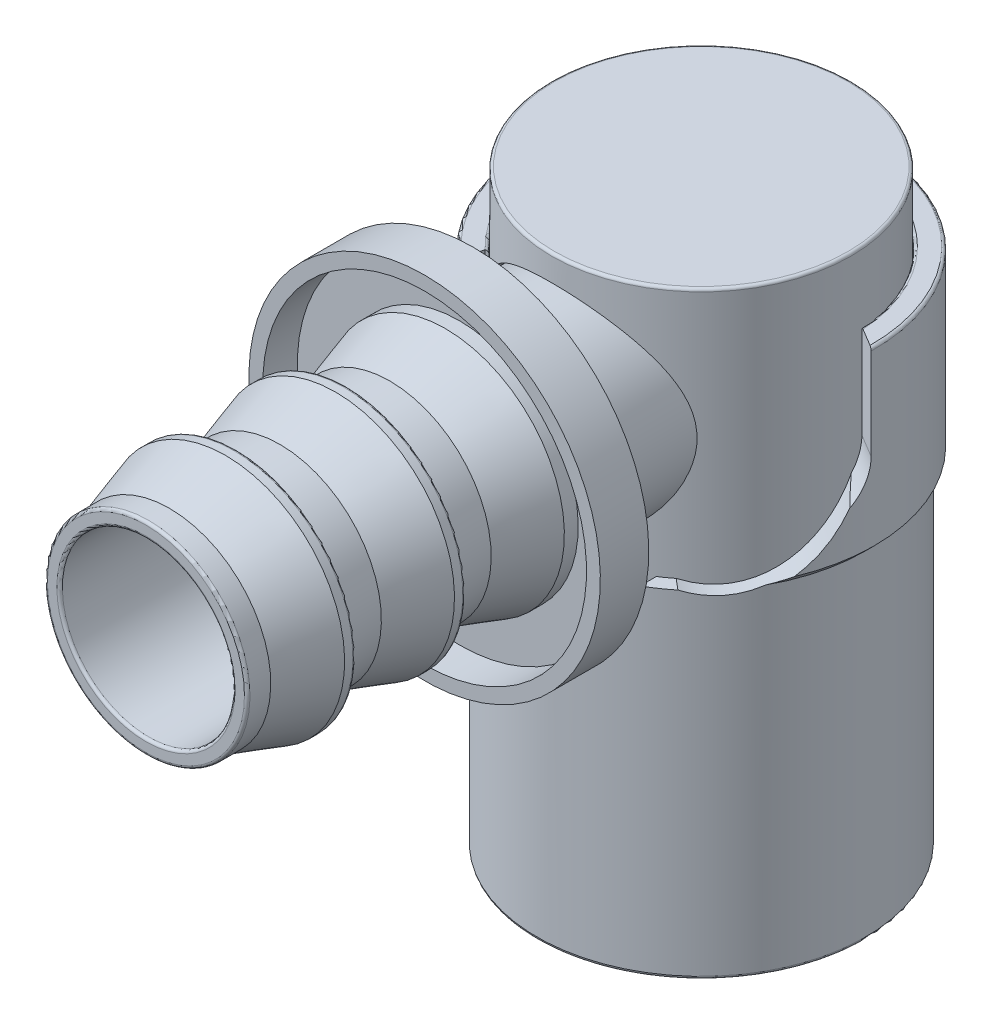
ISO-10303-21;
HEADER;
FILE_DESCRIPTION(('STEP AP214'),'2;1');
FILE_NAME('part.step','',(''),(''),'','','');
FILE_SCHEMA(('AUTOMOTIVE_DESIGN { 1 0 10303 214 1 1 1 1 }'));
ENDSEC;
DATA;
#1=APPLICATION_CONTEXT('core data for automotive mechanical design processes');
#2=APPLICATION_PROTOCOL_DEFINITION('international standard','automotive_design',2000,#1);
#3=PRODUCT_CONTEXT('',#1,'mechanical');
#4=PRODUCT('Part','Part','',(#3));
#5=PRODUCT_RELATED_PRODUCT_CATEGORY('part','',(#4));
#6=PRODUCT_DEFINITION_FORMATION('','',#4);
#7=PRODUCT_DEFINITION_CONTEXT('part definition',#1,'design');
#8=PRODUCT_DEFINITION('design','',#6,#7);
#9=PRODUCT_DEFINITION_SHAPE('','',#8);
#10=(LENGTH_UNIT() NAMED_UNIT(*) SI_UNIT(.MILLI.,.METRE.));
#11=(NAMED_UNIT(*) PLANE_ANGLE_UNIT() SI_UNIT($,.RADIAN.));
#12=(NAMED_UNIT(*) SI_UNIT($,.STERADIAN.) SOLID_ANGLE_UNIT());
#13=UNCERTAINTY_MEASURE_WITH_UNIT(LENGTH_MEASURE(1.E-05),#10,'distance_accuracy_value','');
#14=(GEOMETRIC_REPRESENTATION_CONTEXT(3) GLOBAL_UNCERTAINTY_ASSIGNED_CONTEXT((#13)) GLOBAL_UNIT_ASSIGNED_CONTEXT((#10,
#11,#12)) REPRESENTATION_CONTEXT('',''));
#15=CARTESIAN_POINT('',(0.,0.,0.));
#16=DIRECTION('',(0.,0.,1.));
#17=DIRECTION('',(1.,0.,0.));
#18=AXIS2_PLACEMENT_3D('',#15,#16,#17);
#19=CARTESIAN_POINT('',(0.,25.3574292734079,0.));
#20=DIRECTION('',(0.,1.,0.));
#21=DIRECTION('',(0.,0.,1.));
#22=AXIS2_PLACEMENT_3D('',#19,#20,#21);
#23=CYLINDRICAL_SURFACE('',#22,10.668);
#24=CARTESIAN_POINT('',(0.,17.8816,0.));
#25=DIRECTION('',(0.,1.,0.));
#26=DIRECTION('',(0.,0.,1.));
#27=AXIS2_PLACEMENT_3D('',#24,#25,#26);
#28=CIRCLE('',#27,10.668);
#29=CARTESIAN_POINT('',(0.,17.8816,10.668));
#30=VERTEX_POINT('',#29);
#31=EDGE_CURVE('P0_E10',#30,#30,#28,.T.);
#32=ORIENTED_EDGE('',*,*,#31,.T.);
#33=EDGE_LOOP('',(#32));
#34=FACE_BOUND('',#33,.T.);
#35=CARTESIAN_POINT('',(0.,23.9776,0.));
#36=DIRECTION('',(0.,1.,0.));
#37=DIRECTION('',(0.,0.,1.));
#38=AXIS2_PLACEMENT_3D('',#35,#36,#37);
#39=CIRCLE('',#38,10.668);
#40=CARTESIAN_POINT('',(0.,23.9776,10.668));
#41=VERTEX_POINT('',#40);
#42=EDGE_CURVE('P0_E44',#41,#41,#39,.T.);
#43=ORIENTED_EDGE('',*,*,#42,.F.);
#44=EDGE_LOOP('',(#43));
#45=FACE_BOUND('',#44,.T.);
#46=ADVANCED_FACE('P0_F30',(#34,#45),#23,.T.);
#47=CARTESIAN_POINT('',(0.,17.8816,10.668));
#48=DIRECTION('',(0.,-1.,0.));
#49=DIRECTION('',(0.,0.,-1.));
#50=AXIS2_PLACEMENT_3D('',#47,#48,#49);
#51=PLANE('',#50);
#52=CARTESIAN_POINT('',(0.,17.8816,0.));
#53=DIRECTION('',(0.,1.,0.));
#54=DIRECTION('',(0.,0.,1.));
#55=AXIS2_PLACEMENT_3D('',#52,#53,#54);
#56=CIRCLE('',#55,7.9248);
#57=CARTESIAN_POINT('',(0.,17.8816,7.9248));
#58=VERTEX_POINT('',#57);
#59=EDGE_CURVE('P0_E36',#58,#58,#56,.T.);
#60=ORIENTED_EDGE('',*,*,#59,.T.);
#61=EDGE_LOOP('',(#60));
#62=FACE_BOUND('',#61,.T.);
#63=ORIENTED_EDGE('',*,*,#31,.F.);
#64=EDGE_LOOP('',(#63));
#65=FACE_BOUND('',#64,.T.);
#66=ADVANCED_FACE('P0_F54',(#62,#65),#51,.T.);
#67=CARTESIAN_POINT('',(0.,25.3574292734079,0.));
#68=DIRECTION('',(0.,1.,0.));
#69=DIRECTION('',(0.,0.,1.));
#70=AXIS2_PLACEMENT_3D('',#67,#68,#69);
#71=CYLINDRICAL_SURFACE('',#70,7.9248);
#72=CARTESIAN_POINT('',(0.,23.9776,0.));
#73=DIRECTION('',(0.,1.,0.));
#74=DIRECTION('',(0.,0.,1.));
#75=AXIS2_PLACEMENT_3D('',#72,#73,#74);
#76=CIRCLE('',#75,7.9248);
#77=CARTESIAN_POINT('',(0.,23.9776,7.9248));
#78=VERTEX_POINT('',#77);
#79=EDGE_CURVE('P0_E40',#78,#78,#76,.T.);
#80=ORIENTED_EDGE('',*,*,#79,.T.);
#81=EDGE_LOOP('',(#80));
#82=FACE_BOUND('',#81,.T.);
#83=ORIENTED_EDGE('',*,*,#59,.F.);
#84=EDGE_LOOP('',(#83));
#85=FACE_BOUND('',#84,.T.);
#86=ADVANCED_FACE('P0_F58',(#82,#85),#71,.F.);
#87=CARTESIAN_POINT('',(0.,23.9776,10.668));
#88=DIRECTION('',(0.,1.,0.));
#89=DIRECTION('',(0.,0.,1.));
#90=AXIS2_PLACEMENT_3D('',#87,#88,#89);
#91=PLANE('',#90);
#92=ORIENTED_EDGE('',*,*,#42,.T.);
#93=EDGE_LOOP('',(#92));
#94=FACE_BOUND('',#93,.T.);
#95=ORIENTED_EDGE('',*,*,#79,.F.);
#96=EDGE_LOOP('',(#95));
#97=FACE_BOUND('',#96,.T.);
#98=ADVANCED_FACE('P0_F50',(#94,#97),#91,.T.);
#99=CLOSED_SHELL('',(#46,#66,#86,#98));
#100=MANIFOLD_SOLID_BREP('P0_B2',#99);
#101=CARTESIAN_POINT('',(0.,41.9183834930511,30.5731657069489));
#102=DIRECTION('',(0.,0.,-1.));
#103=DIRECTION('',(0.,1.,0.));
#104=AXIS2_PLACEMENT_3D('',#101,#102,#103);
#105=CYLINDRICAL_SURFACE('',#104,9.31233391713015);
#106=CARTESIAN_POINT('',(0.,41.9183834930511,32.5543657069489));
#107=DIRECTION('',(0.,0.,-1.));
#108=DIRECTION('',(0.,1.,0.));
#109=AXIS2_PLACEMENT_3D('',#106,#107,#108);
#110=CIRCLE('',#109,9.31233391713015);
#111=CARTESIAN_POINT('',(0.,51.2307174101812,32.5543657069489));
#112=VERTEX_POINT('',#111);
#113=EDGE_CURVE('P1_E19',#112,#112,#110,.F.);
#114=ORIENTED_EDGE('',*,*,#113,.F.);
#115=EDGE_LOOP('',(#114));
#116=FACE_BOUND('',#115,.T.);
#117=CARTESIAN_POINT('',(0.,41.9183834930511,28.5919657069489));
#118=DIRECTION('',(0.,0.,-1.));
#119=DIRECTION('',(0.,1.,0.));
#120=AXIS2_PLACEMENT_3D('',#117,#118,#119);
#121=CIRCLE('',#120,9.31233391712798);
#122=CARTESIAN_POINT('',(0.,51.2307174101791,28.5919657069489));
#123=VERTEX_POINT('',#122);
#124=EDGE_CURVE('P1_E593',#123,#123,#121,.T.);
#125=ORIENTED_EDGE('',*,*,#124,.F.);
#126=EDGE_LOOP('',(#125));
#127=FACE_BOUND('',#126,.T.);
#128=ADVANCED_FACE('P1_F16',(#116,#127),#105,.T.);
#129=CARTESIAN_POINT('',(0.,51.2307174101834,32.5543657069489));
#130=DIRECTION('',(0.,0.,-1.));
#131=DIRECTION('',(0.,1.,0.));
#132=AXIS2_PLACEMENT_3D('',#129,#130,#131);
#133=PLANE('',#132);
#134=ORIENTED_EDGE('',*,*,#113,.T.);
#135=EDGE_LOOP('',(#134));
#136=FACE_BOUND('',#135,.T.);
#137=CARTESIAN_POINT('',(0.,41.9183834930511,32.5543657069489));
#138=DIRECTION('',(0.,0.,1.));
#139=DIRECTION('',(0.,1.,0.));
#140=AXIS2_PLACEMENT_3D('',#137,#138,#139);
#141=CIRCLE('',#140,10.668);
#142=CARTESIAN_POINT('',(0.,52.5863834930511,32.5543657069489));
#143=VERTEX_POINT('',#142);
#144=CARTESIAN_POINT('',(0.,31.2503834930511,32.5543657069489));
#145=VERTEX_POINT('',#144);
#146=EDGE_CURVE('P1_E555',#143,#145,#141,.T.);
#147=ORIENTED_EDGE('',*,*,#146,.F.);
#148=CARTESIAN_POINT('',(0.,41.9183834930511,32.5543657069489));
#149=DIRECTION('',(0.,0.,1.));
#150=DIRECTION('',(0.,-1.,0.));
#151=AXIS2_PLACEMENT_3D('',#148,#149,#150);
#152=CIRCLE('',#151,10.668);
#153=EDGE_CURVE('P1_E590',#145,#143,#152,.T.);
#154=ORIENTED_EDGE('',*,*,#153,.F.);
#155=EDGE_LOOP('',(#147,#154));
#156=FACE_BOUND('',#155,.T.);
#157=ADVANCED_FACE('P1_F594',(#136,#156),#133,.T.);
#158=CARTESIAN_POINT('',(0.,41.9183834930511,23.4865657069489));
#159=DIRECTION('',(0.,0.,-1.));
#160=DIRECTION('',(0.,1.,0.));
#161=AXIS2_PLACEMENT_3D('',#158,#159,#160);
#162=CONICAL_SURFACE('',#161,10.9219999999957,0.305421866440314);
#163=ORIENTED_EDGE('',*,*,#124,.T.);
#164=EDGE_LOOP('',(#163));
#165=FACE_BOUND('',#164,.T.);
#166=CARTESIAN_POINT('',(0.,41.9183834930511,23.4865657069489));
#167=DIRECTION('',(0.,0.,-1.));
#168=DIRECTION('',(0.,1.,0.));
#169=AXIS2_PLACEMENT_3D('',#166,#167,#168);
#170=CIRCLE('',#169,10.9219999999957);
#171=CARTESIAN_POINT('',(0.,52.8403834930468,23.4865657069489));
#172=VERTEX_POINT('',#171);
#173=EDGE_CURVE('P1_E545',#172,#172,#170,.T.);
#174=ORIENTED_EDGE('',*,*,#173,.F.);
#175=EDGE_LOOP('',(#174));
#176=FACE_BOUND('',#175,.T.);
#177=ADVANCED_FACE('P1_F569',(#165,#176),#162,.T.);
#178=CARTESIAN_POINT('',(0.,41.9183834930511,32.8083657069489));
#179=DIRECTION('',(0.,0.,-1.));
#180=DIRECTION('',(0.,1.,0.));
#181=AXIS2_PLACEMENT_3D('',#178,#179,#180);
#182=TOROIDAL_SURFACE('',#181,10.668,0.254);
#183=CARTESIAN_POINT('',(0.,41.9183834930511,32.8083657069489));
#184=DIRECTION('',(0.,0.,-1.));
#185=DIRECTION('',(0.,1.,0.));
#186=AXIS2_PLACEMENT_3D('',#183,#184,#185);
#187=CIRCLE('',#186,10.922);
#188=CARTESIAN_POINT('',(0.,52.8403834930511,32.8083657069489));
#189=VERTEX_POINT('',#188);
#190=EDGE_CURVE('P1_E541',#189,#189,#187,.F.);
#191=ORIENTED_EDGE('',*,*,#190,.F.);
#192=EDGE_LOOP('',(#191));
#193=FACE_BOUND('',#192,.T.);
#194=ORIENTED_EDGE('',*,*,#146,.T.);
#195=ORIENTED_EDGE('',*,*,#153,.T.);
#196=EDGE_LOOP('',(#194,#195));
#197=FACE_BOUND('',#196,.T.);
#198=ADVANCED_FACE('P1_F563',(#193,#197),#182,.T.);
#199=CARTESIAN_POINT('',(0.,41.9183834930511,22.7245657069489));
#200=DIRECTION('',(0.,0.,-1.));
#201=DIRECTION('',(0.,1.,0.));
#202=AXIS2_PLACEMENT_3D('',#199,#200,#201);
#203=CYLINDRICAL_SURFACE('',#202,10.9219999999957);
#204=ORIENTED_EDGE('',*,*,#173,.T.);
#205=EDGE_LOOP('',(#204));
#206=FACE_BOUND('',#205,.T.);
#207=CARTESIAN_POINT('',(0.,41.9183834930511,21.9625657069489));
#208=DIRECTION('',(0.,0.,-1.));
#209=DIRECTION('',(0.,1.,0.));
#210=AXIS2_PLACEMENT_3D('',#207,#208,#209);
#211=CIRCLE('',#210,10.9219999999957);
#212=CARTESIAN_POINT('',(0.,52.8403834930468,21.9625657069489));
#213=VERTEX_POINT('',#212);
#214=EDGE_CURVE('P1_E544',#213,#213,#211,.T.);
#215=ORIENTED_EDGE('',*,*,#214,.F.);
#216=EDGE_LOOP('',(#215));
#217=FACE_BOUND('',#216,.T.);
#218=ADVANCED_FACE('P1_F568',(#206,#217),#203,.T.);
#219=CARTESIAN_POINT('',(0.,41.9183834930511,33.0623657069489));
#220=DIRECTION('',(0.,0.,-1.));
#221=DIRECTION('',(0.,1.,0.));
#222=AXIS2_PLACEMENT_3D('',#219,#220,#221);
#223=CYLINDRICAL_SURFACE('',#222,10.922);
#224=CARTESIAN_POINT('',(0.,41.9183834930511,33.5703657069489));
#225=DIRECTION('',(0.,0.,-1.));
#226=DIRECTION('',(0.,1.,0.));
#227=AXIS2_PLACEMENT_3D('',#224,#225,#226);
#228=CIRCLE('',#227,10.922);
#229=CARTESIAN_POINT('',(0.,52.8403834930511,33.5703657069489));
#230=VERTEX_POINT('',#229);
#231=EDGE_CURVE('P1_E548',#230,#230,#228,.F.);
#232=ORIENTED_EDGE('',*,*,#231,.F.);
#233=EDGE_LOOP('',(#232));
#234=FACE_BOUND('',#233,.T.);
#235=ORIENTED_EDGE('',*,*,#190,.T.);
#236=EDGE_LOOP('',(#235));
#237=FACE_BOUND('',#236,.T.);
#238=ADVANCED_FACE('P1_F898',(#234,#237),#223,.T.);
#239=CARTESIAN_POINT('',(0.,52.3831072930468,21.9625657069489));
#240=DIRECTION('',(0.,0.,-1.));
#241=DIRECTION('',(0.,1.,0.));
#242=AXIS2_PLACEMENT_3D('',#239,#240,#241);
#243=PLANE('',#242);
#244=CARTESIAN_POINT('',(0.,41.9183834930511,21.9625657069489));
#245=DIRECTION('',(0.,0.,-1.));
#246=DIRECTION('',(0.,1.,0.));
#247=AXIS2_PLACEMENT_3D('',#244,#245,#246);
#248=CIRCLE('',#247,10.4647237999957);
#249=CARTESIAN_POINT('',(0.,52.3831072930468,21.9625657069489));
#250=VERTEX_POINT('',#249);
#251=EDGE_CURVE('P1_E538',#250,#250,#248,.T.);
#252=ORIENTED_EDGE('',*,*,#251,.F.);
#253=EDGE_LOOP('',(#252));
#254=FACE_BOUND('',#253,.T.);
#255=ORIENTED_EDGE('',*,*,#214,.T.);
#256=EDGE_LOOP('',(#255));
#257=FACE_BOUND('',#256,.T.);
#258=ADVANCED_FACE('P1_F888',(#254,#257),#243,.T.);
#259=CARTESIAN_POINT('',(0.,41.9183834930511,33.5703657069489));
#260=DIRECTION('',(0.,0.,-1.));
#261=DIRECTION('',(1.,0.,0.));
#262=AXIS2_PLACEMENT_3D('',#259,#260,#261);
#263=CONICAL_SURFACE('',#262,10.922,0.305421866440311);
#264=CARTESIAN_POINT('',(0.,41.9183834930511,38.6757657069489));
#265=DIRECTION('',(0.,0.,-1.));
#266=DIRECTION('',(0.,1.,0.));
#267=AXIS2_PLACEMENT_3D('',#264,#265,#266);
#268=CIRCLE('',#267,9.31233391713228);
#269=CARTESIAN_POINT('',(0.,51.2307174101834,38.6757657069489));
#270=VERTEX_POINT('',#269);
#271=EDGE_CURVE('P1_E529',#270,#270,#268,.F.);
#272=ORIENTED_EDGE('',*,*,#271,.F.);
#273=EDGE_LOOP('',(#272));
#274=FACE_BOUND('',#273,.T.);
#275=ORIENTED_EDGE('',*,*,#231,.T.);
#276=EDGE_LOOP('',(#275));
#277=FACE_BOUND('',#276,.T.);
#278=ADVANCED_FACE('P1_F878',(#274,#277),#263,.T.);
#279=CARTESIAN_POINT('',(0.,41.9183834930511,21.4545657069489));
#280=DIRECTION('',(0.,0.,-1.));
#281=DIRECTION('',(0.,1.,0.));
#282=AXIS2_PLACEMENT_3D('',#279,#280,#281);
#283=CYLINDRICAL_SURFACE('',#282,10.4647237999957);
#284=ORIENTED_EDGE('',*,*,#251,.T.);
#285=EDGE_LOOP('',(#284));
#286=FACE_BOUND('',#285,.T.);
#287=CARTESIAN_POINT('',(0.,41.9183834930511,20.9465657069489));
#288=DIRECTION('',(0.,0.,-1.));
#289=DIRECTION('',(0.,1.,0.));
#290=AXIS2_PLACEMENT_3D('',#287,#288,#289);
#291=CIRCLE('',#290,10.4647237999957);
#292=CARTESIAN_POINT('',(0.,52.3831072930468,20.9465657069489));
#293=VERTEX_POINT('',#292);
#294=EDGE_CURVE('P1_E537',#293,#293,#291,.T.);
#295=ORIENTED_EDGE('',*,*,#294,.F.);
#296=EDGE_LOOP('',(#295));
#297=FACE_BOUND('',#296,.T.);
#298=ADVANCED_FACE('P1_F869',(#286,#297),#283,.T.);
#299=CARTESIAN_POINT('',(0.,41.9183834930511,40.6569657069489));
#300=DIRECTION('',(0.,0.,-1.));
#301=DIRECTION('',(0.,1.,0.));
#302=AXIS2_PLACEMENT_3D('',#299,#300,#301);
#303=CYLINDRICAL_SURFACE('',#302,9.31233391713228);
#304=CARTESIAN_POINT('',(0.,41.9183834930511,42.6381657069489));
#305=DIRECTION('',(0.,0.,-1.));
#306=DIRECTION('',(0.,1.,0.));
#307=AXIS2_PLACEMENT_3D('',#304,#305,#306);
#308=CIRCLE('',#307,9.31233391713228);
#309=CARTESIAN_POINT('',(0.,51.2307174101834,42.6381657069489));
#310=VERTEX_POINT('',#309);
#311=EDGE_CURVE('P1_E479',#310,#310,#308,.F.);
#312=ORIENTED_EDGE('',*,*,#311,.F.);
#313=EDGE_LOOP('',(#312));
#314=FACE_BOUND('',#313,.T.);
#315=ORIENTED_EDGE('',*,*,#271,.T.);
#316=EDGE_LOOP('',(#315));
#317=FACE_BOUND('',#316,.T.);
#318=ADVANCED_FACE('P1_F860',(#314,#317),#303,.T.);
#319=CARTESIAN_POINT('',(0.,53.9833834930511,20.9465657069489));
#320=DIRECTION('',(0.,0.,1.));
#321=DIRECTION('',(0.,-1.,0.));
#322=AXIS2_PLACEMENT_3D('',#319,#320,#321);
#323=PLANE('',#322);
#324=ORIENTED_EDGE('',*,*,#294,.T.);
#325=EDGE_LOOP('',(#324));
#326=FACE_BOUND('',#325,.T.);
#327=CARTESIAN_POINT('',(0.,41.9183834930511,20.9465657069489));
#328=DIRECTION('',(0.,0.,-1.));
#329=DIRECTION('',(0.,1.,0.));
#330=AXIS2_PLACEMENT_3D('',#327,#328,#329);
#331=CIRCLE('',#330,10.7451772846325);
#332=CARTESIAN_POINT('',(0.,52.6635607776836,20.9465657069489));
#333=VERTEX_POINT('',#332);
#334=EDGE_CURVE('P1_E143',#333,#333,#331,.T.);
#335=ORIENTED_EDGE('',*,*,#334,.F.);
#336=EDGE_LOOP('',(#335));
#337=FACE_BOUND('',#336,.T.);
#338=ADVANCED_FACE('P1_F503',(#326,#337),#323,.T.);
#339=CARTESIAN_POINT('',(0.,51.2307174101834,42.6381657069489));
#340=DIRECTION('',(0.,0.,-1.));
#341=DIRECTION('',(0.,1.,0.));
#342=AXIS2_PLACEMENT_3D('',#339,#340,#341);
#343=PLANE('',#342);
#344=ORIENTED_EDGE('',*,*,#311,.T.);
#345=EDGE_LOOP('',(#344));
#346=FACE_BOUND('',#345,.T.);
#347=CARTESIAN_POINT('',(0.,41.9183834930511,42.6381657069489));
#348=DIRECTION('',(0.,0.,1.));
#349=DIRECTION('',(0.,1.,0.));
#350=AXIS2_PLACEMENT_3D('',#347,#348,#349);
#351=CIRCLE('',#350,10.668);
#352=CARTESIAN_POINT('',(0.,52.5863834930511,42.6381657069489));
#353=VERTEX_POINT('',#352);
#354=CARTESIAN_POINT('',(0.,31.2503834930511,42.6381657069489));
#355=VERTEX_POINT('',#354);
#356=EDGE_CURVE('P1_E153',#353,#355,#351,.T.);
#357=ORIENTED_EDGE('',*,*,#356,.F.);
#358=CARTESIAN_POINT('',(0.,41.9183834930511,42.6381657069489));
#359=DIRECTION('',(0.,0.,1.));
#360=DIRECTION('',(0.,-1.,0.));
#361=AXIS2_PLACEMENT_3D('',#358,#359,#360);
#362=CIRCLE('',#361,10.668);
#363=EDGE_CURVE('P1_E142',#355,#353,#362,.T.);
#364=ORIENTED_EDGE('',*,*,#363,.F.);
#365=EDGE_LOOP('',(#357,#364));
#366=FACE_BOUND('',#365,.T.);
#367=ADVANCED_FACE('P1_F494',(#346,#366),#343,.T.);
#368=CARTESIAN_POINT('',(0.,41.9183834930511,19.1685657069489));
#369=DIRECTION('',(0.,0.,-1.));
#370=DIRECTION('',(0.,1.,0.));
#371=AXIS2_PLACEMENT_3D('',#368,#369,#370);
#372=CYLINDRICAL_SURFACE('',#371,12.065);
#373=CARTESIAN_POINT('',(0.,41.9183834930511,20.1845657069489));
#374=DIRECTION('',(0.,0.,-1.));
#375=DIRECTION('',(0.,-1.,0.));
#376=AXIS2_PLACEMENT_3D('',#373,#374,#375);
#377=CIRCLE('',#376,12.065);
#378=CARTESIAN_POINT('',(1.48716821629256,53.8913762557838,20.1845657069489));
#379=VERTEX_POINT('',#378);
#380=CARTESIAN_POINT('',(-1.48716821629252,53.8913762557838,20.1845657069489));
#381=VERTEX_POINT('',#380);
#382=EDGE_CURVE('P1_E133',#379,#381,#377,.F.);
#383=ORIENTED_EDGE('',*,*,#382,.F.);
#384=DIRECTION('',(0.,0.,1.));
#385=VECTOR('',#384,1.);
#386=CARTESIAN_POINT('',(1.48716821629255,53.8913762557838,8.11956570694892));
#387=LINE('',#386,#385);
#388=CARTESIAN_POINT('',(1.48716821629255,53.8913762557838,18.1238005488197));
#389=VERTEX_POINT('',#388);
#390=EDGE_CURVE('P1_E135',#379,#389,#387,.F.);
#391=ORIENTED_EDGE('',*,*,#390,.T.);
#392=CARTESIAN_POINT('',(0.,41.9183834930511,18.1238005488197));
#393=DIRECTION('',(0.,0.,-1.));
#394=DIRECTION('',(0.,1.,0.));
#395=AXIS2_PLACEMENT_3D('',#392,#393,#394);
#396=CIRCLE('',#395,12.065);
#397=CARTESIAN_POINT('',(-1.48716821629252,53.8913762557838,18.1238005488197));
#398=VERTEX_POINT('',#397);
#399=EDGE_CURVE('P1_E477',#389,#398,#396,.F.);
#400=ORIENTED_EDGE('',*,*,#399,.T.);
#401=DIRECTION('',(0.,0.,1.));
#402=VECTOR('',#401,1.);
#403=CARTESIAN_POINT('',(-1.48716821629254,53.8913762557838,8.11956570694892));
#404=LINE('',#403,#402);
#405=EDGE_CURVE('P1_E138',#398,#381,#404,.T.);
#406=ORIENTED_EDGE('',*,*,#405,.T.);
#407=EDGE_LOOP('',(#383,#391,#400,#406));
#408=FACE_BOUND('',#407,.T.);
#409=ADVANCED_FACE('P1_F134',(#408),#372,.T.);
#410=CARTESIAN_POINT('',(0.,41.9183834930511,20.1845657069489));
#411=DIRECTION('',(0.,0.,-1.));
#412=DIRECTION('',(0.,1.,0.));
#413=AXIS2_PLACEMENT_3D('',#410,#411,#412);
#414=CONICAL_SURFACE('',#413,12.065,1.0471975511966);
#415=ORIENTED_EDGE('',*,*,#334,.T.);
#416=EDGE_LOOP('',(#415));
#417=FACE_BOUND('',#416,.T.);
#418=CARTESIAN_POINT('',(-1.48716821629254,53.8913762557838,20.1845657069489));
#419=CARTESIAN_POINT('',(-1.72029594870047,53.7567798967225,20.2451024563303));
#420=CARTESIAN_POINT('',(-1.95427114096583,53.6216942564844,20.3014264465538));
#421=CARTESIAN_POINT('',(-2.42381592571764,53.3506024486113,20.4048007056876));
#422=CARTESIAN_POINT('',(-2.65938594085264,53.2145960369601,20.4518484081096));
#423=CARTESIAN_POINT('',(-3.13208815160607,52.9416812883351,20.5358225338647));
#424=CARTESIAN_POINT('',(-3.3692214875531,52.8047722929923,20.5727404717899));
#425=CARTESIAN_POINT('',(-3.84455608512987,52.5303377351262,20.635649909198));
#426=CARTESIAN_POINT('',(-4.08275724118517,52.3928122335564,20.6616424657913));
#427=CARTESIAN_POINT('',(-4.55561917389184,52.1198052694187,20.7017652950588));
#428=CARTESIAN_POINT('',(-4.79026687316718,51.9843313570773,20.7160998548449));
#429=CARTESIAN_POINT('',(-5.25987613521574,51.7132023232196,20.7333531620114));
#430=CARTESIAN_POINT('',(-5.49483769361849,51.5775472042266,20.7362720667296));
#431=CARTESIAN_POINT('',(-5.96450378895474,51.306385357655,20.7306283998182));
#432=CARTESIAN_POINT('',(-6.19920839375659,51.1708785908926,20.722073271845));
#433=CARTESIAN_POINT('',(-6.66808438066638,50.9001729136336,20.6936924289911));
#434=CARTESIAN_POINT('',(-6.90225580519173,50.7649739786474,20.6738676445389));
#435=CARTESIAN_POINT('',(-7.34449869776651,50.5096449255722,20.6261120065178));
#436=CARTESIAN_POINT('',(-7.55266081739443,50.3894624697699,20.5992862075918));
#437=CARTESIAN_POINT('',(-7.96806267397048,50.1496300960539,20.5374610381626));
#438=CARTESIAN_POINT('',(-8.17530244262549,50.0299801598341,20.5024619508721));
#439=CARTESIAN_POINT('',(-8.59040838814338,49.7903186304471,20.4244963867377));
#440=CARTESIAN_POINT('',(-8.7982655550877,49.6703122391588,20.381466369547));
#441=CARTESIAN_POINT('',(-9.212744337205,49.43101280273,20.2882404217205));
#442=CARTESIAN_POINT('',(-9.41936611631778,49.3117196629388,20.2380454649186));
#443=CARTESIAN_POINT('',(-9.62533178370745,49.1928053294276,20.1845657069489));
#444=B_SPLINE_CURVE_WITH_KNOTS('',3,(#418,#419,#420,#421,#422,#423,#424,#425,#426,#427,#428,
#429,#430,#431,#432,#433,#434,#435,#436,#437,#438,#439,#440,#441,#442,#443),.UNSPECIFIED.,.F.,
.F.,(4,2,2,2,2,2,2,2,2,2,2,2,4),(0.,0.827758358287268,1.65574541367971,2.48442394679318,
3.31302228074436,4.12676744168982,4.94050138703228,5.75370768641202,6.56684685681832,
7.29227447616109,8.01767696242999,8.74908282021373,9.48038936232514),.UNSPECIFIED.);
#445=CARTESIAN_POINT('',(-9.62533178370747,49.1928053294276,20.1845657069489));
#446=VERTEX_POINT('',#445);
#447=EDGE_CURVE('P1_E187',#381,#446,#444,.T.);
#448=ORIENTED_EDGE('',*,*,#447,.T.);
#449=CARTESIAN_POINT('',(0.,41.9183834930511,20.1845657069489));
#450=DIRECTION('',(0.,0.,-1.));
#451=DIRECTION('',(0.,1.,0.));
#452=AXIS2_PLACEMENT_3D('',#449,#450,#451);
#453=CIRCLE('',#452,12.065);
#454=CARTESIAN_POINT('',(-11.1125,46.6169544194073,20.1845657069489));
#455=VERTEX_POINT('',#454);
#456=EDGE_CURVE('P1_E440',#455,#446,#453,.T.);
#457=ORIENTED_EDGE('',*,*,#456,.F.);
#458=CARTESIAN_POINT('',(-11.1125,46.6169544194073,20.1845657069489));
#459=CARTESIAN_POINT('',(-11.1125,46.3477617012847,20.2451024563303));
#460=CARTESIAN_POINT('',(-11.1125,46.0775904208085,20.3014264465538));
#461=CARTESIAN_POINT('',(-11.1125,45.5354068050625,20.4048007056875));
#462=CARTESIAN_POINT('',(-11.1125,45.2633939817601,20.4518484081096));
#463=CARTESIAN_POINT('',(-11.1125,44.71756448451,20.5358225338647));
#464=CARTESIAN_POINT('',(-11.1125,44.4437464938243,20.5727404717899));
#465=CARTESIAN_POINT('',(-11.1125,43.8948773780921,20.635649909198));
#466=CARTESIAN_POINT('',(-11.1125,43.6198263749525,20.6616424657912));
#467=CARTESIAN_POINT('',(-11.1125,43.0738124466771,20.7017652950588));
#468=CARTESIAN_POINT('',(-11.1125,42.8028646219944,20.7160998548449));
#469=CARTESIAN_POINT('',(-11.1125,42.260606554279,20.7333531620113));
#470=CARTESIAN_POINT('',(-11.1125,41.9892963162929,20.7362720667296));
#471=CARTESIAN_POINT('',(-11.1125,41.4469726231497,20.7306283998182));
#472=CARTESIAN_POINT('',(-11.1125,41.1759590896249,20.722073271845));
#473=CARTESIAN_POINT('',(-11.1125,40.6345477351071,20.6936924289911));
#474=CARTESIAN_POINT('',(-11.1125,40.3641498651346,20.6738676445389));
#475=CARTESIAN_POINT('',(-11.1125,39.8534917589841,20.6261120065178));
#476=CARTESIAN_POINT('',(-11.1125,39.6131268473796,20.5992862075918));
#477=CARTESIAN_POINT('',(-11.1125,39.1334620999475,20.5374610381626));
#478=CARTESIAN_POINT('',(-11.1125,38.8941622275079,20.5024619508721));
#479=CARTESIAN_POINT('',(-11.1125,38.414839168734,20.4244963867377));
#480=CARTESIAN_POINT('',(-11.1125,38.1748263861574,20.381466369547));
#481=CARTESIAN_POINT('',(-11.1125,37.6962275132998,20.2882404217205));
#482=CARTESIAN_POINT('',(-11.1125,37.4576412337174,20.2380454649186));
#483=CARTESIAN_POINT('',(-11.1125,37.2198125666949,20.1845657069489));
#484=B_SPLINE_CURVE_WITH_KNOTS('',3,(#458,#459,#460,#461,#462,#463,#464,#465,#466,#467,#468,
#469,#470,#471,#472,#473,#474,#475,#476,#477,#478,#479,#480,#481,#482,#483),.UNSPECIFIED.,.F.,
.F.,(4,2,2,2,2,2,2,2,2,2,2,2,4),(0.,0.82775835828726,1.65574541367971,2.48442394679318,
3.31302228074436,4.12676744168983,4.94050138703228,5.75370768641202,6.56684685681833,
7.29227447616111,8.01767696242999,8.74908282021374,9.48038936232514),.UNSPECIFIED.);
#485=CARTESIAN_POINT('',(-11.1125,37.2198125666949,20.1845657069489));
#486=VERTEX_POINT('',#485);
#487=EDGE_CURVE('P1_E196',#455,#486,#484,.T.);
#488=ORIENTED_EDGE('',*,*,#487,.T.);
#489=CARTESIAN_POINT('',(0.,41.9183834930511,20.1845657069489));
#490=DIRECTION('',(0.,0.,-1.));
#491=DIRECTION('',(0.,1.,0.));
#492=AXIS2_PLACEMENT_3D('',#489,#490,#491);
#493=CIRCLE('',#492,12.065);
#494=CARTESIAN_POINT('',(-9.62533178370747,34.6439616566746,20.1845657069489));
#495=VERTEX_POINT('',#494);
#496=EDGE_CURVE('P1_E452',#495,#486,#493,.T.);
#497=ORIENTED_EDGE('',*,*,#496,.F.);
#498=CARTESIAN_POINT('',(-9.62533178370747,34.6439616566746,20.1845657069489));
#499=CARTESIAN_POINT('',(-9.39220405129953,34.5093652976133,20.2451024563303));
#500=CARTESIAN_POINT('',(-9.15822885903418,34.3742796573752,20.3014264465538));
#501=CARTESIAN_POINT('',(-8.68868407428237,34.1031878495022,20.4048007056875));
#502=CARTESIAN_POINT('',(-8.45311405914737,33.967181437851,20.4518484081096));
#503=CARTESIAN_POINT('',(-7.98041184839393,33.694266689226,20.5358225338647));
#504=CARTESIAN_POINT('',(-7.7432785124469,33.5573576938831,20.5727404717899));
#505=CARTESIAN_POINT('',(-7.26794391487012,33.282923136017,20.635649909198));
#506=CARTESIAN_POINT('',(-7.02974275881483,33.1453976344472,20.6616424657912));
#507=CARTESIAN_POINT('',(-6.55688082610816,32.8723906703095,20.7017652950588));
#508=CARTESIAN_POINT('',(-6.32223312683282,32.7369167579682,20.7160998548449));
#509=CARTESIAN_POINT('',(-5.85262386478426,32.4657877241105,20.7333531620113));
#510=CARTESIAN_POINT('',(-5.61766230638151,32.3301326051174,20.7362720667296));
#511=CARTESIAN_POINT('',(-5.14799621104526,32.0589707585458,20.7306283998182));
#512=CARTESIAN_POINT('',(-4.91329160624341,31.9234639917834,20.722073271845));
#513=CARTESIAN_POINT('',(-4.44441561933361,31.6527583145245,20.6936924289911));
#514=CARTESIAN_POINT('',(-4.21024419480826,31.5175593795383,20.6738676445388));
#515=CARTESIAN_POINT('',(-3.76800130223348,31.262230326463,20.6261120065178));
#516=CARTESIAN_POINT('',(-3.55983918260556,31.1420478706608,20.5992862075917));
#517=CARTESIAN_POINT('',(-3.14443732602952,30.9022154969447,20.5374610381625));
#518=CARTESIAN_POINT('',(-2.93719755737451,30.7825655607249,20.5024619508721));
#519=CARTESIAN_POINT('',(-2.52209161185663,30.542904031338,20.4244963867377));
#520=CARTESIAN_POINT('',(-2.31423444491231,30.4228976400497,20.381466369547));
#521=CARTESIAN_POINT('',(-1.89975566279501,30.1835982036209,20.2882404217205));
#522=CARTESIAN_POINT('',(-1.69313388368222,30.0643050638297,20.2380454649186));
#523=CARTESIAN_POINT('',(-1.48716821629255,29.9453907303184,20.1845657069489));
#524=B_SPLINE_CURVE_WITH_KNOTS('',3,(#498,#499,#500,#501,#502,#503,#504,#505,#506,#507,#508,
#509,#510,#511,#512,#513,#514,#515,#516,#517,#518,#519,#520,#521,#522,#523),.UNSPECIFIED.,.F.,
.F.,(4,2,2,2,2,2,2,2,2,2,2,2,4),(0.,0.827758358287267,1.65574541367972,2.48442394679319,
3.31302228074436,4.12676744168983,4.94050138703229,5.75370768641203,6.56684685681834,
7.2922744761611,8.01767696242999,8.74908282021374,9.48038936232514),.UNSPECIFIED.);
#525=CARTESIAN_POINT('',(-1.48716821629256,29.9453907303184,20.1845657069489));
#526=VERTEX_POINT('',#525);
#527=EDGE_CURVE('P1_E203',#495,#526,#524,.T.);
#528=ORIENTED_EDGE('',*,*,#527,.T.);
#529=CARTESIAN_POINT('',(0.,41.9183834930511,20.1845657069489));
#530=DIRECTION('',(0.,0.,-1.));
#531=DIRECTION('',(0.,1.,0.));
#532=AXIS2_PLACEMENT_3D('',#529,#530,#531);
#533=CIRCLE('',#532,12.065);
#534=CARTESIAN_POINT('',(1.48716821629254,29.9453907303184,20.1845657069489));
#535=VERTEX_POINT('',#534);
#536=EDGE_CURVE('P1_E460',#535,#526,#533,.T.);
#537=ORIENTED_EDGE('',*,*,#536,.F.);
#538=CARTESIAN_POINT('',(1.48716821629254,29.9453907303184,20.1845657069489));
#539=CARTESIAN_POINT('',(1.72029594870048,30.0799870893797,20.2451024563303));
#540=CARTESIAN_POINT('',(1.95427114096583,30.2150727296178,20.3014264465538));
#541=CARTESIAN_POINT('',(2.42381592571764,30.4861645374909,20.4048007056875));
#542=CARTESIAN_POINT('',(2.65938594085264,30.622170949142,20.4518484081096));
#543=CARTESIAN_POINT('',(3.13208815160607,30.8950856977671,20.5358225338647));
#544=CARTESIAN_POINT('',(3.3692214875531,31.0319946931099,20.5727404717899));
#545=CARTESIAN_POINT('',(3.84455608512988,31.306429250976,20.635649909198));
#546=CARTESIAN_POINT('',(4.08275724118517,31.4439547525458,20.6616424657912));
#547=CARTESIAN_POINT('',(4.55561917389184,31.7169617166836,20.7017652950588));
#548=CARTESIAN_POINT('',(4.79026687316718,31.8524356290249,20.7160998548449));
#549=CARTESIAN_POINT('',(5.25987613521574,32.1235646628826,20.7333531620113));
#550=CARTESIAN_POINT('',(5.49483769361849,32.2592197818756,20.7362720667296));
#551=CARTESIAN_POINT('',(5.96450378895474,32.5303816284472,20.7306283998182));
#552=CARTESIAN_POINT('',(6.19920839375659,32.6658883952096,20.722073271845));
#553=CARTESIAN_POINT('',(6.66808438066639,32.9365940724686,20.6936924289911));
#554=CARTESIAN_POINT('',(6.90225580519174,33.0717930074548,20.6738676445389));
#555=CARTESIAN_POINT('',(7.34449869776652,33.32712206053,20.6261120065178));
#556=CARTESIAN_POINT('',(7.55266081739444,33.4473045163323,20.5992862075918));
#557=CARTESIAN_POINT('',(7.96806267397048,33.6871368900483,20.5374610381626));
#558=CARTESIAN_POINT('',(8.17530244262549,33.8067868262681,20.5024619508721));
#559=CARTESIAN_POINT('',(8.59040838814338,34.0464483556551,20.4244963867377));
#560=CARTESIAN_POINT('',(8.7982655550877,34.1664547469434,20.381466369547));
#561=CARTESIAN_POINT('',(9.212744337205,34.4057541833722,20.2882404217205));
#562=CARTESIAN_POINT('',(9.41936611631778,34.5250473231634,20.2380454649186));
#563=CARTESIAN_POINT('',(9.62533178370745,34.6439616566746,20.1845657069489));
#564=B_SPLINE_CURVE_WITH_KNOTS('',3,(#538,#539,#540,#541,#542,#543,#544,#545,#546,#547,#548,
#549,#550,#551,#552,#553,#554,#555,#556,#557,#558,#559,#560,#561,#562,#563),.UNSPECIFIED.,.F.,
.F.,(4,2,2,2,2,2,2,2,2,2,2,2,4),(0.,0.827758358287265,1.65574541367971,2.48442394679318,
3.31302228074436,4.12676744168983,4.94050138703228,5.75370768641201,6.56684685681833,
7.2922744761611,8.01767696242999,8.74908282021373,9.48038936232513),.UNSPECIFIED.);
#565=CARTESIAN_POINT('',(9.62533178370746,34.6439616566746,20.1845657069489));
#566=VERTEX_POINT('',#565);
#567=EDGE_CURVE('P1_E209',#535,#566,#564,.T.);
#568=ORIENTED_EDGE('',*,*,#567,.T.);
#569=CARTESIAN_POINT('',(0.,41.9183834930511,20.1845657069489));
#570=DIRECTION('',(0.,0.,-1.));
#571=DIRECTION('',(0.,1.,0.));
#572=AXIS2_PLACEMENT_3D('',#569,#570,#571);
#573=CIRCLE('',#572,12.065);
#574=CARTESIAN_POINT('',(11.1125,37.2198125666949,20.1845657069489));
#575=VERTEX_POINT('',#574);
#576=EDGE_CURVE('P1_E217',#575,#566,#573,.T.);
#577=ORIENTED_EDGE('',*,*,#576,.F.);
#578=CARTESIAN_POINT('',(11.1125,37.2198125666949,20.1845657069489));
#579=CARTESIAN_POINT('',(11.1125,37.4890052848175,20.2451024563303));
#580=CARTESIAN_POINT('',(11.1125,37.7591765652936,20.3014264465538));
#581=CARTESIAN_POINT('',(11.1125,38.3013601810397,20.4048007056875));
#582=CARTESIAN_POINT('',(11.1125,38.5733730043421,20.4518484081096));
#583=CARTESIAN_POINT('',(11.1125,39.1192025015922,20.5358225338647));
#584=CARTESIAN_POINT('',(11.1125,39.3930204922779,20.5727404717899));
#585=CARTESIAN_POINT('',(11.1125,39.9418896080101,20.635649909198));
#586=CARTESIAN_POINT('',(11.1125,40.2169406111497,20.6616424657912));
#587=CARTESIAN_POINT('',(11.1125,40.7629545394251,20.7017652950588));
#588=CARTESIAN_POINT('',(11.1125,41.0339023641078,20.7160998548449));
#589=CARTESIAN_POINT('',(11.1125,41.5761604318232,20.7333531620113));
#590=CARTESIAN_POINT('',(11.1125,41.8474706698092,20.7362720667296));
#591=CARTESIAN_POINT('',(11.1125,42.3897943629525,20.7306283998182));
#592=CARTESIAN_POINT('',(11.1125,42.6608078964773,20.722073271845));
#593=CARTESIAN_POINT('',(11.1125,43.2022192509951,20.6936924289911));
#594=CARTESIAN_POINT('',(11.1125,43.4726171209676,20.6738676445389));
#595=CARTESIAN_POINT('',(11.1125,43.9832752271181,20.6261120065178));
#596=CARTESIAN_POINT('',(11.1125,44.2236401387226,20.5992862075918));
#597=CARTESIAN_POINT('',(11.1125,44.7033048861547,20.5374610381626));
#598=CARTESIAN_POINT('',(11.1125,44.9426047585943,20.5024619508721));
#599=CARTESIAN_POINT('',(11.1125,45.4219278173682,20.4244963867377));
#600=CARTESIAN_POINT('',(11.1125,45.6619405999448,20.381466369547));
#601=CARTESIAN_POINT('',(11.1125,46.1405394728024,20.2882404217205));
#602=CARTESIAN_POINT('',(11.1125,46.3791257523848,20.2380454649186));
#603=CARTESIAN_POINT('',(11.1125,46.6169544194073,20.1845657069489));
#604=B_SPLINE_CURVE_WITH_KNOTS('',3,(#578,#579,#580,#581,#582,#583,#584,#585,#586,#587,#588,
#589,#590,#591,#592,#593,#594,#595,#596,#597,#598,#599,#600,#601,#602,#603),.UNSPECIFIED.,.F.,
.F.,(4,2,2,2,2,2,2,2,2,2,2,2,4),(0.,0.82775835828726,1.65574541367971,2.48442394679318,
3.31302228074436,4.12676744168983,4.94050138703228,5.75370768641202,6.56684685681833,
7.29227447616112,8.01767696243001,8.74908282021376,9.48038936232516),.UNSPECIFIED.);
#605=CARTESIAN_POINT('',(11.1125,46.6169544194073,20.1845657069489));
#606=VERTEX_POINT('',#605);
#607=EDGE_CURVE('P1_E163',#575,#606,#604,.T.);
#608=ORIENTED_EDGE('',*,*,#607,.T.);
#609=CARTESIAN_POINT('',(0.,41.9183834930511,20.1845657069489));
#610=DIRECTION('',(0.,0.,-1.));
#611=DIRECTION('',(0.,1.,0.));
#612=AXIS2_PLACEMENT_3D('',#609,#610,#611);
#613=CIRCLE('',#612,12.065);
#614=CARTESIAN_POINT('',(9.62533178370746,49.1928053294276,20.1845657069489));
#615=VERTEX_POINT('',#614);
#616=EDGE_CURVE('P1_E152',#615,#606,#613,.T.);
#617=ORIENTED_EDGE('',*,*,#616,.F.);
#618=CARTESIAN_POINT('',(9.62533178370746,49.1928053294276,20.1845657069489));
#619=CARTESIAN_POINT('',(9.39220405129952,49.3274016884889,20.2451024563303));
#620=CARTESIAN_POINT('',(9.15822885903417,49.462487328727,20.3014264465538));
#621=CARTESIAN_POINT('',(8.68868407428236,49.7335791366,20.4048007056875));
#622=CARTESIAN_POINT('',(8.45311405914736,49.8695855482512,20.4518484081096));
#623=CARTESIAN_POINT('',(7.98041184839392,50.1425002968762,20.5358225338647));
#624=CARTESIAN_POINT('',(7.7432785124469,50.2794092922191,20.5727404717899));
#625=CARTESIAN_POINT('',(7.26794391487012,50.5538438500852,20.635649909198));
#626=CARTESIAN_POINT('',(7.02974275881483,50.691369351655,20.6616424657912));
#627=CARTESIAN_POINT('',(6.55688082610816,50.9643763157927,20.7017652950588));
#628=CARTESIAN_POINT('',(6.32223312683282,51.0998502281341,20.7160998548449));
#629=CARTESIAN_POINT('',(5.85262386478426,51.3709792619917,20.7333531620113));
#630=CARTESIAN_POINT('',(5.61766230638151,51.5066343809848,20.7362720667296));
#631=CARTESIAN_POINT('',(5.14799621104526,51.7777962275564,20.7306283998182));
#632=CARTESIAN_POINT('',(4.9132916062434,51.9133029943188,20.722073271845));
#633=CARTESIAN_POINT('',(4.4444156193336,52.1840086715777,20.6936924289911));
#634=CARTESIAN_POINT('',(4.21024419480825,52.3192076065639,20.6738676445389));
#635=CARTESIAN_POINT('',(3.76800130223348,52.5745366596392,20.6261120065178));
#636=CARTESIAN_POINT('',(3.55983918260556,52.6947191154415,20.5992862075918));
#637=CARTESIAN_POINT('',(3.14443732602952,52.9345514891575,20.5374610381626));
#638=CARTESIAN_POINT('',(2.93719755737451,53.0542014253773,20.5024619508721));
#639=CARTESIAN_POINT('',(2.52209161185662,53.2938629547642,20.4244963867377));
#640=CARTESIAN_POINT('',(2.3142344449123,53.4138693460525,20.381466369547));
#641=CARTESIAN_POINT('',(1.899755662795,53.6531687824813,20.2882404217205));
#642=CARTESIAN_POINT('',(1.69313388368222,53.7724619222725,20.2380454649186));
#643=CARTESIAN_POINT('',(1.48716821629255,53.8913762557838,20.1845657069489));
#644=B_SPLINE_CURVE_WITH_KNOTS('',3,(#618,#619,#620,#621,#622,#623,#624,#625,#626,#627,#628,
#629,#630,#631,#632,#633,#634,#635,#636,#637,#638,#639,#640,#641,#642,#643),.UNSPECIFIED.,.F.,
.F.,(4,2,2,2,2,2,2,2,2,2,2,2,4),(0.,0.827758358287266,1.65574541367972,2.48442394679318,
3.31302228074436,4.12676744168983,4.94050138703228,5.75370768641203,6.56684685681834,
7.2922744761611,8.01767696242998,8.74908282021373,9.48038936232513),.UNSPECIFIED.);
#645=EDGE_CURVE('P1_E127',#615,#379,#644,.T.);
#646=ORIENTED_EDGE('',*,*,#645,.T.);
#647=ORIENTED_EDGE('',*,*,#382,.T.);
#648=EDGE_LOOP('',(#448,#457,#488,#497,#528,#537,#568,#577,#608,#617,#646,#647));
#649=FACE_BOUND('',#648,.T.);
#650=ADVANCED_FACE('P1_F150',(#417,#649),#414,.T.);
#651=CARTESIAN_POINT('',(0.,41.9183834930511,42.8921657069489));
#652=DIRECTION('',(0.,0.,-1.));
#653=DIRECTION('',(0.,1.,0.));
#654=AXIS2_PLACEMENT_3D('',#651,#652,#653);
#655=TOROIDAL_SURFACE('',#654,10.668,0.254);
#656=CARTESIAN_POINT('',(0.,41.9183834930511,42.8921657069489));
#657=DIRECTION('',(0.,0.,-1.));
#658=DIRECTION('',(0.,1.,0.));
#659=AXIS2_PLACEMENT_3D('',#656,#657,#658);
#660=CIRCLE('',#659,10.922);
#661=CARTESIAN_POINT('',(0.,52.8403834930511,42.8921657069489));
#662=VERTEX_POINT('',#661);
#663=EDGE_CURVE('P1_E426',#662,#662,#660,.F.);
#664=ORIENTED_EDGE('',*,*,#663,.F.);
#665=EDGE_LOOP('',(#664));
#666=FACE_BOUND('',#665,.T.);
#667=ORIENTED_EDGE('',*,*,#356,.T.);
#668=ORIENTED_EDGE('',*,*,#363,.T.);
#669=EDGE_LOOP('',(#667,#668));
#670=FACE_BOUND('',#669,.T.);
#671=ADVANCED_FACE('P1_F177',(#666,#670),#655,.T.);
#672=CARTESIAN_POINT('',(0.231613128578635,54.6162713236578,8.11956570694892));
#673=DIRECTION('',(-0.5,-0.866025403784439,0.));
#674=DIRECTION('',(0.866025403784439,-0.5,0.));
#675=AXIS2_PLACEMENT_3D('',#672,#673,#674);
#676=PLANE('',#675);
#677=ORIENTED_EDGE('',*,*,#390,.F.);
#678=ORIENTED_EDGE('',*,*,#645,.F.);
#679=DIRECTION('',(0.,0.,-1.));
#680=VECTOR('',#679,1.);
#681=CARTESIAN_POINT('',(9.62533178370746,49.1928053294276,19.1685657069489));
#682=LINE('',#681,#680);
#683=CARTESIAN_POINT('',(9.62533178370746,49.1928053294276,18.1238005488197));
#684=VERTEX_POINT('',#683);
#685=EDGE_CURVE('P1_E147',#684,#615,#682,.F.);
#686=ORIENTED_EDGE('',*,*,#685,.F.);
#687=CARTESIAN_POINT('',(1.48716821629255,53.8913762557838,18.1238005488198));
#688=CARTESIAN_POINT('',(1.72029594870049,53.7567798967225,18.0632637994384));
#689=CARTESIAN_POINT('',(1.95427114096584,53.6216942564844,18.0069398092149));
#690=CARTESIAN_POINT('',(2.42381592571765,53.3506024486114,17.9035655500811));
#691=CARTESIAN_POINT('',(2.65938594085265,53.2145960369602,17.8565178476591));
#692=CARTESIAN_POINT('',(3.13208815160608,52.9416812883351,17.772543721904));
#693=CARTESIAN_POINT('',(3.36922148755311,52.8047722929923,17.7356257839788));
#694=CARTESIAN_POINT('',(3.84455608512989,52.5303377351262,17.6727163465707));
#695=CARTESIAN_POINT('',(4.08275724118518,52.3928122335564,17.6467237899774));
#696=CARTESIAN_POINT('',(4.55561917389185,52.1198052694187,17.6066009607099));
#697=CARTESIAN_POINT('',(4.79026687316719,51.9843313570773,17.5922664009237));
#698=CARTESIAN_POINT('',(5.25987613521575,51.7132023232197,17.5750130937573));
#699=CARTESIAN_POINT('',(5.4948376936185,51.5775472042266,17.5720941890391));
#700=CARTESIAN_POINT('',(5.96450378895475,51.306385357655,17.5777378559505));
#701=CARTESIAN_POINT('',(6.1992083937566,51.1708785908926,17.5862929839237));
#702=CARTESIAN_POINT('',(6.6680843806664,50.9001729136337,17.6146738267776));
#703=CARTESIAN_POINT('',(6.90225580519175,50.7649739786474,17.6344986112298));
#704=CARTESIAN_POINT('',(7.34449869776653,50.5096449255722,17.6822542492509));
#705=CARTESIAN_POINT('',(7.55266081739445,50.3894624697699,17.7090800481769));
#706=CARTESIAN_POINT('',(7.96806267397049,50.1496300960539,17.7709052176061));
#707=CARTESIAN_POINT('',(8.1753024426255,50.0299801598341,17.8059043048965));
#708=CARTESIAN_POINT('',(8.59040838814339,49.7903186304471,17.883869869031));
#709=CARTESIAN_POINT('',(8.79826555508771,49.6703122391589,17.9268998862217));
#710=CARTESIAN_POINT('',(9.21274433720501,49.43101280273,18.0201258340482));
#711=CARTESIAN_POINT('',(9.41936611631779,49.3117196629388,18.07032079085));
#712=CARTESIAN_POINT('',(9.62533178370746,49.1928053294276,18.1238005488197));
#713=B_SPLINE_CURVE_WITH_KNOTS('',3,(#687,#688,#689,#690,#691,#692,#693,#694,#695,#696,#697,
#698,#699,#700,#701,#702,#703,#704,#705,#706,#707,#708,#709,#710,#711,#712),.UNSPECIFIED.,.F.,
.F.,(4,2,2,2,2,2,2,2,2,2,2,2,4),(0.,0.827758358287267,1.65574541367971,2.48442394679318,
3.31302228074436,4.12676744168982,4.94050138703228,5.75370768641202,6.56684685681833,
7.2922744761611,8.01767696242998,8.74908282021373,9.48038936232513),.UNSPECIFIED.);
#714=EDGE_CURVE('P1_E146',#389,#684,#713,.T.);
#715=ORIENTED_EDGE('',*,*,#714,.F.);
#716=EDGE_LOOP('',(#677,#678,#686,#715));
#717=FACE_BOUND('',#716,.T.);
#718=ADVANCED_FACE('P1_F145',(#717),#676,.F.);
#719=CARTESIAN_POINT('',(0.,41.9183834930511,19.1685657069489));
#720=DIRECTION('',(0.,0.,-1.));
#721=DIRECTION('',(0.,1.,0.));
#722=AXIS2_PLACEMENT_3D('',#719,#720,#721);
#723=CYLINDRICAL_SURFACE('',#722,12.065);
#724=ORIENTED_EDGE('',*,*,#685,.T.);
#725=ORIENTED_EDGE('',*,*,#616,.T.);
#726=DIRECTION('',(0.,0.,1.));
#727=VECTOR('',#726,1.);
#728=CARTESIAN_POINT('',(11.1125,46.6169544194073,8.11956570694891));
#729=LINE('',#728,#727);
#730=CARTESIAN_POINT('',(11.1125,46.6169544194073,18.1238005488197));
#731=VERTEX_POINT('',#730);
#732=EDGE_CURVE('P1_E467',#606,#731,#729,.F.);
#733=ORIENTED_EDGE('',*,*,#732,.T.);
#734=CARTESIAN_POINT('',(0.,41.9183834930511,18.1238005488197));
#735=DIRECTION('',(0.,0.,1.));
#736=DIRECTION('',(0.,-1.,0.));
#737=AXIS2_PLACEMENT_3D('',#734,#735,#736);
#738=CIRCLE('',#737,12.065);
#739=EDGE_CURVE('P1_E470',#684,#731,#738,.F.);
#740=ORIENTED_EDGE('',*,*,#739,.F.);
#741=EDGE_LOOP('',(#724,#725,#733,#740));
#742=FACE_BOUND('',#741,.T.);
#743=ADVANCED_FACE('P1_F809',(#742),#723,.T.);
#744=CARTESIAN_POINT('',(11.1125,48.0667445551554,8.11956570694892));
#745=DIRECTION('',(-1.,0.,0.));
#746=DIRECTION('',(0.,-1.,0.));
#747=AXIS2_PLACEMENT_3D('',#744,#745,#746);
#748=PLANE('',#747);
#749=ORIENTED_EDGE('',*,*,#732,.F.);
#750=ORIENTED_EDGE('',*,*,#607,.F.);
#751=DIRECTION('',(0.,0.,-1.));
#752=VECTOR('',#751,1.);
#753=CARTESIAN_POINT('',(11.1125,37.2198125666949,19.1685657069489));
#754=LINE('',#753,#752);
#755=CARTESIAN_POINT('',(11.1125,37.2198125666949,18.1238005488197));
#756=VERTEX_POINT('',#755);
#757=EDGE_CURVE('P1_E464',#756,#575,#754,.F.);
#758=ORIENTED_EDGE('',*,*,#757,.F.);
#759=CARTESIAN_POINT('',(11.1125,46.6169544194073,18.1238005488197));
#760=CARTESIAN_POINT('',(11.1125,46.3477617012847,18.0632637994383));
#761=CARTESIAN_POINT('',(11.1125,46.0775904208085,18.0069398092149));
#762=CARTESIAN_POINT('',(11.1125,45.5354068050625,17.9035655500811));
#763=CARTESIAN_POINT('',(11.1125,45.2633939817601,17.8565178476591));
#764=CARTESIAN_POINT('',(11.1125,44.71756448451,17.772543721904));
#765=CARTESIAN_POINT('',(11.1125,44.4437464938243,17.7356257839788));
#766=CARTESIAN_POINT('',(11.1125,43.8948773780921,17.6727163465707));
#767=CARTESIAN_POINT('',(11.1125,43.6198263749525,17.6467237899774));
#768=CARTESIAN_POINT('',(11.1125,43.0738124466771,17.6066009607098));
#769=CARTESIAN_POINT('',(11.1125,42.8028646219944,17.5922664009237));
#770=CARTESIAN_POINT('',(11.1125,42.260606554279,17.5750130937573));
#771=CARTESIAN_POINT('',(11.1125,41.9892963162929,17.5720941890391));
#772=CARTESIAN_POINT('',(11.1125,41.4469726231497,17.5777378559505));
#773=CARTESIAN_POINT('',(11.1125,41.1759590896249,17.5862929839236));
#774=CARTESIAN_POINT('',(11.1125,40.6345477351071,17.6146738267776));
#775=CARTESIAN_POINT('',(11.1125,40.3641498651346,17.6344986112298));
#776=CARTESIAN_POINT('',(11.1125,39.8534917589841,17.6822542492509));
#777=CARTESIAN_POINT('',(11.1125,39.6131268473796,17.7090800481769));
#778=CARTESIAN_POINT('',(11.1125,39.1334620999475,17.7709052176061));
#779=CARTESIAN_POINT('',(11.1125,38.8941622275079,17.8059043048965));
#780=CARTESIAN_POINT('',(11.1125,38.414839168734,17.883869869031));
#781=CARTESIAN_POINT('',(11.1125,38.1748263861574,17.9268998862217));
#782=CARTESIAN_POINT('',(11.1125,37.6962275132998,18.0201258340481));
#783=CARTESIAN_POINT('',(11.1125,37.4576412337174,18.07032079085));
#784=CARTESIAN_POINT('',(11.1125,37.2198125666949,18.1238005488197));
#785=B_SPLINE_CURVE_WITH_KNOTS('',3,(#759,#760,#761,#762,#763,#764,#765,#766,#767,#768,#769,
#770,#771,#772,#773,#774,#775,#776,#777,#778,#779,#780,#781,#782,#783,#784),.UNSPECIFIED.,.F.,
.F.,(4,2,2,2,2,2,2,2,2,2,2,2,4),(0.,0.82775835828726,1.65574541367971,2.48442394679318,
3.31302228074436,4.12676744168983,4.94050138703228,5.75370768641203,6.56684685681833,
7.29227447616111,8.01767696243,8.74908282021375,9.48038936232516),.UNSPECIFIED.);
#786=EDGE_CURVE('P1_E244',#731,#756,#785,.T.);
#787=ORIENTED_EDGE('',*,*,#786,.F.);
#788=EDGE_LOOP('',(#749,#750,#758,#787));
#789=FACE_BOUND('',#788,.T.);
#790=ADVANCED_FACE('P1_F800',(#789),#748,.F.);
#791=CARTESIAN_POINT('',(0.,41.9183834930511,19.1685657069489));
#792=DIRECTION('',(0.,0.,-1.));
#793=DIRECTION('',(0.,1.,0.));
#794=AXIS2_PLACEMENT_3D('',#791,#792,#793);
#795=CYLINDRICAL_SURFACE('',#794,12.065);
#796=ORIENTED_EDGE('',*,*,#757,.T.);
#797=ORIENTED_EDGE('',*,*,#576,.T.);
#798=DIRECTION('',(0.,0.,1.));
#799=VECTOR('',#798,1.);
#800=CARTESIAN_POINT('',(9.62533178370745,34.6439616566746,8.1195657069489));
#801=LINE('',#800,#799);
#802=CARTESIAN_POINT('',(9.62533178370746,34.6439616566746,18.1238005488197));
#803=VERTEX_POINT('',#802);
#804=EDGE_CURVE('P1_E216',#566,#803,#801,.F.);
#805=ORIENTED_EDGE('',*,*,#804,.T.);
#806=CARTESIAN_POINT('',(0.,41.9183834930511,18.1238005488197));
#807=DIRECTION('',(0.,0.,1.));
#808=DIRECTION('',(0.,-1.,0.));
#809=AXIS2_PLACEMENT_3D('',#806,#807,#808);
#810=CIRCLE('',#809,12.065);
#811=EDGE_CURVE('P1_E237',#756,#803,#810,.F.);
#812=ORIENTED_EDGE('',*,*,#811,.F.);
#813=EDGE_LOOP('',(#796,#797,#805,#812));
#814=FACE_BOUND('',#813,.T.);
#815=ADVANCED_FACE('P1_F224',(#814),#795,.T.);
#816=CARTESIAN_POINT('',(10.8808868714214,35.3688567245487,8.1195657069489));
#817=DIRECTION('',(-0.5,0.866025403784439,0.));
#818=DIRECTION('',(-0.866025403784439,-0.5,0.));
#819=AXIS2_PLACEMENT_3D('',#816,#817,#818);
#820=PLANE('',#819);
#821=ORIENTED_EDGE('',*,*,#804,.F.);
#822=ORIENTED_EDGE('',*,*,#567,.F.);
#823=DIRECTION('',(0.,0.,-1.));
#824=VECTOR('',#823,1.);
#825=CARTESIAN_POINT('',(1.48716821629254,29.9453907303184,19.1685657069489));
#826=LINE('',#825,#824);
#827=CARTESIAN_POINT('',(1.48716821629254,29.9453907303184,18.1238005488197));
#828=VERTEX_POINT('',#827);
#829=EDGE_CURVE('P1_E457',#828,#535,#826,.F.);
#830=ORIENTED_EDGE('',*,*,#829,.F.);
#831=CARTESIAN_POINT('',(9.62533178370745,34.6439616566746,18.1238005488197));
#832=CARTESIAN_POINT('',(9.39220405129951,34.5093652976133,18.0632637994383));
#833=CARTESIAN_POINT('',(9.15822885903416,34.3742796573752,18.0069398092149));
#834=CARTESIAN_POINT('',(8.68868407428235,34.1031878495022,17.9035655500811));
#835=CARTESIAN_POINT('',(8.45311405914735,33.967181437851,17.856517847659));
#836=CARTESIAN_POINT('',(7.98041184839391,33.694266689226,17.7725437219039));
#837=CARTESIAN_POINT('',(7.74327851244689,33.5573576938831,17.7356257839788));
#838=CARTESIAN_POINT('',(7.26794391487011,33.282923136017,17.6727163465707));
#839=CARTESIAN_POINT('',(7.02974275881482,33.1453976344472,17.6467237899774));
#840=CARTESIAN_POINT('',(6.55688082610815,32.8723906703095,17.6066009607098));
#841=CARTESIAN_POINT('',(6.3222331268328,32.7369167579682,17.5922664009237));
#842=CARTESIAN_POINT('',(5.85262386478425,32.4657877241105,17.5750130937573));
#843=CARTESIAN_POINT('',(5.6176623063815,32.3301326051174,17.5720941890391));
#844=CARTESIAN_POINT('',(5.14799621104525,32.0589707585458,17.5777378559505));
#845=CARTESIAN_POINT('',(4.9132916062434,31.9234639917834,17.5862929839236));
#846=CARTESIAN_POINT('',(4.4444156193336,31.6527583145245,17.6146738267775));
#847=CARTESIAN_POINT('',(4.21024419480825,31.5175593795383,17.6344986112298));
#848=CARTESIAN_POINT('',(3.76800130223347,31.262230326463,17.6822542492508));
#849=CARTESIAN_POINT('',(3.55983918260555,31.1420478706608,17.7090800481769));
#850=CARTESIAN_POINT('',(3.14443732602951,30.9022154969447,17.7709052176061));
#851=CARTESIAN_POINT('',(2.9371975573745,30.782565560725,17.8059043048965));
#852=CARTESIAN_POINT('',(2.52209161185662,30.542904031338,17.8838698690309));
#853=CARTESIAN_POINT('',(2.3142344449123,30.4228976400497,17.9268998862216));
#854=CARTESIAN_POINT('',(1.899755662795,30.1835982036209,18.0201258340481));
#855=CARTESIAN_POINT('',(1.69313388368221,30.0643050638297,18.07032079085));
#856=CARTESIAN_POINT('',(1.48716821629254,29.9453907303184,18.1238005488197));
#857=B_SPLINE_CURVE_WITH_KNOTS('',3,(#831,#832,#833,#834,#835,#836,#837,#838,#839,#840,#841,
#842,#843,#844,#845,#846,#847,#848,#849,#850,#851,#852,#853,#854,#855,#856),.UNSPECIFIED.,.F.,
.F.,(4,2,2,2,2,2,2,2,2,2,2,2,4),(0.,0.827758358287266,1.65574541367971,2.48442394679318,
3.31302228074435,4.12676744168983,4.94050138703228,5.75370768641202,6.56684685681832,
7.29227447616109,8.01767696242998,8.74908282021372,9.48038936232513),.UNSPECIFIED.);
#858=EDGE_CURVE('P1_E228',#803,#828,#857,.T.);
#859=ORIENTED_EDGE('',*,*,#858,.F.);
#860=EDGE_LOOP('',(#821,#822,#830,#859));
#861=FACE_BOUND('',#860,.T.);
#862=ADVANCED_FACE('P1_F218',(#861),#820,.F.);
#863=CARTESIAN_POINT('',(0.,41.9183834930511,19.1685657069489));
#864=DIRECTION('',(0.,0.,-1.));
#865=DIRECTION('',(0.,1.,0.));
#866=AXIS2_PLACEMENT_3D('',#863,#864,#865);
#867=CYLINDRICAL_SURFACE('',#866,12.065);
#868=DIRECTION('',(0.,0.,1.));
#869=VECTOR('',#868,1.);
#870=CARTESIAN_POINT('',(-1.48716821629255,29.9453907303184,8.1195657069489));
#871=LINE('',#870,#869);
#872=CARTESIAN_POINT('',(-1.48716821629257,29.9453907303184,18.1238005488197));
#873=VERTEX_POINT('',#872);
#874=EDGE_CURVE('P1_E453',#526,#873,#871,.F.);
#875=ORIENTED_EDGE('',*,*,#874,.T.);
#876=CARTESIAN_POINT('',(0.,41.9183834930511,18.1238005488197));
#877=DIRECTION('',(0.,0.,1.));
#878=DIRECTION('',(0.,-1.,0.));
#879=AXIS2_PLACEMENT_3D('',#876,#877,#878);
#880=CIRCLE('',#879,12.065);
#881=EDGE_CURVE('P1_E236',#828,#873,#880,.F.);
#882=ORIENTED_EDGE('',*,*,#881,.F.);
#883=ORIENTED_EDGE('',*,*,#829,.T.);
#884=ORIENTED_EDGE('',*,*,#536,.T.);
#885=EDGE_LOOP('',(#875,#882,#883,#884));
#886=FACE_BOUND('',#885,.T.);
#887=ADVANCED_FACE('P1_F223',(#886),#867,.T.);
#888=CARTESIAN_POINT('',(-0.231613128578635,29.2204956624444,8.11956570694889));
#889=DIRECTION('',(0.5,0.866025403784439,0.));
#890=DIRECTION('',(-0.866025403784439,0.5,0.));
#891=AXIS2_PLACEMENT_3D('',#888,#889,#890);
#892=PLANE('',#891);
#893=ORIENTED_EDGE('',*,*,#874,.F.);
#894=ORIENTED_EDGE('',*,*,#527,.F.);
#895=DIRECTION('',(0.,0.,-1.));
#896=VECTOR('',#895,1.);
#897=CARTESIAN_POINT('',(-9.62533178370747,34.6439616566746,19.1685657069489));
#898=LINE('',#897,#896);
#899=CARTESIAN_POINT('',(-9.62533178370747,34.6439616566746,18.1238005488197));
#900=VERTEX_POINT('',#899);
#901=EDGE_CURVE('P1_E449',#900,#495,#898,.F.);
#902=ORIENTED_EDGE('',*,*,#901,.F.);
#903=CARTESIAN_POINT('',(-1.48716821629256,29.9453907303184,18.1238005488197));
#904=CARTESIAN_POINT('',(-1.72029594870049,30.0799870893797,18.0632637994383));
#905=CARTESIAN_POINT('',(-1.95427114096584,30.2150727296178,18.0069398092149));
#906=CARTESIAN_POINT('',(-2.42381592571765,30.4861645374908,17.9035655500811));
#907=CARTESIAN_POINT('',(-2.65938594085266,30.622170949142,17.856517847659));
#908=CARTESIAN_POINT('',(-3.13208815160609,30.8950856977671,17.772543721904));
#909=CARTESIAN_POINT('',(-3.36922148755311,31.0319946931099,17.7356257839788));
#910=CARTESIAN_POINT('',(-3.84455608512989,31.306429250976,17.6727163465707));
#911=CARTESIAN_POINT('',(-4.08275724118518,31.4439547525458,17.6467237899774));
#912=CARTESIAN_POINT('',(-4.55561917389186,31.7169617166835,17.6066009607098));
#913=CARTESIAN_POINT('',(-4.7902668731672,31.8524356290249,17.5922664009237));
#914=CARTESIAN_POINT('',(-5.25987613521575,32.1235646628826,17.5750130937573));
#915=CARTESIAN_POINT('',(-5.49483769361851,32.2592197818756,17.5720941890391));
#916=CARTESIAN_POINT('',(-5.96450378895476,32.5303816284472,17.5777378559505));
#917=CARTESIAN_POINT('',(-6.19920839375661,32.6658883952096,17.5862929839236));
#918=CARTESIAN_POINT('',(-6.66808438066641,32.9365940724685,17.6146738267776));
#919=CARTESIAN_POINT('',(-6.90225580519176,33.0717930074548,17.6344986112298));
#920=CARTESIAN_POINT('',(-7.34449869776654,33.32712206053,17.6822542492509));
#921=CARTESIAN_POINT('',(-7.55266081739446,33.4473045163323,17.7090800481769));
#922=CARTESIAN_POINT('',(-7.9680626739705,33.6871368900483,17.7709052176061));
#923=CARTESIAN_POINT('',(-8.17530244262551,33.8067868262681,17.8059043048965));
#924=CARTESIAN_POINT('',(-8.5904083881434,34.0464483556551,17.883869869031));
#925=CARTESIAN_POINT('',(-8.79826555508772,34.1664547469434,17.9268998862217));
#926=CARTESIAN_POINT('',(-9.21274433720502,34.4057541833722,18.0201258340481));
#927=CARTESIAN_POINT('',(-9.4193661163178,34.5250473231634,18.07032079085));
#928=CARTESIAN_POINT('',(-9.62533178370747,34.6439616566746,18.1238005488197));
#929=B_SPLINE_CURVE_WITH_KNOTS('',3,(#903,#904,#905,#906,#907,#908,#909,#910,#911,#912,#913,
#914,#915,#916,#917,#918,#919,#920,#921,#922,#923,#924,#925,#926,#927,#928),.UNSPECIFIED.,.F.,
.F.,(4,2,2,2,2,2,2,2,2,2,2,2,4),(0.,0.827758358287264,1.65574541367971,2.48442394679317,
3.31302228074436,4.12676744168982,4.94050138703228,5.75370768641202,6.56684685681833,
7.2922744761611,8.01767696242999,8.74908282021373,9.48038936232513),.UNSPECIFIED.);
#930=EDGE_CURVE('P1_E238',#873,#900,#929,.T.);
#931=ORIENTED_EDGE('',*,*,#930,.F.);
#932=EDGE_LOOP('',(#893,#894,#902,#931));
#933=FACE_BOUND('',#932,.T.);
#934=ADVANCED_FACE('P1_F287',(#933),#892,.F.);
#935=CARTESIAN_POINT('',(0.,41.9183834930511,19.1685657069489));
#936=DIRECTION('',(0.,0.,-1.));
#937=DIRECTION('',(0.,1.,0.));
#938=AXIS2_PLACEMENT_3D('',#935,#936,#937);
#939=CYLINDRICAL_SURFACE('',#938,12.065);
#940=ORIENTED_EDGE('',*,*,#901,.T.);
#941=ORIENTED_EDGE('',*,*,#496,.T.);
#942=DIRECTION('',(0.,0.,1.));
#943=VECTOR('',#942,1.);
#944=CARTESIAN_POINT('',(-11.1125,37.2198125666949,8.1195657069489));
#945=LINE('',#944,#943);
#946=CARTESIAN_POINT('',(-11.1125,37.2198125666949,18.1238005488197));
#947=VERTEX_POINT('',#946);
#948=EDGE_CURVE('P1_E445',#486,#947,#945,.F.);
#949=ORIENTED_EDGE('',*,*,#948,.T.);
#950=CARTESIAN_POINT('',(0.,41.9183834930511,18.1238005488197));
#951=DIRECTION('',(0.,0.,1.));
#952=DIRECTION('',(0.,-1.,0.));
#953=AXIS2_PLACEMENT_3D('',#950,#951,#952);
#954=CIRCLE('',#953,12.065);
#955=EDGE_CURVE('P1_E276',#900,#947,#954,.F.);
#956=ORIENTED_EDGE('',*,*,#955,.F.);
#957=EDGE_LOOP('',(#940,#941,#949,#956));
#958=FACE_BOUND('',#957,.T.);
#959=ADVANCED_FACE('P1_F283',(#958),#939,.T.);
#960=CARTESIAN_POINT('',(-11.1125,35.7700224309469,8.1195657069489));
#961=DIRECTION('',(1.,0.,0.));
#962=DIRECTION('',(0.,1.,0.));
#963=AXIS2_PLACEMENT_3D('',#960,#961,#962);
#964=PLANE('',#963);
#965=ORIENTED_EDGE('',*,*,#948,.F.);
#966=ORIENTED_EDGE('',*,*,#487,.F.);
#967=DIRECTION('',(0.,0.,-1.));
#968=VECTOR('',#967,1.);
#969=CARTESIAN_POINT('',(-11.1125,46.6169544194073,19.1685657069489));
#970=LINE('',#969,#968);
#971=CARTESIAN_POINT('',(-11.1125,46.6169544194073,18.1238005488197));
#972=VERTEX_POINT('',#971);
#973=EDGE_CURVE('P1_E442',#972,#455,#970,.F.);
#974=ORIENTED_EDGE('',*,*,#973,.F.);
#975=CARTESIAN_POINT('',(-11.1125,37.2198125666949,18.1238005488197));
#976=CARTESIAN_POINT('',(-11.1125,37.4890052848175,18.0632637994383));
#977=CARTESIAN_POINT('',(-11.1125,37.7591765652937,18.0069398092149));
#978=CARTESIAN_POINT('',(-11.1125,38.3013601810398,17.9035655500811));
#979=CARTESIAN_POINT('',(-11.1125,38.5733730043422,17.856517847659));
#980=CARTESIAN_POINT('',(-11.1125,39.1192025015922,17.772543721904));
#981=CARTESIAN_POINT('',(-11.1125,39.3930204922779,17.7356257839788));
#982=CARTESIAN_POINT('',(-11.1125,39.9418896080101,17.6727163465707));
#983=CARTESIAN_POINT('',(-11.1125,40.2169406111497,17.6467237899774));
#984=CARTESIAN_POINT('',(-11.1125,40.7629545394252,17.6066009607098));
#985=CARTESIAN_POINT('',(-11.1125,41.0339023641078,17.5922664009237));
#986=CARTESIAN_POINT('',(-11.1125,41.5761604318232,17.5750130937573));
#987=CARTESIAN_POINT('',(-11.1125,41.8474706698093,17.5720941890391));
#988=CARTESIAN_POINT('',(-11.1125,42.3897943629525,17.5777378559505));
#989=CARTESIAN_POINT('',(-11.1125,42.6608078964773,17.5862929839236));
#990=CARTESIAN_POINT('',(-11.1125,43.2022192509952,17.6146738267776));
#991=CARTESIAN_POINT('',(-11.1125,43.4726171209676,17.6344986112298));
#992=CARTESIAN_POINT('',(-11.1125,43.9832752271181,17.6822542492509));
#993=CARTESIAN_POINT('',(-11.1125,44.2236401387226,17.7090800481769));
#994=CARTESIAN_POINT('',(-11.1125,44.7033048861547,17.7709052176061));
#995=CARTESIAN_POINT('',(-11.1125,44.9426047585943,17.8059043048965));
#996=CARTESIAN_POINT('',(-11.1125,45.4219278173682,17.883869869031));
#997=CARTESIAN_POINT('',(-11.1125,45.6619405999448,17.9268998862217));
#998=CARTESIAN_POINT('',(-11.1125,46.1405394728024,18.0201258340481));
#999=CARTESIAN_POINT('',(-11.1125,46.3791257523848,18.07032079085));
#1000=CARTESIAN_POINT('',(-11.1125,46.6169544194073,18.1238005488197));
#1001=B_SPLINE_CURVE_WITH_KNOTS('',3,(#975,#976,#977,#978,#979,#980,#981,#982,#983,#984,#985,
#986,#987,#988,#989,#990,#991,#992,#993,#994,#995,#996,#997,#998,#999,#1000),.UNSPECIFIED.,.F.,
.F.,(4,2,2,2,2,2,2,2,2,2,2,2,4),(0.,0.827758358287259,1.65574541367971,2.48442394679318,
3.31302228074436,4.12676744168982,4.94050138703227,5.75370768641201,6.56684685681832,
7.2922744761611,8.01767696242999,8.74908282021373,9.48038936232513),.UNSPECIFIED.);
#1002=EDGE_CURVE('P1_E270',#947,#972,#1001,.T.);
#1003=ORIENTED_EDGE('',*,*,#1002,.F.);
#1004=EDGE_LOOP('',(#965,#966,#974,#1003));
#1005=FACE_BOUND('',#1004,.T.);
#1006=ADVANCED_FACE('P1_F277',(#1005),#964,.F.);
#1007=CARTESIAN_POINT('',(0.,41.9183834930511,19.1685657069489));
#1008=DIRECTION('',(0.,0.,-1.));
#1009=DIRECTION('',(0.,1.,0.));
#1010=AXIS2_PLACEMENT_3D('',#1007,#1008,#1009);
#1011=CYLINDRICAL_SURFACE('',#1010,12.065);
#1012=DIRECTION('',(0.,0.,1.));
#1013=VECTOR('',#1012,1.);
#1014=CARTESIAN_POINT('',(-9.62533178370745,49.1928053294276,8.11956570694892));
#1015=LINE('',#1014,#1013);
#1016=CARTESIAN_POINT('',(-9.62533178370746,49.1928053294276,18.1238005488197));
#1017=VERTEX_POINT('',#1016);
#1018=EDGE_CURVE('P1_E429',#446,#1017,#1015,.F.);
#1019=ORIENTED_EDGE('',*,*,#1018,.T.);
#1020=CARTESIAN_POINT('',(0.,41.9183834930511,18.1238005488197));
#1021=DIRECTION('',(0.,0.,1.));
#1022=DIRECTION('',(0.,-1.,0.));
#1023=AXIS2_PLACEMENT_3D('',#1020,#1021,#1022);
#1024=CIRCLE('',#1023,12.065);
#1025=EDGE_CURVE('P1_E275',#972,#1017,#1024,.F.);
#1026=ORIENTED_EDGE('',*,*,#1025,.F.);
#1027=ORIENTED_EDGE('',*,*,#973,.T.);
#1028=ORIENTED_EDGE('',*,*,#456,.T.);
#1029=EDGE_LOOP('',(#1019,#1026,#1027,#1028));
#1030=FACE_BOUND('',#1029,.T.);
#1031=ADVANCED_FACE('P1_F282',(#1030),#1011,.T.);
#1032=CARTESIAN_POINT('',(-10.8808868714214,48.4679102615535,8.11956570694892));
#1033=DIRECTION('',(0.5,-0.866025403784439,0.));
#1034=DIRECTION('',(0.866025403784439,0.5,0.));
#1035=AXIS2_PLACEMENT_3D('',#1032,#1033,#1034);
#1036=PLANE('',#1035);
#1037=ORIENTED_EDGE('',*,*,#1018,.F.);
#1038=ORIENTED_EDGE('',*,*,#447,.F.);
#1039=ORIENTED_EDGE('',*,*,#405,.F.);
#1040=CARTESIAN_POINT('',(-9.62533178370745,49.1928053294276,18.1238005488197));
#1041=CARTESIAN_POINT('',(-9.39220405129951,49.3274016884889,18.0632637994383));
#1042=CARTESIAN_POINT('',(-9.15822885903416,49.462487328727,18.0069398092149));
#1043=CARTESIAN_POINT('',(-8.68868407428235,49.7335791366,17.9035655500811));
#1044=CARTESIAN_POINT('',(-8.45311405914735,49.8695855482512,17.8565178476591));
#1045=CARTESIAN_POINT('',(-7.98041184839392,50.1425002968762,17.772543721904));
#1046=CARTESIAN_POINT('',(-7.74327851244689,50.2794092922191,17.7356257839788));
#1047=CARTESIAN_POINT('',(-7.26794391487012,50.5538438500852,17.6727163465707));
#1048=CARTESIAN_POINT('',(-7.02974275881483,50.691369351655,17.6467237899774));
#1049=CARTESIAN_POINT('',(-6.55688082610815,50.9643763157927,17.6066009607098));
#1050=CARTESIAN_POINT('',(-6.32223312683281,51.099850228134,17.5922664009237));
#1051=CARTESIAN_POINT('',(-5.85262386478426,51.3709792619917,17.5750130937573));
#1052=CARTESIAN_POINT('',(-5.61766230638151,51.5066343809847,17.5720941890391));
#1053=CARTESIAN_POINT('',(-5.14799621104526,51.7777962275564,17.5777378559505));
#1054=CARTESIAN_POINT('',(-4.9132916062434,51.9133029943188,17.5862929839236));
#1055=CARTESIAN_POINT('',(-4.4444156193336,52.1840086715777,17.6146738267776));
#1056=CARTESIAN_POINT('',(-4.21024419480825,52.3192076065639,17.6344986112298));
#1057=CARTESIAN_POINT('',(-3.76800130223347,52.5745366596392,17.6822542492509));
#1058=CARTESIAN_POINT('',(-3.55983918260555,52.6947191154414,17.7090800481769));
#1059=CARTESIAN_POINT('',(-3.14443732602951,52.9345514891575,17.7709052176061));
#1060=CARTESIAN_POINT('',(-2.9371975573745,53.0542014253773,17.8059043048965));
#1061=CARTESIAN_POINT('',(-2.52209161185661,53.2938629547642,17.883869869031));
#1062=CARTESIAN_POINT('',(-2.31423444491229,53.4138693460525,17.9268998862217));
#1063=CARTESIAN_POINT('',(-1.89975566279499,53.6531687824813,18.0201258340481));
#1064=CARTESIAN_POINT('',(-1.69313388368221,53.7724619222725,18.07032079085));
#1065=CARTESIAN_POINT('',(-1.48716821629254,53.8913762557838,18.1238005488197));
#1066=B_SPLINE_CURVE_WITH_KNOTS('',3,(#1040,#1041,#1042,#1043,#1044,#1045,#1046,#1047,#1048,
#1049,#1050,#1051,#1052,#1053,#1054,#1055,#1056,#1057,#1058,#1059,#1060,#1061,#1062,#1063,#1064,
#1065),.UNSPECIFIED.,.F.,.F.,(4,2,2,2,2,2,2,2,2,2,2,2,4),(0.,0.827758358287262,1.65574541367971,
2.48442394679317,3.31302228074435,4.12676744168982,4.94050138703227,5.75370768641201,
6.56684685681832,7.2922744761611,8.01767696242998,8.74908282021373,9.48038936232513),.UNSPECIFIED.);
#1067=EDGE_CURVE('P1_E263',#1017,#398,#1066,.T.);
#1068=ORIENTED_EDGE('',*,*,#1067,.F.);
#1069=EDGE_LOOP('',(#1037,#1038,#1039,#1068));
#1070=FACE_BOUND('',#1069,.T.);
#1071=ADVANCED_FACE('P1_F746',(#1070),#1036,.F.);
#1072=CARTESIAN_POINT('',(0.,41.9183834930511,43.1461657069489));
#1073=DIRECTION('',(0.,0.,-1.));
#1074=DIRECTION('',(0.,1.,0.));
#1075=AXIS2_PLACEMENT_3D('',#1072,#1073,#1074);
#1076=CYLINDRICAL_SURFACE('',#1075,10.922);
#1077=CARTESIAN_POINT('',(0.,41.9183834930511,43.6541657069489));
#1078=DIRECTION('',(0.,0.,-1.));
#1079=DIRECTION('',(0.,1.,0.));
#1080=AXIS2_PLACEMENT_3D('',#1077,#1078,#1079);
#1081=CIRCLE('',#1080,10.922);
#1082=CARTESIAN_POINT('',(0.,52.8403834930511,43.6541657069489));
#1083=VERTEX_POINT('',#1082);
#1084=EDGE_CURVE('P1_E432',#1083,#1083,#1081,.F.);
#1085=ORIENTED_EDGE('',*,*,#1084,.F.);
#1086=EDGE_LOOP('',(#1085));
#1087=FACE_BOUND('',#1086,.T.);
#1088=ORIENTED_EDGE('',*,*,#663,.T.);
#1089=EDGE_LOOP('',(#1088));
#1090=FACE_BOUND('',#1089,.T.);
#1091=ADVANCED_FACE('P1_F255',(#1087,#1090),#1076,.T.);
#1092=CARTESIAN_POINT('',(0.,41.9183834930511,18.1238005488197));
#1093=DIRECTION('',(0.,0.,1.));
#1094=DIRECTION('',(0.,-1.,0.));
#1095=AXIS2_PLACEMENT_3D('',#1092,#1093,#1094);
#1096=CONICAL_SURFACE('',#1095,12.065,1.0471975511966);
#1097=ORIENTED_EDGE('',*,*,#399,.F.);
#1098=ORIENTED_EDGE('',*,*,#714,.T.);
#1099=ORIENTED_EDGE('',*,*,#739,.T.);
#1100=ORIENTED_EDGE('',*,*,#786,.T.);
#1101=ORIENTED_EDGE('',*,*,#811,.T.);
#1102=ORIENTED_EDGE('',*,*,#858,.T.);
#1103=ORIENTED_EDGE('',*,*,#881,.T.);
#1104=ORIENTED_EDGE('',*,*,#930,.T.);
#1105=ORIENTED_EDGE('',*,*,#955,.T.);
#1106=ORIENTED_EDGE('',*,*,#1002,.T.);
#1107=ORIENTED_EDGE('',*,*,#1025,.T.);
#1108=ORIENTED_EDGE('',*,*,#1067,.T.);
#1109=EDGE_LOOP('',(#1097,#1098,#1099,#1100,#1101,#1102,#1103,#1104,#1105,#1106,#1107,#1108));
#1110=FACE_BOUND('',#1109,.T.);
#1111=CARTESIAN_POINT('',(0.,41.9183834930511,17.3905657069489));
#1112=DIRECTION('',(0.,0.,1.));
#1113=DIRECTION('',(0.,-1.,0.));
#1114=AXIS2_PLACEMENT_3D('',#1111,#1112,#1113);
#1115=CIRCLE('',#1114,10.795);
#1116=CARTESIAN_POINT('',(0.,31.1233834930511,17.3905657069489));
#1117=VERTEX_POINT('',#1116);
#1118=EDGE_CURVE('P1_E423',#1117,#1117,#1115,.F.);
#1119=ORIENTED_EDGE('',*,*,#1118,.F.);
#1120=EDGE_LOOP('',(#1119));
#1121=FACE_BOUND('',#1120,.T.);
#1122=ADVANCED_FACE('P1_F249',(#1110,#1121),#1096,.T.);
#1123=CARTESIAN_POINT('',(0.,41.9183834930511,43.6541657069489));
#1124=DIRECTION('',(0.,0.,-1.));
#1125=DIRECTION('',(0.,1.,0.));
#1126=AXIS2_PLACEMENT_3D('',#1123,#1124,#1125);
#1127=CONICAL_SURFACE('',#1126,10.922,0.30542186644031);
#1128=CARTESIAN_POINT('',(0.,41.9183834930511,48.8103657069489));
#1129=DIRECTION('',(0.,0.,-1.));
#1130=DIRECTION('',(0.,1.,0.));
#1131=AXIS2_PLACEMENT_3D('',#1128,#1129,#1130);
#1132=CIRCLE('',#1131,9.29631733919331);
#1133=CARTESIAN_POINT('',(0.,51.2147008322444,48.8103657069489));
#1134=VERTEX_POINT('',#1133);
#1135=EDGE_CURVE('P1_E420',#1134,#1134,#1132,.F.);
#1136=ORIENTED_EDGE('',*,*,#1135,.F.);
#1137=EDGE_LOOP('',(#1136));
#1138=FACE_BOUND('',#1137,.T.);
#1139=ORIENTED_EDGE('',*,*,#1084,.T.);
#1140=EDGE_LOOP('',(#1139));
#1141=FACE_BOUND('',#1140,.T.);
#1142=ADVANCED_FACE('P1_F254',(#1138,#1141),#1127,.T.);
#1143=CARTESIAN_POINT('',(0.,51.4433834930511,17.3905657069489));
#1144=DIRECTION('',(0.,0.,-1.));
#1145=DIRECTION('',(0.,1.,0.));
#1146=AXIS2_PLACEMENT_3D('',#1143,#1144,#1145);
#1147=PLANE('',#1146);
#1148=CARTESIAN_POINT('',(0.,41.9183834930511,17.3905657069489));
#1149=DIRECTION('',(0.,0.,-1.));
#1150=DIRECTION('',(0.,1.,0.));
#1151=AXIS2_PLACEMENT_3D('',#1148,#1149,#1150);
#1152=CIRCLE('',#1151,9.48436);
#1153=CARTESIAN_POINT('',(0.,51.4027434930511,17.3905657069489));
#1154=VERTEX_POINT('',#1153);
#1155=EDGE_CURVE('P1_E418',#1154,#1154,#1152,.T.);
#1156=ORIENTED_EDGE('',*,*,#1155,.F.);
#1157=EDGE_LOOP('',(#1156));
#1158=FACE_BOUND('',#1157,.T.);
#1159=ORIENTED_EDGE('',*,*,#1118,.T.);
#1160=EDGE_LOOP('',(#1159));
#1161=FACE_BOUND('',#1160,.T.);
#1162=ADVANCED_FACE('P1_F634',(#1158,#1161),#1147,.T.);
#1163=CARTESIAN_POINT('',(0.,41.9183834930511,49.8898657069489));
#1164=DIRECTION('',(0.,0.,-1.));
#1165=DIRECTION('',(0.,1.,0.));
#1166=AXIS2_PLACEMENT_3D('',#1163,#1164,#1165);
#1167=CYLINDRICAL_SURFACE('',#1166,9.29631733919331);
#1168=CARTESIAN_POINT('',(0.,41.9183834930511,50.7153657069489));
#1169=DIRECTION('',(0.,0.,-1.));
#1170=DIRECTION('',(0.,1.,0.));
#1171=AXIS2_PLACEMENT_3D('',#1168,#1169,#1170);
#1172=CIRCLE('',#1171,9.29631733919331);
#1173=CARTESIAN_POINT('',(0.,51.2147008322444,50.7153657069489));
#1174=VERTEX_POINT('',#1173);
#1175=EDGE_CURVE('P1_E386',#1174,#1174,#1172,.F.);
#1176=ORIENTED_EDGE('',*,*,#1175,.F.);
#1177=EDGE_LOOP('',(#1176));
#1178=FACE_BOUND('',#1177,.T.);
#1179=ORIENTED_EDGE('',*,*,#1135,.T.);
#1180=EDGE_LOOP('',(#1179));
#1181=FACE_BOUND('',#1180,.T.);
#1182=ADVANCED_FACE('P1_F637',(#1178,#1181),#1167,.T.);
#1183=CARTESIAN_POINT('',(0.,41.9183834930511,12.7550657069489));
#1184=DIRECTION('',(0.,0.,-1.));
#1185=DIRECTION('',(0.,1.,0.));
#1186=AXIS2_PLACEMENT_3D('',#1183,#1184,#1185);
#1187=CYLINDRICAL_SURFACE('',#1186,9.48436);
#1188=ORIENTED_EDGE('',*,*,#1155,.T.);
#1189=EDGE_LOOP('',(#1188));
#1190=FACE_BOUND('',#1189,.T.);
#1191=CARTESIAN_POINT('',(0.,41.9183834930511,8.84092570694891));
#1192=DIRECTION('',(0.,0.,1.));
#1193=DIRECTION('',(0.,-1.,0.));
#1194=AXIS2_PLACEMENT_3D('',#1191,#1192,#1193);
#1195=CIRCLE('',#1194,9.48436);
#1196=CARTESIAN_POINT('',(0.,32.4340234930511,8.8409257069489));
#1197=VERTEX_POINT('',#1196);
#1198=EDGE_CURVE('P1_E412',#1197,#1197,#1195,.F.);
#1199=ORIENTED_EDGE('',*,*,#1198,.F.);
#1200=EDGE_LOOP('',(#1199));
#1201=FACE_BOUND('',#1200,.T.);
#1202=ADVANCED_FACE('P1_F392',(#1190,#1201),#1187,.T.);
#1203=CARTESIAN_POINT('',(0.,41.9183834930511,50.7153657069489));
#1204=DIRECTION('',(0.,0.,-1.));
#1205=DIRECTION('',(0.,1.,0.));
#1206=AXIS2_PLACEMENT_3D('',#1203,#1204,#1205);
#1207=TOROIDAL_SURFACE('',#1206,9.04231733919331,0.254);
#1208=CARTESIAN_POINT('',(0.,41.9183834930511,50.9693657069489));
#1209=DIRECTION('',(0.,0.,-1.));
#1210=DIRECTION('',(0.,1.,0.));
#1211=AXIS2_PLACEMENT_3D('',#1208,#1209,#1210);
#1212=CIRCLE('',#1211,9.04231733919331);
#1213=CARTESIAN_POINT('',(0.,32.8760661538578,50.9693657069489));
#1214=VERTEX_POINT('',#1213);
#1215=CARTESIAN_POINT('',(0.,50.9607008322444,50.9693657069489));
#1216=VERTEX_POINT('',#1215);
#1217=EDGE_CURVE('P1_E325',#1214,#1216,#1212,.F.);
#1218=ORIENTED_EDGE('',*,*,#1217,.F.);
#1219=CARTESIAN_POINT('',(0.,41.9183834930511,50.9693657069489));
#1220=DIRECTION('',(0.,0.,-1.));
#1221=DIRECTION('',(0.,-1.,0.));
#1222=AXIS2_PLACEMENT_3D('',#1219,#1220,#1221);
#1223=CIRCLE('',#1222,9.04231733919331);
#1224=EDGE_CURVE('P1_E411',#1216,#1214,#1223,.F.);
#1225=ORIENTED_EDGE('',*,*,#1224,.F.);
#1226=EDGE_LOOP('',(#1218,#1225));
#1227=FACE_BOUND('',#1226,.T.);
#1228=ORIENTED_EDGE('',*,*,#1175,.T.);
#1229=EDGE_LOOP('',(#1228));
#1230=FACE_BOUND('',#1229,.T.);
#1231=ADVANCED_FACE('P1_F388',(#1227,#1230),#1207,.T.);
#1232=CARTESIAN_POINT('',(0.,41.9183834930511,8.84092570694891));
#1233=DIRECTION('',(0.,0.,1.));
#1234=DIRECTION('',(0.,-1.,0.));
#1235=AXIS2_PLACEMENT_3D('',#1232,#1233,#1234);
#1236=CONICAL_SURFACE('',#1235,9.48436,0.785398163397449);
#1237=ORIENTED_EDGE('',*,*,#1198,.T.);
#1238=EDGE_LOOP('',(#1237));
#1239=FACE_BOUND('',#1238,.T.);
#1240=CARTESIAN_POINT('',(0.,41.9183834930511,8.1195657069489));
#1241=DIRECTION('',(0.,0.,1.));
#1242=DIRECTION('',(0.,-1.,0.));
#1243=AXIS2_PLACEMENT_3D('',#1240,#1241,#1242);
#1244=CIRCLE('',#1243,8.763);
#1245=CARTESIAN_POINT('',(0.,33.1553834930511,8.1195657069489));
#1246=VERTEX_POINT('',#1245);
#1247=EDGE_CURVE('P1_E413',#1246,#1246,#1244,.F.);
#1248=ORIENTED_EDGE('',*,*,#1247,.F.);
#1249=EDGE_LOOP('',(#1248));
#1250=FACE_BOUND('',#1249,.T.);
#1251=ADVANCED_FACE('P1_F340',(#1239,#1250),#1236,.T.);
#1252=CARTESIAN_POINT('',(0.,51.2147008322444,50.9693657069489));
#1253=DIRECTION('',(0.,0.,1.));
#1254=DIRECTION('',(0.,-1.,0.));
#1255=AXIS2_PLACEMENT_3D('',#1252,#1253,#1254);
#1256=PLANE('',#1255);
#1257=CARTESIAN_POINT('',(0.,41.9183834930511,50.9693657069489));
#1258=DIRECTION('',(0.,0.,1.));
#1259=DIRECTION('',(0.,1.,0.));
#1260=AXIS2_PLACEMENT_3D('',#1257,#1258,#1259);
#1261=CIRCLE('',#1260,8.17879999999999);
#1262=CARTESIAN_POINT('',(0.,50.0971834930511,50.9693657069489));
#1263=VERTEX_POINT('',#1262);
#1264=CARTESIAN_POINT('',(0.,33.7395834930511,50.9693657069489));
#1265=VERTEX_POINT('',#1264);
#1266=EDGE_CURVE('P1_E368',#1263,#1265,#1261,.T.);
#1267=ORIENTED_EDGE('',*,*,#1266,.F.);
#1268=CARTESIAN_POINT('',(0.,41.9183834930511,50.9693657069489));
#1269=DIRECTION('',(0.,0.,1.));
#1270=DIRECTION('',(0.,-1.,0.));
#1271=AXIS2_PLACEMENT_3D('',#1268,#1269,#1270);
#1272=CIRCLE('',#1271,8.1788);
#1273=EDGE_CURVE('P1_E33',#1265,#1263,#1272,.T.);
#1274=ORIENTED_EDGE('',*,*,#1273,.F.);
#1275=EDGE_LOOP('',(#1267,#1274));
#1276=FACE_BOUND('',#1275,.T.);
#1277=ORIENTED_EDGE('',*,*,#1217,.T.);
#1278=ORIENTED_EDGE('',*,*,#1224,.T.);
#1279=EDGE_LOOP('',(#1277,#1278));
#1280=FACE_BOUND('',#1279,.T.);
#1281=ADVANCED_FACE('P1_F331',(#1276,#1280),#1256,.T.);
#1282=CARTESIAN_POINT('',(0.,49.8431834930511,8.11956570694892));
#1283=DIRECTION('',(0.,0.,-1.));
#1284=DIRECTION('',(0.,1.,0.));
#1285=AXIS2_PLACEMENT_3D('',#1282,#1283,#1284);
#1286=PLANE('',#1285);
#1287=CARTESIAN_POINT('',(0.,41.9183834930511,8.11956570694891));
#1288=DIRECTION('',(0.,0.,-1.));
#1289=DIRECTION('',(0.,1.,0.));
#1290=AXIS2_PLACEMENT_3D('',#1287,#1288,#1289);
#1291=CIRCLE('',#1290,7.9248);
#1292=CARTESIAN_POINT('',(0.,49.8431834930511,8.11956570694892));
#1293=VERTEX_POINT('',#1292);
#1294=EDGE_CURVE('P1_E25',#1293,#1293,#1291,.F.);
#1295=ORIENTED_EDGE('',*,*,#1294,.T.);
#1296=EDGE_LOOP('',(#1295));
#1297=FACE_BOUND('',#1296,.T.);
#1298=ORIENTED_EDGE('',*,*,#1247,.T.);
#1299=EDGE_LOOP('',(#1298));
#1300=FACE_BOUND('',#1299,.T.);
#1301=ADVANCED_FACE('P1_F307',(#1297,#1300),#1286,.T.);
#1302=CARTESIAN_POINT('',(0.,41.9183834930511,50.7153657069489));
#1303=DIRECTION('',(0.,0.,-1.));
#1304=DIRECTION('',(0.,1.,0.));
#1305=AXIS2_PLACEMENT_3D('',#1302,#1303,#1304);
#1306=TOROIDAL_SURFACE('',#1305,8.1788,0.254);
#1307=CARTESIAN_POINT('',(0.,41.9183834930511,50.7153657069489));
#1308=DIRECTION('',(0.,0.,-1.));
#1309=DIRECTION('',(0.,1.,0.));
#1310=AXIS2_PLACEMENT_3D('',#1307,#1308,#1309);
#1311=CIRCLE('',#1310,7.9248);
#1312=CARTESIAN_POINT('',(0.,49.8431834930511,50.7153657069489));
#1313=VERTEX_POINT('',#1312);
#1314=EDGE_CURVE('P1_E11',#1313,#1313,#1311,.T.);
#1315=ORIENTED_EDGE('',*,*,#1314,.T.);
#1316=EDGE_LOOP('',(#1315));
#1317=FACE_BOUND('',#1316,.T.);
#1318=ORIENTED_EDGE('',*,*,#1266,.T.);
#1319=ORIENTED_EDGE('',*,*,#1273,.T.);
#1320=EDGE_LOOP('',(#1318,#1319));
#1321=FACE_BOUND('',#1320,.T.);
#1322=ADVANCED_FACE('P1_F301',(#1317,#1321),#1306,.T.);
#1323=CARTESIAN_POINT('',(0.,41.9183834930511,29.5444657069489));
#1324=DIRECTION('',(0.,0.,-1.));
#1325=DIRECTION('',(0.,1.,0.));
#1326=AXIS2_PLACEMENT_3D('',#1323,#1324,#1325);
#1327=CYLINDRICAL_SURFACE('',#1326,7.9248);
#1328=ORIENTED_EDGE('',*,*,#1314,.F.);
#1329=EDGE_LOOP('',(#1328));
#1330=FACE_BOUND('',#1329,.T.);
#1331=ORIENTED_EDGE('',*,*,#1294,.F.);
#1332=EDGE_LOOP('',(#1331));
#1333=FACE_BOUND('',#1332,.T.);
#1334=ADVANCED_FACE('P1_F299',(#1330,#1333),#1327,.F.);
#1335=CLOSED_SHELL('',(#128,#157,#177,#198,#218,#238,#258,#278,#298,#318,#338,#367,#409,#650,
#671,#718,#743,#790,#815,#862,#887,#934,#959,#1006,#1031,#1071,#1091,#1122,#1142,#1162,#1182,
#1202,#1231,#1251,#1281,#1301,#1322,#1334));
#1336=MANIFOLD_SOLID_BREP('P1_B1',#1335);
#1337=CARTESIAN_POINT('',(0.,5.7785,0.));
#1338=DIRECTION('',(0.,-1.,0.));
#1339=DIRECTION('',(0.,0.,-1.));
#1340=AXIS2_PLACEMENT_3D('',#1337,#1338,#1339);
#1341=CYLINDRICAL_SURFACE('',#1340,12.192);
#1342=CARTESIAN_POINT('',(0.,11.557,0.));
#1343=DIRECTION('',(0.,-1.,0.));
#1344=DIRECTION('',(0.,0.,-1.));
#1345=AXIS2_PLACEMENT_3D('',#1342,#1343,#1344);
#1346=CIRCLE('',#1345,12.192);
#1347=CARTESIAN_POINT('',(0.,11.557,-12.192));
#1348=VERTEX_POINT('',#1347);
#1349=EDGE_CURVE('P2_E408',#1348,#1348,#1346,.T.);
#1350=ORIENTED_EDGE('',*,*,#1349,.F.);
#1351=EDGE_LOOP('',(#1350));
#1352=FACE_BOUND('',#1351,.T.);
#1353=CARTESIAN_POINT('',(0.,0.254,0.));
#1354=DIRECTION('',(0.,-1.,0.));
#1355=DIRECTION('',(0.,0.,-1.));
#1356=AXIS2_PLACEMENT_3D('',#1353,#1354,#1355);
#1357=CIRCLE('',#1356,12.192);
#1358=CARTESIAN_POINT('',(0.,0.254,-12.192));
#1359=VERTEX_POINT('',#1358);
#1360=EDGE_CURVE('P2_E421',#1359,#1359,#1357,.F.);
#1361=ORIENTED_EDGE('',*,*,#1360,.F.);
#1362=EDGE_LOOP('',(#1361));
#1363=FACE_BOUND('',#1362,.T.);
#1364=ADVANCED_FACE('P2_F16',(#1352,#1363),#1341,.F.);
#1365=CARTESIAN_POINT('',(0.,47.625,-15.8623));
#1366=DIRECTION('',(0.,1.,0.));
#1367=DIRECTION('',(0.,0.,1.));
#1368=AXIS2_PLACEMENT_3D('',#1365,#1366,#1367);
#1369=PLANE('',#1368);
#1370=DIRECTION('',(-0.288290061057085,0.,0.957543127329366));
#1371=VECTOR('',#1370,1.);
#1372=CARTESIAN_POINT('',(-11.937999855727,47.625,17.7800005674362));
#1373=LINE('',#1372,#1371);
#1374=CARTESIAN_POINT('',(-10.1538550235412,47.625,11.8540396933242));
#1375=VERTEX_POINT('',#1374);
#1376=CARTESIAN_POINT('',(-9.652,47.625,10.1871496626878));
#1377=VERTEX_POINT('',#1376);
#1378=EDGE_CURVE('P2_E410',#1375,#1377,#1373,.F.);
#1379=ORIENTED_EDGE('',*,*,#1378,.T.);
#1380=CARTESIAN_POINT('',(0.,47.625,0.));
#1381=DIRECTION('',(0.,1.,0.));
#1382=DIRECTION('',(0.998204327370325,0.,-0.05990092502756));
#1383=AXIS2_PLACEMENT_3D('',#1380,#1381,#1382);
#1384=CIRCLE('',#1383,14.0335);
#1385=CARTESIAN_POINT('',(14.0083004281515,47.625,-0.840619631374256));
#1386=VERTEX_POINT('',#1385);
#1387=EDGE_CURVE('P2_E116',#1386,#1377,#1384,.T.);
#1388=ORIENTED_EDGE('',*,*,#1387,.F.);
#1389=DIRECTION('',(-0.857492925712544,0.,-0.514495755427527));
#1390=VECTOR('',#1389,1.);
#1391=CARTESIAN_POINT('',(13.7159998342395,47.625,-1.01599998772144));
#1392=LINE('',#1391,#1390);
#1393=CARTESIAN_POINT('',(15.6078455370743,47.625,0.119107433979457));
#1394=VERTEX_POINT('',#1393);
#1395=EDGE_CURVE('P2_E362',#1386,#1394,#1392,.F.);
#1396=ORIENTED_EDGE('',*,*,#1395,.T.);
#1397=CARTESIAN_POINT('',(0.,47.625,0.));
#1398=DIRECTION('',(0.,-1.,0.));
#1399=DIRECTION('',(-0.65054202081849,0.,0.759470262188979));
#1400=AXIS2_PLACEMENT_3D('',#1397,#1398,#1399);
#1401=CIRCLE('',#1400,15.6083);
#1402=EDGE_CURVE('P2_E413',#1375,#1394,#1401,.T.);
#1403=ORIENTED_EDGE('',*,*,#1402,.F.);
#1404=EDGE_LOOP('',(#1379,#1388,#1396,#1403));
#1405=FACE_BOUND('',#1404,.T.);
#1406=ADVANCED_FACE('P2_F453',(#1405),#1369,.T.);
#1407=CARTESIAN_POINT('',(0.,0.254,0.));
#1408=DIRECTION('',(0.,-1.,0.));
#1409=DIRECTION('',(0.,0.,-1.));
#1410=AXIS2_PLACEMENT_3D('',#1407,#1408,#1409);
#1411=TOROIDAL_SURFACE('',#1410,12.446,0.254);
#1412=CARTESIAN_POINT('',(0.,0.,0.));
#1413=DIRECTION('',(0.,-1.,0.));
#1414=DIRECTION('',(0.,0.,-1.));
#1415=AXIS2_PLACEMENT_3D('',#1412,#1413,#1414);
#1416=CIRCLE('',#1415,12.446);
#1417=CARTESIAN_POINT('',(0.,0.,12.446));
#1418=VERTEX_POINT('',#1417);
#1419=CARTESIAN_POINT('',(0.,0.,-12.446));
#1420=VERTEX_POINT('',#1419);
#1421=EDGE_CURVE('P2_E495',#1418,#1420,#1416,.F.);
#1422=ORIENTED_EDGE('',*,*,#1421,.F.);
#1423=CARTESIAN_POINT('',(0.,0.,0.));
#1424=DIRECTION('',(0.,-1.,0.));
#1425=DIRECTION('',(0.,0.,1.));
#1426=AXIS2_PLACEMENT_3D('',#1423,#1424,#1425);
#1427=CIRCLE('',#1426,12.446);
#1428=EDGE_CURVE('P2_E292',#1420,#1418,#1427,.F.);
#1429=ORIENTED_EDGE('',*,*,#1428,.F.);
#1430=EDGE_LOOP('',(#1422,#1429));
#1431=FACE_BOUND('',#1430,.T.);
#1432=ORIENTED_EDGE('',*,*,#1360,.T.);
#1433=EDGE_LOOP('',(#1432));
#1434=FACE_BOUND('',#1433,.T.);
#1435=ADVANCED_FACE('P2_F444',(#1431,#1434),#1411,.T.);
#1436=CARTESIAN_POINT('',(0.,47.371,0.));
#1437=DIRECTION('',(0.,-1.,0.));
#1438=DIRECTION('',(0.,0.,-1.));
#1439=AXIS2_PLACEMENT_3D('',#1436,#1437,#1438);
#1440=TOROIDAL_SURFACE('',#1439,15.6083,0.254);
#1441=CARTESIAN_POINT('',(-10.233778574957,47.371,12.1195023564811));
#1442=CARTESIAN_POINT('',(-10.2337831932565,47.3844412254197,12.119517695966));
#1443=CARTESIAN_POINT('',(-10.2334436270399,47.3978714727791,12.1183898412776));
#1444=CARTESIAN_POINT('',(-10.2321134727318,47.4242982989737,12.113971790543));
#1445=CARTESIAN_POINT('',(-10.2311248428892,47.4372960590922,12.1106880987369));
#1446=CARTESIAN_POINT('',(-10.2285339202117,47.462527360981,12.1020824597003));
#1447=CARTESIAN_POINT('',(-10.2269318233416,47.4747611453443,12.0967611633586));
#1448=CARTESIAN_POINT('',(-10.223179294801,47.4981626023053,12.0842973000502));
#1449=CARTESIAN_POINT('',(-10.2210286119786,47.5093297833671,12.0771538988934));
#1450=CARTESIAN_POINT('',(-10.2137028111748,47.5415336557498,12.0528215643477));
#1451=CARTESIAN_POINT('',(-10.2077390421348,47.560477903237,12.0330131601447));
#1452=CARTESIAN_POINT('',(-10.1939546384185,47.5925818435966,11.9872288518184));
#1453=CARTESIAN_POINT('',(-10.1860249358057,47.6051701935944,11.9608906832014));
#1454=CARTESIAN_POINT('',(-10.1738802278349,47.6172608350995,11.9205525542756));
#1455=CARTESIAN_POINT('',(-10.169919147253,47.620162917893,11.9073959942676));
#1456=CARTESIAN_POINT('',(-10.1619255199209,47.6240287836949,11.8808455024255));
#1457=CARTESIAN_POINT('',(-10.1578931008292,47.6249957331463,11.8674519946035));
#1458=CARTESIAN_POINT('',(-10.1538550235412,47.625,11.8540396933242));
#1459=B_SPLINE_CURVE_WITH_KNOTS('',3,(#1441,#1442,#1443,#1444,#1445,#1446,#1447,#1448,#1449,
#1450,#1451,#1452,#1453,#1454,#1455,#1456,#1457,#1458),.UNSPECIFIED.,.F.,.F.,(4,2,2,2,2,2,2,2,
4),(0.,0.0402547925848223,0.0803886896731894,0.120509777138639,0.160649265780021,
0.243356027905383,0.332560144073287,0.37457635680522,0.416523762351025),.UNSPECIFIED.);
#1460=CARTESIAN_POINT('',(-10.233778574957,47.371,12.1195023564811));
#1461=VERTEX_POINT('',#1460);
#1462=EDGE_CURVE('P2_E411',#1461,#1375,#1459,.T.);
#1463=ORIENTED_EDGE('',*,*,#1462,.T.);
#1464=ORIENTED_EDGE('',*,*,#1402,.T.);
#1465=CARTESIAN_POINT('',(15.6078455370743,47.625,0.119107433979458));
#1466=CARTESIAN_POINT('',(15.6263753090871,47.6250073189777,0.130225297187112));
#1467=CARTESIAN_POINT('',(15.6449392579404,47.6229526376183,0.14136366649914));
#1468=CARTESIAN_POINT('',(15.6814986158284,47.6147004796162,0.163299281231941));
#1469=CARTESIAN_POINT('',(15.6994895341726,47.6084761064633,0.174093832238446));
#1470=CARTESIAN_POINT('',(15.731677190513,47.5929858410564,0.193406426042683));
#1471=CARTESIAN_POINT('',(15.7460583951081,47.5842433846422,0.202035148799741));
#1472=CARTESIAN_POINT('',(15.7731024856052,47.5637337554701,0.218261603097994));
#1473=CARTESIAN_POINT('',(15.7857703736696,47.5519756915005,0.225862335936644));
#1474=CARTESIAN_POINT('',(15.8074142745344,47.5271688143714,0.23884867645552));
#1475=CARTESIAN_POINT('',(15.8166478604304,47.5144267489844,0.244388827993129));
#1476=CARTESIAN_POINT('',(15.8327546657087,47.4870599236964,0.254052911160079));
#1477=CARTESIAN_POINT('',(15.8396318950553,47.4724384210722,0.258179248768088));
#1478=CARTESIAN_POINT('',(15.8499343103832,47.4435648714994,0.264360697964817));
#1479=CARTESIAN_POINT('',(15.8536636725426,47.4294607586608,0.266598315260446));
#1480=CARTESIAN_POINT('',(15.8587151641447,47.4005840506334,0.269629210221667));
#1481=CARTESIAN_POINT('',(15.8600210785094,47.3858076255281,0.270412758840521));
#1482=CARTESIAN_POINT('',(15.8599951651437,47.371,0.270397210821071));
#1483=B_SPLINE_CURVE_WITH_KNOTS('',3,(#1465,#1466,#1467,#1468,#1469,#1470,#1471,#1472,#1473,
#1474,#1475,#1476,#1477,#1478,#1479,#1480,#1481,#1482),.UNSPECIFIED.,.F.,.F.,(4,2,2,2,2,2,2,2,
4),(0.,0.064800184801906,0.130022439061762,0.186448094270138,0.242705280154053,
0.292453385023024,0.342116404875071,0.386117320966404,0.430411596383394),.UNSPECIFIED.);
#1484=CARTESIAN_POINT('',(15.8599951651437,47.371,0.270397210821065));
#1485=VERTEX_POINT('',#1484);
#1486=EDGE_CURVE('P2_E370',#1394,#1485,#1483,.T.);
#1487=ORIENTED_EDGE('',*,*,#1486,.T.);
#1488=CARTESIAN_POINT('',(0.,47.371,0.));
#1489=DIRECTION('',(0.,-1.,0.));
#1490=DIRECTION('',(0.,0.,-1.));
#1491=AXIS2_PLACEMENT_3D('',#1488,#1489,#1490);
#1492=CIRCLE('',#1491,15.8623);
#1493=EDGE_CURVE('P2_E285',#1461,#1485,#1492,.T.);
#1494=ORIENTED_EDGE('',*,*,#1493,.F.);
#1495=EDGE_LOOP('',(#1463,#1464,#1487,#1494));
#1496=FACE_BOUND('',#1495,.T.);
#1497=ADVANCED_FACE('P2_F452',(#1496),#1440,.T.);
#1498=CARTESIAN_POINT('',(-11.937999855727,47.625,17.7800005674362));
#1499=DIRECTION('',(-0.957543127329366,0.,-0.288290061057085));
#1500=DIRECTION('',(-0.288290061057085,0.,0.957543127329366));
#1501=AXIS2_PLACEMENT_3D('',#1498,#1499,#1500);
#1502=PLANE('',#1501);
#1503=DIRECTION('',(0.,1.,0.));
#1504=VECTOR('',#1503,1.);
#1505=CARTESIAN_POINT('',(-9.652,47.625,10.1871496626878));
#1506=LINE('',#1505,#1504);
#1507=CARTESIAN_POINT('',(-9.652,36.3474,10.1871496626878));
#1508=VERTEX_POINT('',#1507);
#1509=EDGE_CURVE('P2_E117',#1508,#1377,#1506,.T.);
#1510=ORIENTED_EDGE('',*,*,#1509,.T.);
#1511=ORIENTED_EDGE('',*,*,#1378,.F.);
#1512=ORIENTED_EDGE('',*,*,#1462,.F.);
#1513=DIRECTION('',(0.,-1.,0.));
#1514=VECTOR('',#1513,1.);
#1515=CARTESIAN_POINT('',(-10.233778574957,39.6875,12.1195023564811));
#1516=LINE('',#1515,#1514);
#1517=CARTESIAN_POINT('',(-10.233778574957,36.3474,12.1195023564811));
#1518=VERTEX_POINT('',#1517);
#1519=EDGE_CURVE('P2_E286',#1518,#1461,#1516,.F.);
#1520=ORIENTED_EDGE('',*,*,#1519,.F.);
#1521=DIRECTION('',(0.288290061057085,0.,-0.957543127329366));
#1522=VECTOR('',#1521,1.);
#1523=CARTESIAN_POINT('',(-10.4222008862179,36.3474,12.7453390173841));
#1524=LINE('',#1523,#1522);
#1525=EDGE_CURVE('P2_E274',#1518,#1508,#1524,.T.);
#1526=ORIENTED_EDGE('',*,*,#1525,.T.);
#1527=EDGE_LOOP('',(#1510,#1511,#1512,#1520,#1526));
#1528=FACE_BOUND('',#1527,.T.);
#1529=ADVANCED_FACE('P2_F664',(#1528),#1502,.F.);
#1530=CARTESIAN_POINT('',(0.,11.557,-13.7795));
#1531=DIRECTION('',(0.,1.,0.));
#1532=DIRECTION('',(0.,0.,1.));
#1533=AXIS2_PLACEMENT_3D('',#1530,#1531,#1532);
#1534=PLANE('',#1533);
#1535=ORIENTED_EDGE('',*,*,#1349,.T.);
#1536=EDGE_LOOP('',(#1535));
#1537=FACE_BOUND('',#1536,.T.);
#1538=CARTESIAN_POINT('',(0.,11.557,0.));
#1539=DIRECTION('',(0.,-1.,0.));
#1540=DIRECTION('',(0.,0.,-1.));
#1541=AXIS2_PLACEMENT_3D('',#1538,#1539,#1540);
#1542=CIRCLE('',#1541,13.7795);
#1543=CARTESIAN_POINT('',(0.,11.557,-13.7795));
#1544=VERTEX_POINT('',#1543);
#1545=EDGE_CURVE('P2_E731',#1544,#1544,#1542,.F.);
#1546=ORIENTED_EDGE('',*,*,#1545,.T.);
#1547=EDGE_LOOP('',(#1546));
#1548=FACE_BOUND('',#1547,.T.);
#1549=ADVANCED_FACE('P2_F655',(#1537,#1548),#1534,.T.);
#1550=CARTESIAN_POINT('',(0.,36.83,15.0876));
#1551=DIRECTION('',(0.,0.,-1.));
#1552=DIRECTION('',(-1.,0.,0.));
#1553=AXIS2_PLACEMENT_3D('',#1550,#1551,#1552);
#1554=CYLINDRICAL_SURFACE('',#1553,9.525);
#1555=CARTESIAN_POINT('',(-9.39765191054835,35.2776586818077,10.0776365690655));
#1556=CARTESIAN_POINT('',(-9.42989311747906,35.4726117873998,10.047529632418));
#1557=CARTESIAN_POINT('',(-9.45613610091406,35.6694350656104,10.022806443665));
#1558=CARTESIAN_POINT('',(-9.49634952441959,36.0655224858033,9.98473638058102));
#1559=CARTESIAN_POINT('',(-9.5103134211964,36.2647878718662,9.971395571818));
#1560=CARTESIAN_POINT('',(-9.52551510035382,36.6605391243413,9.95686867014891));
#1561=CARTESIAN_POINT('',(-9.52698446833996,36.8570078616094,9.9554613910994));
#1562=CARTESIAN_POINT('',(-9.51778701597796,37.2492870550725,9.96425648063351));
#1563=CARTESIAN_POINT('',(-9.50712794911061,37.4450978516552,9.97445143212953));
#1564=CARTESIAN_POINT('',(-9.4798908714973,37.7642874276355,10.0003246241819));
#1565=CARTESIAN_POINT('',(-9.4668458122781,37.8882598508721,10.0126880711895));
#1566=CARTESIAN_POINT('',(-9.43589258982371,38.1358428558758,10.0418615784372));
#1567=CARTESIAN_POINT('',(-9.41795548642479,38.2594467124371,10.0586980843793));
#1568=CARTESIAN_POINT('',(-9.39765191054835,38.3823413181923,10.0776365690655));
#1569=B_SPLINE_CURVE_WITH_KNOTS('',3,(#1555,#1556,#1557,#1558,#1559,#1560,#1561,#1562,#1563,
#1564,#1565,#1566,#1567,#1568),.UNSPECIFIED.,.F.,.F.,(4,2,2,2,2,2,4),(0.,0.599546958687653,
1.19941321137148,1.78813616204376,2.37648296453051,2.75212933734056,3.13004804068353),.UNSPECIFIED.);
#1570=CARTESIAN_POINT('',(-9.39765191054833,35.2776586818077,10.0776365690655));
#1571=VERTEX_POINT('',#1570);
#1572=CARTESIAN_POINT('',(-9.39765191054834,38.3823413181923,10.0776365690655));
#1573=VERTEX_POINT('',#1572);
#1574=EDGE_CURVE('P2_E113',#1571,#1573,#1569,.T.);
#1575=ORIENTED_EDGE('',*,*,#1574,.T.);
#1576=CARTESIAN_POINT('',(0.,36.83,6.03134734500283));
#1577=DIRECTION('',(-0.395464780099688,0.,-0.918481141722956));
#1578=DIRECTION('',(0.918481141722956,0.,-0.395464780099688));
#1579=AXIS2_PLACEMENT_3D('',#1576,#1577,#1578);
#1580=ELLIPSE('',#1579,10.3703816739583,9.525);
#1581=EDGE_CURVE('P2_E109',#1573,#1571,#1580,.F.);
#1582=ORIENTED_EDGE('',*,*,#1581,.T.);
#1583=EDGE_LOOP('',(#1575,#1582));
#1584=FACE_BOUND('',#1583,.T.);
#1585=ADVANCED_FACE('P2_F111',(#1584),#1554,.F.);
#1586=CARTESIAN_POINT('',(-9.652,47.625,10.1871496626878));
#1587=DIRECTION('',(-0.395464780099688,0.,-0.918481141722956));
#1588=DIRECTION('',(-0.918481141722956,0.,0.395464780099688));
#1589=AXIS2_PLACEMENT_3D('',#1586,#1587,#1588);
#1590=PLANE('',#1589);
#1591=DIRECTION('',(0.,-1.,0.));
#1592=VECTOR('',#1591,1.);
#1593=CARTESIAN_POINT('',(-9.39765191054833,29.591,10.0776365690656));
#1594=LINE('',#1593,#1592);
#1595=CARTESIAN_POINT('',(-9.39765191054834,47.371,10.0776365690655));
#1596=VERTEX_POINT('',#1595);
#1597=EDGE_CURVE('P2_E133',#1573,#1596,#1594,.F.);
#1598=ORIENTED_EDGE('',*,*,#1597,.T.);
#1599=CARTESIAN_POINT('',(-9.652,47.625,10.1871496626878));
#1600=CARTESIAN_POINT('',(-9.63671038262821,47.6250068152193,10.1805665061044));
#1601=CARTESIAN_POINT('',(-9.62141711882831,47.6236186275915,10.1739817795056));
#1602=CARTESIAN_POINT('',(-9.59122387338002,47.6180982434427,10.1609816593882));
#1603=CARTESIAN_POINT('',(-9.57632472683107,47.6139606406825,10.1545666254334));
#1604=CARTESIAN_POINT('',(-9.54736515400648,47.6029806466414,10.1420976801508));
#1605=CARTESIAN_POINT('',(-9.5333058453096,47.5961347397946,10.136044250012));
#1606=CARTESIAN_POINT('',(-9.50651924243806,47.5798596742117,10.1245109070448));
#1607=CARTESIAN_POINT('',(-9.493790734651,47.5704328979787,10.1190304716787));
#1608=CARTESIAN_POINT('',(-9.47066032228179,47.5496599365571,10.1090713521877));
#1609=CARTESIAN_POINT('',(-9.460180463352,47.5384169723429,10.1045591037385));
#1610=CARTESIAN_POINT('',(-9.44130562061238,47.5140228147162,10.096432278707));
#1611=CARTESIAN_POINT('',(-9.43290873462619,47.5008733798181,10.0928168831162));
#1612=CARTESIAN_POINT('',(-9.41920090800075,47.4742369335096,10.086914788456));
#1613=CARTESIAN_POINT('',(-9.41368907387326,47.460872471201,10.0845415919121));
#1614=CARTESIAN_POINT('',(-9.40500979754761,47.433290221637,10.0808046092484));
#1615=CARTESIAN_POINT('',(-9.40183775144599,47.4190741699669,10.0794388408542));
#1616=CARTESIAN_POINT('',(-9.39840080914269,47.3935208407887,10.0779590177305));
#1617=CARTESIAN_POINT('',(-9.39764047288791,47.3822601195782,10.0776316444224));
#1618=CARTESIAN_POINT('',(-9.39765191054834,47.371,10.0776365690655));
#1619=B_SPLINE_CURVE_WITH_KNOTS('',3,(#1599,#1600,#1601,#1602,#1603,#1604,#1605,#1606,#1607,
#1608,#1609,#1610,#1611,#1612,#1613,#1614,#1615,#1616,#1617,#1618),.UNSPECIFIED.,.F.,.F.,(4,2,2,
2,2,2,2,2,2,4),(0.,0.0498895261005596,0.0998774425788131,0.149930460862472,0.199937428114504,
0.247734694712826,0.295488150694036,0.339203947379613,0.382833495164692,0.416589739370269),.UNSPECIFIED.);
#1620=EDGE_CURVE('P2_E400',#1377,#1596,#1619,.T.);
#1621=ORIENTED_EDGE('',*,*,#1620,.F.);
#1622=ORIENTED_EDGE('',*,*,#1509,.F.);
#1623=CARTESIAN_POINT('',(-4.89759076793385,36.3474,8.1400729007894));
#1624=DIRECTION('',(-0.395464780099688,0.,-0.918481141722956));
#1625=DIRECTION('',(0.918481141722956,0.,-0.395464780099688));
#1626=AXIS2_PLACEMENT_3D('',#1623,#1624,#1625);
#1627=ELLIPSE('',#1626,5.17638198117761,3.9624);
#1628=CARTESIAN_POINT('',(-9.39765191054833,35.0687497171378,10.0776365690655));
#1629=VERTEX_POINT('',#1628);
#1630=EDGE_CURVE('P2_E124',#1508,#1629,#1627,.F.);
#1631=ORIENTED_EDGE('',*,*,#1630,.T.);
#1632=DIRECTION('',(0.,-1.,0.));
#1633=VECTOR('',#1632,1.);
#1634=CARTESIAN_POINT('',(-9.39765191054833,29.591,10.0776365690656));
#1635=LINE('',#1634,#1633);
#1636=EDGE_CURVE('P2_E120',#1629,#1571,#1635,.F.);
#1637=ORIENTED_EDGE('',*,*,#1636,.T.);
#1638=ORIENTED_EDGE('',*,*,#1581,.F.);
#1639=EDGE_LOOP('',(#1598,#1621,#1622,#1631,#1637,#1638));
#1640=FACE_BOUND('',#1639,.T.);
#1641=ADVANCED_FACE('P2_F121',(#1640),#1590,.F.);
#1642=CARTESIAN_POINT('',(0.,47.371,0.));
#1643=DIRECTION('',(0.,-1.,0.));
#1644=DIRECTION('',(0.,0.,-1.));
#1645=AXIS2_PLACEMENT_3D('',#1642,#1643,#1644);
#1646=TOROIDAL_SURFACE('',#1645,14.0335,0.254);
#1647=ORIENTED_EDGE('',*,*,#1620,.T.);
#1648=CARTESIAN_POINT('',(0.,47.371,0.));
#1649=DIRECTION('',(0.,-1.,0.));
#1650=DIRECTION('',(0.,0.,-1.));
#1651=AXIS2_PLACEMENT_3D('',#1648,#1649,#1650);
#1652=CIRCLE('',#1651,13.7795);
#1653=CARTESIAN_POINT('',(13.7431891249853,47.371,-0.999686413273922));
#1654=VERTEX_POINT('',#1653);
#1655=EDGE_CURVE('P2_E135',#1596,#1654,#1652,.T.);
#1656=ORIENTED_EDGE('',*,*,#1655,.T.);
#1657=CARTESIAN_POINT('',(13.7431891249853,47.371,-0.999686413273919));
#1658=CARTESIAN_POINT('',(13.7431707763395,47.3834636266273,-0.999697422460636));
#1659=CARTESIAN_POINT('',(13.744149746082,47.3959076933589,-0.999110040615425));
#1660=CARTESIAN_POINT('',(13.7479472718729,47.4203391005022,-0.996831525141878));
#1661=CARTESIAN_POINT('',(13.750755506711,47.4323286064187,-0.995146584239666));
#1662=CARTESIAN_POINT('',(13.758054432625,47.4555640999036,-0.990767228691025));
#1663=CARTESIAN_POINT('',(13.7625427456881,47.4668111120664,-0.988074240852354));
#1664=CARTESIAN_POINT('',(13.772969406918,47.4883491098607,-0.98181824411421));
#1665=CARTESIAN_POINT('',(13.778909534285,47.4986389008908,-0.978254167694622));
#1666=CARTESIAN_POINT('',(13.7994345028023,47.5291134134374,-0.965939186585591));
#1667=CARTESIAN_POINT('',(13.8162082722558,47.5473553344,-0.955874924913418));
#1668=CARTESIAN_POINT('',(13.8454609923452,47.5717079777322,-0.938323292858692));
#1669=CARTESIAN_POINT('',(13.8568661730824,47.5797215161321,-0.93148018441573));
#1670=CARTESIAN_POINT('',(13.8805526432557,47.5938100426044,-0.917268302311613));
#1671=CARTESIAN_POINT('',(13.8928349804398,47.5998826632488,-0.909898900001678));
#1672=CARTESIAN_POINT('',(13.921924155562,47.6116713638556,-0.892445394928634));
#1673=CARTESIAN_POINT('',(13.9389419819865,47.6166784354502,-0.882234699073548));
#1674=CARTESIAN_POINT('',(13.9734150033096,47.623336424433,-0.861550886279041));
#1675=CARTESIAN_POINT('',(13.9908690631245,47.6249952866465,-0.851078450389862));
#1676=CARTESIAN_POINT('',(14.0083004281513,47.625,-0.840619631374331));
#1677=B_SPLINE_CURVE_WITH_KNOTS('',3,(#1657,#1658,#1659,#1660,#1661,#1662,#1663,#1664,#1665,
#1666,#1667,#1668,#1669,#1670,#1671,#1672,#1673,#1674,#1675,#1676),.UNSPECIFIED.,.F.,.F.,(4,2,2,
2,2,2,2,2,2,4),(0.,0.0373075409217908,0.0744063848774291,0.111452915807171,0.148545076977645,
0.227509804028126,0.273974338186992,0.320495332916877,0.381605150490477,0.442569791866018),.UNSPECIFIED.);
#1678=EDGE_CURVE('P2_E371',#1654,#1386,#1677,.T.);
#1679=ORIENTED_EDGE('',*,*,#1678,.T.);
#1680=ORIENTED_EDGE('',*,*,#1387,.T.);
#1681=EDGE_LOOP('',(#1647,#1656,#1679,#1680));
#1682=FACE_BOUND('',#1681,.T.);
#1683=ADVANCED_FACE('P2_F378',(#1682),#1646,.T.);
#1684=CARTESIAN_POINT('',(13.7159998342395,47.625,-1.01599998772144));
#1685=DIRECTION('',(0.514495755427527,0.,-0.857492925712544));
#1686=DIRECTION('',(-0.857492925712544,0.,-0.514495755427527));
#1687=AXIS2_PLACEMENT_3D('',#1684,#1685,#1686);
#1688=PLANE('',#1687);
#1689=DIRECTION('',(0.,-1.,0.));
#1690=VECTOR('',#1689,1.);
#1691=CARTESIAN_POINT('',(15.8599951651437,39.6875,0.27039721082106));
#1692=LINE('',#1691,#1690);
#1693=CARTESIAN_POINT('',(15.8599951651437,38.989,0.270397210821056));
#1694=VERTEX_POINT('',#1693);
#1695=EDGE_CURVE('P2_E281',#1485,#1694,#1692,.T.);
#1696=ORIENTED_EDGE('',*,*,#1695,.F.);
#1697=ORIENTED_EDGE('',*,*,#1486,.F.);
#1698=ORIENTED_EDGE('',*,*,#1395,.F.);
#1699=ORIENTED_EDGE('',*,*,#1678,.F.);
#1700=DIRECTION('',(0.,-1.,0.));
#1701=VECTOR('',#1700,1.);
#1702=CARTESIAN_POINT('',(13.7431891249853,29.591,-0.999686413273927));
#1703=LINE('',#1702,#1701);
#1704=CARTESIAN_POINT('',(13.7431891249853,38.989,-0.99968641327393));
#1705=VERTEX_POINT('',#1704);
#1706=EDGE_CURVE('P2_E272',#1654,#1705,#1703,.T.);
#1707=ORIENTED_EDGE('',*,*,#1706,.T.);
#1708=DIRECTION('',(0.857492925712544,0.,0.514495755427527));
#1709=VECTOR('',#1708,1.);
#1710=CARTESIAN_POINT('',(11.5516128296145,38.989,-2.31463219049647));
#1711=LINE('',#1710,#1709);
#1712=EDGE_CURVE('P2_E290',#1705,#1694,#1711,.T.);
#1713=ORIENTED_EDGE('',*,*,#1712,.T.);
#1714=EDGE_LOOP('',(#1696,#1697,#1698,#1699,#1707,#1713));
#1715=FACE_BOUND('',#1714,.T.);
#1716=ADVANCED_FACE('P2_F314',(#1715),#1688,.F.);
#1717=CARTESIAN_POINT('',(0.,0.,-12.192));
#1718=DIRECTION('',(0.,-1.,0.));
#1719=DIRECTION('',(0.,0.,-1.));
#1720=AXIS2_PLACEMENT_3D('',#1717,#1718,#1719);
#1721=PLANE('',#1720);
#1722=ORIENTED_EDGE('',*,*,#1421,.T.);
#1723=ORIENTED_EDGE('',*,*,#1428,.T.);
#1724=EDGE_LOOP('',(#1722,#1723));
#1725=FACE_BOUND('',#1724,.T.);
#1726=CARTESIAN_POINT('',(0.,0.,0.));
#1727=DIRECTION('',(0.,1.,0.));
#1728=DIRECTION('',(0.,0.,-1.));
#1729=AXIS2_PLACEMENT_3D('',#1726,#1727,#1728);
#1730=CIRCLE('',#1729,14.8082);
#1731=CARTESIAN_POINT('',(0.,0.,-14.8082));
#1732=VERTEX_POINT('',#1731);
#1733=CARTESIAN_POINT('',(0.,0.,14.8082));
#1734=VERTEX_POINT('',#1733);
#1735=EDGE_CURVE('P2_E280',#1732,#1734,#1730,.T.);
#1736=ORIENTED_EDGE('',*,*,#1735,.F.);
#1737=CARTESIAN_POINT('',(0.,0.,0.));
#1738=DIRECTION('',(0.,1.,0.));
#1739=DIRECTION('',(0.,0.,1.));
#1740=AXIS2_PLACEMENT_3D('',#1737,#1738,#1739);
#1741=CIRCLE('',#1740,14.8082);
#1742=EDGE_CURVE('P2_E358',#1734,#1732,#1741,.T.);
#1743=ORIENTED_EDGE('',*,*,#1742,.F.);
#1744=EDGE_LOOP('',(#1736,#1743));
#1745=FACE_BOUND('',#1744,.T.);
#1746=ADVANCED_FACE('P2_F304',(#1725,#1745),#1721,.T.);
#1747=CARTESIAN_POINT('',(9.46070207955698,38.989,1.17021905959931));
#1748=DIRECTION('',(0.857492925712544,0.,0.514495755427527));
#1749=DIRECTION('',(0.514495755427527,0.,-0.857492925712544));
#1750=AXIS2_PLACEMENT_3D('',#1747,#1748,#1749);
#1751=CYLINDRICAL_SURFACE('',#1750,4.064);
#1752=CARTESIAN_POINT('',(15.8599951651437,38.989,0.270397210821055));
#1753=CARTESIAN_POINT('',(15.859986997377,38.8838576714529,0.270370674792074));
#1754=CARTESIAN_POINT('',(15.8599146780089,38.7787290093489,0.275106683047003));
#1755=CARTESIAN_POINT('',(15.8595821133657,38.569357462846,0.293899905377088));
#1756=CARTESIAN_POINT('',(15.859321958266,38.4651141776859,0.307952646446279));
#1757=CARTESIAN_POINT('',(15.8585569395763,38.2590058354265,0.345043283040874));
#1758=CARTESIAN_POINT('',(15.8580538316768,38.1571291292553,0.368016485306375));
#1759=CARTESIAN_POINT('',(15.8566938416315,37.9557320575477,0.422568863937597));
#1760=CARTESIAN_POINT('',(15.8558369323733,37.8562118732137,0.454148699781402));
#1761=CARTESIAN_POINT('',(15.8525360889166,37.5624717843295,0.56105035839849));
#1762=CARTESIAN_POINT('',(15.8493614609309,37.3725831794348,0.648625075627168));
#1763=CARTESIAN_POINT('',(15.839712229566,37.0084356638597,0.852325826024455));
#1764=CARTESIAN_POINT('',(15.8332275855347,36.8342262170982,0.968538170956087));
#1765=CARTESIAN_POINT('',(15.8145492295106,36.4880667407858,1.23795694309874));
#1766=CARTESIAN_POINT('',(15.8018457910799,36.3181157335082,1.39371201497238));
#1767=CARTESIAN_POINT('',(15.7770566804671,36.0830295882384,1.64441416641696));
#1768=CARTESIAN_POINT('',(15.7678560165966,36.0080716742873,1.7306846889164));
#1769=CARTESIAN_POINT('',(15.7473405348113,35.8648968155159,1.90835797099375));
#1770=CARTESIAN_POINT('',(15.7360265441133,35.796677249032,1.99975871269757));
#1771=CARTESIAN_POINT('',(15.7235493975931,35.7319195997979,2.09345542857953));
#1772=B_SPLINE_CURVE_WITH_KNOTS('',3,(#1752,#1753,#1754,#1755,#1756,#1757,#1758,#1759,#1760,
#1761,#1762,#1763,#1764,#1765,#1766,#1767,#1768,#1769,#1770,#1771),.UNSPECIFIED.,.F.,.F.,(4,2,2,
2,2,2,2,2,2,4),(0.,0.315297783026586,0.630444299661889,0.943346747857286,1.25627317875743,
1.88065237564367,2.50693693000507,3.19637096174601,3.54006094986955,3.88361668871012),.UNSPECIFIED.);
#1773=CARTESIAN_POINT('',(15.7235493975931,35.7319195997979,2.09345542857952));
#1774=VERTEX_POINT('',#1773);
#1775=EDGE_CURVE('P2_E284',#1694,#1774,#1772,.T.);
#1776=ORIENTED_EDGE('',*,*,#1775,.F.);
#1777=ORIENTED_EDGE('',*,*,#1712,.F.);
#1778=CARTESIAN_POINT('',(13.7431891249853,38.989,-0.999686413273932));
#1779=CARTESIAN_POINT('',(13.7431771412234,38.8872350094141,-0.999717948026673));
#1780=CARTESIAN_POINT('',(13.7435279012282,38.785487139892,-0.995026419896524));
#1781=CARTESIAN_POINT('',(13.7448660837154,38.5829017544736,-0.976439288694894));
#1782=CARTESIAN_POINT('',(13.7458531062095,38.482063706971,-0.962549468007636));
#1783=CARTESIAN_POINT('',(13.7483686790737,38.2825610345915,-0.925902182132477));
#1784=CARTESIAN_POINT('',(13.7498944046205,38.1838878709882,-0.903190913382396));
#1785=CARTESIAN_POINT('',(13.7533259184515,37.9888961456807,-0.849336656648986));
#1786=CARTESIAN_POINT('',(13.7552317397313,37.892577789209,-0.818192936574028));
#1787=CARTESIAN_POINT('',(13.7612192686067,37.6085644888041,-0.713036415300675));
#1788=CARTESIAN_POINT('',(13.7655815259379,37.4251613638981,-0.627174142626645));
#1789=CARTESIAN_POINT('',(13.7731915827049,37.0736998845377,-0.428504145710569));
#1790=CARTESIAN_POINT('',(13.7764392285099,36.9056436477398,-0.315692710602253));
#1791=CARTESIAN_POINT('',(13.778610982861,36.7052831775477,-0.159790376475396));
#1792=CARTESIAN_POINT('',(13.778955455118,36.6646994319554,-0.12701034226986));
#1793=CARTESIAN_POINT('',(13.7794093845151,36.5848057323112,-0.0600949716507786));
#1794=CARTESIAN_POINT('',(13.7795193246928,36.545493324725,-0.0259625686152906));
#1795=CARTESIAN_POINT('',(13.7794971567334,36.5067760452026,0.00885198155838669));
#1796=B_SPLINE_CURVE_WITH_KNOTS('',3,(#1778,#1779,#1780,#1781,#1782,#1783,#1784,#1785,#1786,
#1787,#1788,#1789,#1790,#1791,#1792,#1793,#1794,#1795),.UNSPECIFIED.,.F.,.F.,(4,2,2,2,2,2,2,2,
4),(0.,0.305158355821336,0.610125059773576,0.913515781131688,1.21693285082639,1.82180743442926,
2.42676535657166,2.58325608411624,2.7394241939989),.UNSPECIFIED.);
#1797=CARTESIAN_POINT('',(13.7794971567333,36.5067760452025,0.00885198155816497));
#1798=VERTEX_POINT('',#1797);
#1799=EDGE_CURVE('P2_E145',#1705,#1798,#1796,.T.);
#1800=ORIENTED_EDGE('',*,*,#1799,.T.);
#1801=CARTESIAN_POINT('',(13.7794971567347,36.506776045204,0.00885198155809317));
#1802=CARTESIAN_POINT('',(13.8541765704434,36.4602207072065,0.0955766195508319));
#1803=CARTESIAN_POINT('',(13.9301079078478,36.4162353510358,0.182548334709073));
#1804=CARTESIAN_POINT('',(14.0840242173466,36.3327069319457,0.356735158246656));
#1805=CARTESIAN_POINT('',(14.1620082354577,36.2931618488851,0.443950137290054));
#1806=CARTESIAN_POINT('',(14.3194447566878,36.2178726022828,0.61822660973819));
#1807=CARTESIAN_POINT('',(14.3988929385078,36.1821188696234,0.70528791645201));
#1808=CARTESIAN_POINT('',(14.5591949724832,36.1137873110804,0.879377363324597));
#1809=CARTESIAN_POINT('',(14.6400490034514,36.0812098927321,0.966405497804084));
#1810=CARTESIAN_POINT('',(14.8843043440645,35.9876301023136,1.22721843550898));
#1811=CARTESIAN_POINT('',(15.0494821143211,35.9307415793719,1.40082354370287));
#1812=CARTESIAN_POINT('',(15.3001177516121,35.8517544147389,1.66079528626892));
#1813=CARTESIAN_POINT('',(15.3842565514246,35.8264531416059,1.7474965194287));
#1814=CARTESIAN_POINT('',(15.5533279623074,35.7777877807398,1.92065799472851));
#1815=CARTESIAN_POINT('',(15.6382605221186,35.7544235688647,2.00711825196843));
#1816=CARTESIAN_POINT('',(15.7235493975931,35.7319195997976,2.09345542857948));
#1817=B_SPLINE_CURVE_WITH_KNOTS('',3,(#1801,#1802,#1803,#1804,#1805,#1806,#1807,#1808,#1809,
#1810,#1811,#1812,#1813,#1814,#1815,#1816),.UNSPECIFIED.,.F.,.F.,(4,2,2,2,2,2,2,4),(0.,
0.370573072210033,0.740976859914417,1.11042233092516,1.4799151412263,2.21851193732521,
2.58881053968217,2.95908539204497),.UNSPECIFIED.);
#1818=EDGE_CURVE('P2_E279',#1798,#1774,#1817,.T.);
#1819=ORIENTED_EDGE('',*,*,#1818,.T.);
#1820=EDGE_LOOP('',(#1776,#1777,#1800,#1819));
#1821=FACE_BOUND('',#1820,.T.);
#1822=ADVANCED_FACE('P2_F313',(#1821),#1751,.F.);
#1823=CARTESIAN_POINT('',(0.,39.6875,0.));
#1824=DIRECTION('',(0.,-1.,0.));
#1825=DIRECTION('',(0.,0.,-1.));
#1826=AXIS2_PLACEMENT_3D('',#1823,#1824,#1825);
#1827=CYLINDRICAL_SURFACE('',#1826,15.8623);
#1828=ORIENTED_EDGE('',*,*,#1695,.T.);
#1829=ORIENTED_EDGE('',*,*,#1775,.T.);
#1830=CARTESIAN_POINT('',(15.7235493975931,35.7319195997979,2.09345542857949));
#1831=CARTESIAN_POINT('',(15.7035863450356,35.4779138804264,2.24347663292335));
#1832=CARTESIAN_POINT('',(15.6799606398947,35.2307828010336,2.40445191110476));
#1833=CARTESIAN_POINT('',(15.6238307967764,34.7512185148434,2.74558565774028));
#1834=CARTESIAN_POINT('',(15.5913273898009,34.5187840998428,2.92574254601));
#1835=CARTESIAN_POINT('',(15.5167481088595,34.0746521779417,3.29823546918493));
#1836=CARTESIAN_POINT('',(15.4749079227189,33.8626022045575,3.49019917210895));
#1837=CARTESIAN_POINT('',(15.3799015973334,33.4543269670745,3.88753588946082));
#1838=CARTESIAN_POINT('',(15.3267378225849,33.2580984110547,4.0929060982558));
#1839=CARTESIAN_POINT('',(15.1880416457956,32.8201647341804,4.584862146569));
#1840=CARTESIAN_POINT('',(15.0976184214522,32.5848611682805,4.87585875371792));
#1841=CARTESIAN_POINT('',(14.9423549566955,32.2545621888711,5.32582004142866));
#1842=CARTESIAN_POINT('',(14.8868190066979,32.1474978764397,5.47929754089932));
#1843=CARTESIAN_POINT('',(14.7689544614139,31.9421046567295,5.78947990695));
#1844=CARTESIAN_POINT('',(14.7066251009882,31.8437767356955,5.94618513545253));
#1845=CARTESIAN_POINT('',(14.6407443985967,31.75,6.10419239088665));
#1846=B_SPLINE_CURVE_WITH_KNOTS('',3,(#1830,#1831,#1832,#1833,#1834,#1835,#1836,#1837,#1838,
#1839,#1840,#1841,#1842,#1843,#1844,#1845),.UNSPECIFIED.,.F.,.F.,(4,2,2,2,2,2,2,4),(0.,
0.886577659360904,1.77308233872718,2.63933149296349,3.50539994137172,4.65767794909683,
5.24298226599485,5.82835257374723),.UNSPECIFIED.);
#1847=CARTESIAN_POINT('',(14.6407443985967,31.75,6.10419239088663));
#1848=VERTEX_POINT('',#1847);
#1849=EDGE_CURVE('P2_E213',#1774,#1848,#1846,.T.);
#1850=ORIENTED_EDGE('',*,*,#1849,.T.);
#1851=CARTESIAN_POINT('',(0.,31.75,0.));
#1852=DIRECTION('',(0.,1.,0.));
#1853=DIRECTION('',(0.,0.,-1.));
#1854=AXIS2_PLACEMENT_3D('',#1851,#1852,#1853);
#1855=CIRCLE('',#1854,15.8623);
#1856=CARTESIAN_POINT('',(-8.05724673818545,31.75,13.6635769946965));
#1857=VERTEX_POINT('',#1856);
#1858=EDGE_CURVE('P2_E277',#1857,#1848,#1855,.F.);
#1859=ORIENTED_EDGE('',*,*,#1858,.F.);
#1860=CARTESIAN_POINT('',(-8.05724673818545,31.75,13.6635769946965));
#1861=CARTESIAN_POINT('',(-8.12302457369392,31.8543292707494,13.6247890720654));
#1862=CARTESIAN_POINT('',(-8.18686317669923,31.9600726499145,13.5865035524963));
#1863=CARTESIAN_POINT('',(-8.31046308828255,32.1741346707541,13.5112541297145));
#1864=CARTESIAN_POINT('',(-8.37023058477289,32.2824490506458,13.4742882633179));
#1865=CARTESIAN_POINT('',(-8.48569574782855,32.501727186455,13.4018720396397));
#1866=CARTESIAN_POINT('',(-8.541393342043,32.6126909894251,13.3664217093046));
#1867=CARTESIAN_POINT('',(-8.64868810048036,32.8373394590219,13.2972491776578));
#1868=CARTESIAN_POINT('',(-8.70027874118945,32.9510280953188,13.2635297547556));
#1869=CARTESIAN_POINT('',(-8.74971414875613,33.0659427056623,13.2308376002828));
#1870=B_SPLINE_CURVE_WITH_KNOTS('',3,(#1860,#1861,#1862,#1863,#1864,#1865,#1866,#1867,#1868,
#1869),.UNSPECIFIED.,.F.,.F.,(4,2,2,2,4),(0.,0.387851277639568,0.775099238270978,
1.16235408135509,1.55021225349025),.UNSPECIFIED.);
#1871=CARTESIAN_POINT('',(-8.74971414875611,33.0659427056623,13.2308376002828));
#1872=VERTEX_POINT('',#1871);
#1873=EDGE_CURVE('P2_E289',#1857,#1872,#1870,.T.);
#1874=ORIENTED_EDGE('',*,*,#1873,.T.);
#1875=CARTESIAN_POINT('',(-8.7497141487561,33.0659427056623,13.2308376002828));
#1876=CARTESIAN_POINT('',(-8.83073694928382,33.1289109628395,13.1772595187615));
#1877=CARTESIAN_POINT('',(-8.90910287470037,33.1957859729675,13.124361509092));
#1878=CARTESIAN_POINT('',(-9.06021039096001,33.3370059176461,13.0205046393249));
#1879=CARTESIAN_POINT('',(-9.13295119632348,33.411351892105,12.9695460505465));
#1880=CARTESIAN_POINT('',(-9.34249028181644,33.6453354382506,12.8202900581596));
#1881=CARTESIAN_POINT('',(-9.47030874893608,33.8156875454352,12.7258111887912));
#1882=CARTESIAN_POINT('',(-9.69911112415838,34.1812559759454,12.5523134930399));
#1883=CARTESIAN_POINT('',(-9.80004093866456,34.3765212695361,12.4733259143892));
#1884=CARTESIAN_POINT('',(-9.92885158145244,34.6836585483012,12.3706693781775));
#1885=CARTESIAN_POINT('',(-9.96800701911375,34.7883410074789,12.3391027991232));
#1886=CARTESIAN_POINT('',(-10.038560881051,35.0018078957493,12.2817722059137));
#1887=CARTESIAN_POINT('',(-10.0699633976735,35.1105901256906,12.2560051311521));
#1888=CARTESIAN_POINT('',(-10.1198383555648,35.3116768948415,12.2148385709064));
#1889=CARTESIAN_POINT('',(-10.1396186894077,35.403451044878,12.1984091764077));
#1890=CARTESIAN_POINT('',(-10.1736386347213,35.5886970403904,12.1700503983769));
#1891=CARTESIAN_POINT('',(-10.187879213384,35.6821685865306,12.1581202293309));
#1892=CARTESIAN_POINT('',(-10.2107625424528,35.8706166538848,12.1389096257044));
#1893=CARTESIAN_POINT('',(-10.2193847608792,35.9655974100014,12.1316462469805));
#1894=CARTESIAN_POINT('',(-10.2308974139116,36.1561835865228,12.1219350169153));
#1895=CARTESIAN_POINT('',(-10.2337858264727,36.2517892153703,12.1194888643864));
#1896=CARTESIAN_POINT('',(-10.233778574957,36.3474,12.1195023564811));
#1897=B_SPLINE_CURVE_WITH_KNOTS('',3,(#1875,#1876,#1877,#1878,#1879,#1880,#1881,#1882,#1883,
#1884,#1885,#1886,#1887,#1888,#1889,#1890,#1891,#1892,#1893,#1894,#1895,#1896),.UNSPECIFIED.,
.F.,.F.,(4,2,2,2,2,2,2,2,2,2,4),(0.,0.347081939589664,0.694212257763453,1.38973278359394,
2.0866421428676,2.43466212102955,2.78249800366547,3.06815800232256,3.35376810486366,
3.64041618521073,3.92716533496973),.UNSPECIFIED.);
#1898=EDGE_CURVE('P2_E276',#1872,#1518,#1897,.T.);
#1899=ORIENTED_EDGE('',*,*,#1898,.T.);
#1900=ORIENTED_EDGE('',*,*,#1519,.T.);
#1901=ORIENTED_EDGE('',*,*,#1493,.T.);
#1902=EDGE_LOOP('',(#1828,#1829,#1850,#1859,#1874,#1899,#1900,#1901));
#1903=FACE_BOUND('',#1902,.T.);
#1904=ADVANCED_FACE('P2_F599',(#1903),#1827,.T.);
#1905=CARTESIAN_POINT('',(-6.62803199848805,36.3474,13.8876595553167));
#1906=DIRECTION('',(0.288290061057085,0.,-0.957543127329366));
#1907=DIRECTION('',(-0.957543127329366,0.,-0.288290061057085));
#1908=AXIS2_PLACEMENT_3D('',#1905,#1906,#1907);
#1909=CYLINDRICAL_SURFACE('',#1908,3.9624);
#1910=CARTESIAN_POINT('',(-9.29353118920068,34.7429200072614,10.1737357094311));
#1911=CARTESIAN_POINT('',(-9.31283084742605,34.7961218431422,10.1560876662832));
#1912=CARTESIAN_POINT('',(-9.33115740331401,34.8498752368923,10.1392553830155));
#1913=CARTESIAN_POINT('',(-9.36586431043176,34.9584851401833,10.1072223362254));
#1914=CARTESIAN_POINT('',(-9.38224466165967,35.0133416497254,10.0920215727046));
#1915=CARTESIAN_POINT('',(-9.39765191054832,35.0687497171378,10.0776365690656));
#1916=B_SPLINE_CURVE_WITH_KNOTS('',3,(#1910,#1911,#1912,#1913,#1914,#1915),.UNSPECIFIED.,.F.,
.F.,(4,2,4),(0.,0.177700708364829,0.355401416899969),.UNSPECIFIED.);
#1917=CARTESIAN_POINT('',(-9.29353119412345,34.7429200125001,10.1737357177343));
#1918=VERTEX_POINT('',#1917);
#1919=EDGE_CURVE('P2_E128',#1918,#1629,#1916,.T.);
#1920=ORIENTED_EDGE('',*,*,#1919,.T.);
#1921=ORIENTED_EDGE('',*,*,#1630,.F.);
#1922=ORIENTED_EDGE('',*,*,#1525,.F.);
#1923=ORIENTED_EDGE('',*,*,#1898,.F.);
#1924=CARTESIAN_POINT('',(-8.74971414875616,33.0659427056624,13.2308376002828));
#1925=CARTESIAN_POINT('',(-8.76068832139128,33.0914565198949,13.1365502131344));
#1926=CARTESIAN_POINT('',(-8.77200426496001,33.1180635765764,13.0426011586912));
#1927=CARTESIAN_POINT('',(-8.79533765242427,33.1736938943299,12.8554856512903));
#1928=CARTESIAN_POINT('',(-8.80735526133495,33.2027177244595,12.7623193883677));
#1929=CARTESIAN_POINT('',(-8.84457758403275,33.2939807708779,12.4834858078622));
#1930=CARTESIAN_POINT('',(-8.87086507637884,33.3602129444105,12.2992330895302));
#1931=CARTESIAN_POINT('',(-8.92539279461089,33.50304426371,11.9424242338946));
#1932=CARTESIAN_POINT('',(-8.95353647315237,33.579215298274,11.7696833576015));
#1933=CARTESIAN_POINT('',(-9.01236647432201,33.7460525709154,11.4319274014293));
#1934=CARTESIAN_POINT('',(-9.0430489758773,33.8366972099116,11.2669012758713));
#1935=CARTESIAN_POINT('',(-9.09209428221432,33.9905173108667,11.0206873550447));
#1936=CARTESIAN_POINT('',(-9.10972370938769,34.0474721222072,10.9354615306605));
#1937=CARTESIAN_POINT('',(-9.14545497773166,34.1672591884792,10.7693708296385));
#1938=CARTESIAN_POINT('',(-9.163556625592,34.2300890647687,10.6885042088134));
#1939=CARTESIAN_POINT('',(-9.2003543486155,34.363425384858,10.530873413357));
#1940=CARTESIAN_POINT('',(-9.21905527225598,34.434048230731,10.4542074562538));
#1941=CARTESIAN_POINT('',(-9.25642452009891,34.582769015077,10.3080625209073));
#1942=CARTESIAN_POINT('',(-9.27509258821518,34.6608882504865,10.238605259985));
#1943=CARTESIAN_POINT('',(-9.29353119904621,34.7429200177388,10.1737357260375));
#1944=B_SPLINE_CURVE_WITH_KNOTS('',3,(#1924,#1925,#1926,#1927,#1928,#1929,#1930,#1931,#1932,
#1933,#1934,#1935,#1936,#1937,#1938,#1939,#1940,#1941,#1942,#1943),.UNSPECIFIED.,.F.,.F.,(4,2,2,
2,2,2,2,2,2,4),(0.,0.294862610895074,0.589794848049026,1.18199642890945,1.75410021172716,
2.32535808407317,2.63717795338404,2.94887211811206,3.26609532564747,3.58424805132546),.UNSPECIFIED.);
#1945=EDGE_CURVE('P2_E246',#1872,#1918,#1944,.T.);
#1946=ORIENTED_EDGE('',*,*,#1945,.T.);
#1947=EDGE_LOOP('',(#1920,#1921,#1922,#1923,#1946));
#1948=FACE_BOUND('',#1947,.T.);
#1949=ADVANCED_FACE('P2_F165',(#1948),#1909,.F.);
#1950=CARTESIAN_POINT('',(0.,29.591,0.));
#1951=DIRECTION('',(0.,-1.,0.));
#1952=DIRECTION('',(0.,0.,-1.));
#1953=AXIS2_PLACEMENT_3D('',#1950,#1951,#1952);
#1954=CYLINDRICAL_SURFACE('',#1953,13.7795);
#1955=ORIENTED_EDGE('',*,*,#1919,.F.);
#1956=CARTESIAN_POINT('',(-9.29353119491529,34.7429200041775,10.1737357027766));
#1957=CARTESIAN_POINT('',(-9.23424230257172,34.4788673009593,10.2278726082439));
#1958=CARTESIAN_POINT('',(-9.16413851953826,34.2193716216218,10.2909903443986));
#1959=CARTESIAN_POINT('',(-9.00384723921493,33.7111612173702,10.4315281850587));
#1960=CARTESIAN_POINT('',(-8.91369587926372,33.4624280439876,10.5089225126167));
#1961=CARTESIAN_POINT('',(-8.71517845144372,32.9777872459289,10.6741195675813));
#1962=CARTESIAN_POINT('',(-8.60691483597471,32.7418168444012,10.761862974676));
#1963=CARTESIAN_POINT('',(-8.37287647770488,32.2816799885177,10.9449370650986));
#1964=CARTESIAN_POINT('',(-8.24709313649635,32.0575194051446,11.0402714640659));
#1965=CARTESIAN_POINT('',(-7.97981918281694,31.6230106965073,11.2349569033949));
#1966=CARTESIAN_POINT('',(-7.83843991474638,31.4125798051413,11.3342766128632));
#1967=CARTESIAN_POINT('',(-7.53995461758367,31.0043120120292,11.534992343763));
#1968=CARTESIAN_POINT('',(-7.38285127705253,30.8064729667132,11.6363880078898));
#1969=CARTESIAN_POINT('',(-7.05295348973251,30.4233202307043,11.839259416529));
#1970=CARTESIAN_POINT('',(-6.88011868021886,30.2380410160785,11.9407346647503));
#1971=CARTESIAN_POINT('',(-6.51955127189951,29.8812298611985,12.1413608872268));
#1972=CARTESIAN_POINT('',(-6.33181872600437,29.709697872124,12.240511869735));
#1973=CARTESIAN_POINT('',(-5.91572798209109,29.3591656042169,12.4474797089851));
#1974=CARTESIAN_POINT('',(-5.68529738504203,29.1822466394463,12.5546764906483));
#1975=CARTESIAN_POINT('',(-5.20660945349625,28.8486502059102,12.7606320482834));
#1976=CARTESIAN_POINT('',(-4.95835017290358,28.6919749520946,12.8593899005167));
#1977=CARTESIAN_POINT('',(-4.44557786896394,28.4009300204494,13.0455250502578));
#1978=CARTESIAN_POINT('',(-4.18109158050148,28.2665249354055,13.1329203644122));
#1979=CARTESIAN_POINT('',(-3.63719487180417,28.0217481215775,13.2938251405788));
#1980=CARTESIAN_POINT('',(-3.35778843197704,27.9113700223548,13.3673382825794));
#1981=CARTESIAN_POINT('',(-2.82887456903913,27.7311465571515,13.4883048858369));
#1982=CARTESIAN_POINT('',(-2.58110027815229,27.6577144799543,13.5380079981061));
#1983=CARTESIAN_POINT('',(-2.07823118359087,27.5308716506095,13.6242656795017));
#1984=CARTESIAN_POINT('',(-1.8231371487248,27.4774588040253,13.6608216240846));
#1985=CARTESIAN_POINT('',(-1.3080140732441,27.3916287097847,13.7197257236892));
#1986=CARTESIAN_POINT('',(-1.04798892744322,27.3591955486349,13.7420846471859));
#1987=CARTESIAN_POINT('',(-0.525302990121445,27.3158827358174,13.7719705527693));
#1988=CARTESIAN_POINT('',(-0.262642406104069,27.3050014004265,13.7794986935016));
#1989=CARTESIAN_POINT('',(0.23754147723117,27.3049987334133,13.7795011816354));
#1990=CARTESIAN_POINT('',(0.475068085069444,27.313897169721,13.7733454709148));
#1991=CARTESIAN_POINT('',(0.948152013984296,27.349341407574,13.7488805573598));
#1992=CARTESIAN_POINT('',(1.18370949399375,27.3758857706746,13.7305723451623));
#1993=CARTESIAN_POINT('',(1.65095713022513,27.4461959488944,13.6822557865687));
#1994=CARTESIAN_POINT('',(1.88264808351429,27.4899581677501,13.652249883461));
#1995=CARTESIAN_POINT('',(2.34054651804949,27.5940592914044,13.5812425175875));
#1996=CARTESIAN_POINT('',(2.56675382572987,27.6543987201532,13.5402407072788));
#1997=CARTESIAN_POINT('',(3.01095667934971,27.7904524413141,13.4484166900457));
#1998=CARTESIAN_POINT('',(3.22899182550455,27.8660767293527,13.3976520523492));
#1999=CARTESIAN_POINT('',(3.65713247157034,28.0320598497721,13.2871708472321));
#2000=CARTESIAN_POINT('',(3.86723440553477,28.1224252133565,13.2274503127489));
#2001=CARTESIAN_POINT('',(4.27877133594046,28.3170901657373,13.1001221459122));
#2002=CARTESIAN_POINT('',(4.48019357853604,28.4214093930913,13.0325034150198));
#2003=CARTESIAN_POINT('',(4.87335771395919,28.643001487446,12.8906437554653));
#2004=CARTESIAN_POINT('',(5.06509827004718,28.7602761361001,12.8164019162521));
#2005=CARTESIAN_POINT('',(5.46424461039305,29.0240694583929,12.6518567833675));
#2006=CARTESIAN_POINT('',(5.67013237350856,29.1723879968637,12.5607542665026));
#2007=CARTESIAN_POINT('',(6.06806006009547,29.4837012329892,12.3734254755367));
#2008=CARTESIAN_POINT('',(6.26009672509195,29.646699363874,12.2771980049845));
#2009=CARTESIAN_POINT('',(6.62899004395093,29.9856870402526,12.0819876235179));
#2010=CARTESIAN_POINT('',(6.80591097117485,30.1616149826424,11.9830190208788));
#2011=CARTESIAN_POINT('',(7.14502534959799,30.5263429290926,11.7839718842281));
#2012=CARTESIAN_POINT('',(7.30722695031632,30.71513570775,11.6838939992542));
#2013=CARTESIAN_POINT('',(7.46191486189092,30.9100801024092,11.5842326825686));
#2014=B_SPLINE_CURVE_WITH_KNOTS('',3,(#1956,#1957,#1958,#1959,#1960,#1961,#1962,#1963,#1964,
#1965,#1966,#1967,#1968,#1969,#1970,#1971,#1972,#1973,#1974,#1975,#1976,#1977,#1978,#1979,#1980,
#1981,#1982,#1983,#1984,#1985,#1986,#1987,#1988,#1989,#1990,#1991,#1992,#1993,#1994,#1995,#1996,
#1997,#1998,#1999,#2000,#2001,#2002,#2003,#2004,#2005,#2006,#2007,#2008,#2009,#2010,#2011,#2012,
#2013),.UNSPECIFIED.,.F.,.F.,(4,2,2,2,2,2,2,2,2,2,2,2,2,2,2,2,2,2,2,2,2,2,2,2,2,2,2,2,4),(0.,
0.827178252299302,1.65287736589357,2.47405472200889,3.29563652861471,4.11169204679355,
4.92760827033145,5.74568033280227,6.5637494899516,7.49148317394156,8.41931827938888,
9.34566376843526,10.2717633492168,11.0601350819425,11.848424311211,12.6361149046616,
13.4237439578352,14.1360987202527,14.8483954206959,15.560543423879,16.2727139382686,
16.9808070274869,17.6892147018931,18.3986300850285,19.1081431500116,19.9161061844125,
20.7242586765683,21.5287833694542,22.3328598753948),.UNSPECIFIED.);
#2015=CARTESIAN_POINT('',(7.4619148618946,30.9100801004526,11.5842326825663));
#2016=VERTEX_POINT('',#2015);
#2017=EDGE_CURVE('P2_E176',#1918,#2016,#2014,.T.);
#2018=ORIENTED_EDGE('',*,*,#2017,.T.);
#2019=CARTESIAN_POINT('',(0.,30.9100800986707,0.));
#2020=DIRECTION('',(0.,-1.,0.));
#2021=DIRECTION('',(0.,0.,-1.));
#2022=AXIS2_PLACEMENT_3D('',#2019,#2020,#2021);
#2023=CIRCLE('',#2022,13.7795);
#2024=CARTESIAN_POINT('',(8.52248965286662,30.9100800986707,10.827824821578));
#2025=VERTEX_POINT('',#2024);
#2026=EDGE_CURVE('P2_E196',#2016,#2025,#2023,.F.);
#2027=ORIENTED_EDGE('',*,*,#2026,.T.);
#2028=CARTESIAN_POINT('',(8.52248965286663,30.9100800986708,10.827824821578));
#2029=CARTESIAN_POINT('',(8.69208335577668,30.8448262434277,10.6943842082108));
#2030=CARTESIAN_POINT('',(8.86022792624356,30.7867048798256,10.5555441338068));
#2031=CARTESIAN_POINT('',(9.19227954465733,30.6853106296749,10.2676509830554));
#2032=CARTESIAN_POINT('',(9.35618530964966,30.6420421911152,10.1185948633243));
#2033=CARTESIAN_POINT('',(9.67804305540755,30.5710374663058,9.81119769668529));
#2034=CARTESIAN_POINT('',(9.83600468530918,30.5432748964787,9.65287286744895));
#2035=CARTESIAN_POINT('',(10.1449201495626,30.5035553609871,9.32767306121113));
#2036=CARTESIAN_POINT('',(10.2958749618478,30.4915961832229,9.16079928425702));
#2037=CARTESIAN_POINT('',(10.5899127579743,30.4836450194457,8.81925501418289));
#2038=CARTESIAN_POINT('',(10.7329779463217,30.4876877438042,8.64456838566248));
#2039=CARTESIAN_POINT('',(11.0098507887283,30.5117599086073,8.28906322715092));
#2040=CARTESIAN_POINT('',(11.1436581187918,30.5317899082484,8.10824448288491));
#2041=CARTESIAN_POINT('',(11.4011388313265,30.5875365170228,7.74201139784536));
#2042=CARTESIAN_POINT('',(11.5248169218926,30.6232457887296,7.55659924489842));
#2043=CARTESIAN_POINT('',(11.7615492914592,30.7098614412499,7.18258762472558));
#2044=CARTESIAN_POINT('',(11.874603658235,30.7607676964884,6.99398818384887));
#2045=CARTESIAN_POINT('',(12.0889962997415,30.8767080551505,6.61646223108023));
#2046=CARTESIAN_POINT('',(12.1904143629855,30.9416358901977,6.42754824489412));
#2047=CARTESIAN_POINT('',(12.3824553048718,31.0851339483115,6.04933266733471));
#2048=CARTESIAN_POINT('',(12.4730740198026,31.1637094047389,5.86003095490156));
#2049=CARTESIAN_POINT('',(12.6436418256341,31.3337443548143,5.48232621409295));
#2050=CARTESIAN_POINT('',(12.723586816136,31.4252087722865,5.29392355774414));
#2051=CARTESIAN_POINT('',(12.8730812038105,31.6202315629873,4.91925749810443));
#2052=CARTESIAN_POINT('',(12.942629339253,31.7237914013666,4.73299435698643));
#2053=CARTESIAN_POINT('',(13.0796334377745,31.9555811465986,4.34119364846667));
#2054=CARTESIAN_POINT('',(13.1458011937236,32.0852794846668,4.13607393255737));
#2055=CARTESIAN_POINT('',(13.2663632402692,32.3580075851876,3.7313303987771));
#2056=CARTESIAN_POINT('',(13.3207570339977,32.5010379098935,3.53170681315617));
#2057=CARTESIAN_POINT('',(13.4186876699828,32.7996899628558,3.13916853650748));
#2058=CARTESIAN_POINT('',(13.4622186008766,32.9553184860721,2.94625754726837));
#2059=CARTESIAN_POINT('',(13.5393667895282,33.2784327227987,2.56852870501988));
#2060=CARTESIAN_POINT('',(13.5729825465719,33.445920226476,2.38371208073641));
#2061=CARTESIAN_POINT('',(13.6374342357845,33.8283872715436,1.98585787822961));
#2062=CARTESIAN_POINT('',(13.6662228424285,34.045979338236,1.77498918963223));
#2063=CARTESIAN_POINT('',(13.7127880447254,34.4969273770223,1.3695686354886));
#2064=CARTESIAN_POINT('',(13.7305654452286,34.7302821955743,1.17501557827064));
#2065=CARTESIAN_POINT('',(13.7572102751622,35.2122419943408,0.805051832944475));
#2066=CARTESIAN_POINT('',(13.7660781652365,35.4608461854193,0.6296401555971));
#2067=CARTESIAN_POINT('',(13.777191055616,35.9728771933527,0.301381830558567));
#2068=CARTESIAN_POINT('',(13.7794314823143,36.2363141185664,0.148550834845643));
#2069=CARTESIAN_POINT('',(13.7794971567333,36.5067760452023,0.00885198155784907));
#2070=B_SPLINE_CURVE_WITH_KNOTS('',3,(#2028,#2029,#2030,#2031,#2032,#2033,#2034,#2035,#2036,
#2037,#2038,#2039,#2040,#2041,#2042,#2043,#2044,#2045,#2046,#2047,#2048,#2049,#2050,#2051,#2052,
#2053,#2054,#2055,#2056,#2057,#2058,#2059,#2060,#2061,#2062,#2063,#2064,#2065,#2066,#2067,#2068,
#2069),.UNSPECIFIED.,.F.,.F.,(4,2,2,2,2,2,2,2,2,2,2,2,2,2,2,2,2,2,2,2,4),(0.,0.676224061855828,
1.3526504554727,2.02792674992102,2.70310851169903,3.37975563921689,4.05642643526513,
4.73278090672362,5.40912978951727,6.08052212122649,6.75217247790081,7.4240801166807,
8.09606923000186,8.84996369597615,9.60388997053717,10.3582256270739,11.1126753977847,
12.024714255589,12.9366864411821,13.8486114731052,14.7611656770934),.UNSPECIFIED.);
#2071=EDGE_CURVE('P2_E185',#2025,#1798,#2070,.T.);
#2072=ORIENTED_EDGE('',*,*,#2071,.T.);
#2073=ORIENTED_EDGE('',*,*,#1799,.F.);
#2074=ORIENTED_EDGE('',*,*,#1706,.F.);
#2075=ORIENTED_EDGE('',*,*,#1655,.F.);
#2076=ORIENTED_EDGE('',*,*,#1597,.F.);
#2077=ORIENTED_EDGE('',*,*,#1574,.F.);
#2078=ORIENTED_EDGE('',*,*,#1636,.F.);
#2079=EDGE_LOOP('',(#1955,#2018,#2027,#2072,#2073,#2074,#2075,#2076,#2077,#2078));
#2080=FACE_BOUND('',#2079,.T.);
#2081=ORIENTED_EDGE('',*,*,#1545,.F.);
#2082=EDGE_LOOP('',(#2081));
#2083=FACE_BOUND('',#2082,.T.);
#2084=ADVANCED_FACE('P2_F130',(#2080,#2083),#1954,.F.);
#2085=CARTESIAN_POINT('',(0.,0.254,0.));
#2086=DIRECTION('',(0.,-1.,0.));
#2087=DIRECTION('',(0.,0.,-1.));
#2088=AXIS2_PLACEMENT_3D('',#2085,#2086,#2087);
#2089=TOROIDAL_SURFACE('',#2088,14.8082,0.254);
#2090=CARTESIAN_POINT('',(0.,0.254000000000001,0.));
#2091=DIRECTION('',(0.,-1.,0.));
#2092=DIRECTION('',(0.,0.,-1.));
#2093=AXIS2_PLACEMENT_3D('',#2090,#2091,#2092);
#2094=CIRCLE('',#2093,15.0622);
#2095=CARTESIAN_POINT('',(0.,0.254000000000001,-15.0622));
#2096=VERTEX_POINT('',#2095);
#2097=EDGE_CURVE('P2_E517',#2096,#2096,#2094,.F.);
#2098=ORIENTED_EDGE('',*,*,#2097,.F.);
#2099=EDGE_LOOP('',(#2098));
#2100=FACE_BOUND('',#2099,.T.);
#2101=ORIENTED_EDGE('',*,*,#1735,.T.);
#2102=ORIENTED_EDGE('',*,*,#1742,.T.);
#2103=EDGE_LOOP('',(#2101,#2102));
#2104=FACE_BOUND('',#2103,.T.);
#2105=ADVANCED_FACE('P2_F164',(#2100,#2104),#2089,.T.);
#2106=CARTESIAN_POINT('',(0.,31.75,0.));
#2107=DIRECTION('',(0.,1.,0.));
#2108=DIRECTION('',(0.,0.,1.));
#2109=AXIS2_PLACEMENT_3D('',#2106,#2107,#2108);
#2110=CONICAL_SURFACE('',#2109,15.8623,0.785398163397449);
#2111=CARTESIAN_POINT('',(-7.49333363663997,30.9499,13.0659794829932));
#2112=CARTESIAN_POINT('',(-7.54502476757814,31.0157727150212,13.1122698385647));
#2113=CARTESIAN_POINT('',(-7.59552335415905,31.0819144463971,13.1595027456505));
#2114=CARTESIAN_POINT('',(-7.69412339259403,31.2145824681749,13.25572126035));
#2115=CARTESIAN_POINT('',(-7.74222700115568,31.2811083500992,13.3047052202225));
#2116=CARTESIAN_POINT('',(-7.83611909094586,31.4145114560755,13.4043779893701));
#2117=CARTESIAN_POINT('',(-7.88190760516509,31.4813886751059,13.4550667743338));
#2118=CARTESIAN_POINT('',(-7.97125340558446,31.6154779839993,13.5581070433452));
#2119=CARTESIAN_POINT('',(-8.0148086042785,31.6826903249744,13.6104600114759));
#2120=CARTESIAN_POINT('',(-8.05724673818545,31.75,13.6635769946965));
#2121=B_SPLINE_CURVE_WITH_KNOTS('',3,(#2111,#2112,#2113,#2114,#2115,#2116,#2117,#2118,#2119,
#2120),.UNSPECIFIED.,.F.,.F.,(4,2,2,2,4),(0.,0.287012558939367,0.573761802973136,
0.860506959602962,1.14751542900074),.UNSPECIFIED.);
#2122=CARTESIAN_POINT('',(-7.49333363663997,30.9499,13.0659794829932));
#2123=VERTEX_POINT('',#2122);
#2124=EDGE_CURVE('P2_E251',#2123,#1857,#2121,.T.);
#2125=ORIENTED_EDGE('',*,*,#2124,.T.);
#2126=ORIENTED_EDGE('',*,*,#1858,.T.);
#2127=CARTESIAN_POINT('',(14.6407443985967,31.75,6.10419239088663));
#2128=CARTESIAN_POINT('',(14.5186148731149,31.6688524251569,6.18625649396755));
#2129=CARTESIAN_POINT('',(14.3969001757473,31.59100849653,6.27219079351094));
#2130=CARTESIAN_POINT('',(14.1548335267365,31.4426382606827,6.45087854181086));
#2131=CARTESIAN_POINT('',(14.0344782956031,31.3720872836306,6.54360705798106));
#2132=CARTESIAN_POINT('',(13.7948131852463,31.2384423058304,6.73554022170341));
#2133=CARTESIAN_POINT('',(13.6755032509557,31.1753479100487,6.83474452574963));
#2134=CARTESIAN_POINT('',(13.4375942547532,31.0567500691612,7.03934630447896));
#2135=CARTESIAN_POINT('',(13.3189991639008,31.0012740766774,7.14476431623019));
#2136=CARTESIAN_POINT('',(13.2010172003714,30.9499,7.25279351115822));
#2137=B_SPLINE_CURVE_WITH_KNOTS('',3,(#2127,#2128,#2129,#2130,#2131,#2132,#2133,#2134,#2135,
#2136),.UNSPECIFIED.,.F.,.F.,(4,2,2,2,4),(0.,0.504012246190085,1.00625957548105,
1.50848028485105,2.0124657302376),.UNSPECIFIED.);
#2138=CARTESIAN_POINT('',(13.2010172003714,30.9499,7.25279351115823));
#2139=VERTEX_POINT('',#2138);
#2140=EDGE_CURVE('P2_E195',#1848,#2139,#2137,.T.);
#2141=ORIENTED_EDGE('',*,*,#2140,.T.);
#2142=CARTESIAN_POINT('',(0.,30.9499,0.));
#2143=DIRECTION('',(0.,-1.,0.));
#2144=DIRECTION('',(0.,0.,-1.));
#2145=AXIS2_PLACEMENT_3D('',#2142,#2143,#2144);
#2146=CIRCLE('',#2145,15.0622);
#2147=EDGE_CURVE('P2_E227',#2123,#2139,#2146,.T.);
#2148=ORIENTED_EDGE('',*,*,#2147,.F.);
#2149=EDGE_LOOP('',(#2125,#2126,#2141,#2148));
#2150=FACE_BOUND('',#2149,.T.);
#2151=ADVANCED_FACE('P2_F208',(#2150),#2110,.T.);
#2152=CARTESIAN_POINT('',(-0.0041211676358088,40.011142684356,0.0049114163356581));
#2153=DIRECTION('',(0.766044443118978,0.,0.642787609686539));
#2154=DIRECTION('',(0.642787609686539,0.,-0.766044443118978));
#2155=AXIS2_PLACEMENT_3D('',#2152,#2153,#2154);
#2156=CYLINDRICAL_SURFACE('',#2155,9.525);
#2157=DIRECTION('',(0.766044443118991,0.,0.642787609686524));
#2158=VECTOR('',#2157,1.);
#2159=CARTESIAN_POINT('',(8.52248965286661,30.9100800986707,10.827824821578));
#2160=LINE('',#2159,#2158);
#2161=CARTESIAN_POINT('',(9.52442954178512,30.9100800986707,11.6685522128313));
#2162=VERTEX_POINT('',#2161);
#2163=EDGE_CURVE('P2_E194',#2025,#2162,#2160,.T.);
#2164=ORIENTED_EDGE('',*,*,#2163,.T.);
#2165=CARTESIAN_POINT('',(13.2010172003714,30.9499,7.25279351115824));
#2166=CARTESIAN_POINT('',(13.0934408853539,30.8788418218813,7.44867435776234));
#2167=CARTESIAN_POINT('',(12.9802324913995,30.8155278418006,7.64432394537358));
#2168=CARTESIAN_POINT('',(12.742935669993,30.705002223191,8.03362537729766));
#2169=CARTESIAN_POINT('',(12.6188445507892,30.6577945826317,8.22727671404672));
#2170=CARTESIAN_POINT('',(12.3640566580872,30.5812835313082,8.60525623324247));
#2171=CARTESIAN_POINT('',(12.2336650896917,30.5514904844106,8.78969056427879));
#2172=CARTESIAN_POINT('',(11.9637532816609,30.5080496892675,9.15367644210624));
#2173=CARTESIAN_POINT('',(11.8242342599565,30.4943997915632,9.33322863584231));
#2174=CARTESIAN_POINT('',(11.5203632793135,30.4827935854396,9.70646467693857));
#2175=CARTESIAN_POINT('',(11.3550021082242,30.4868262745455,9.89939372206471));
#2176=CARTESIAN_POINT('',(11.015473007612,30.5151325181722,10.2758712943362));
#2177=CARTESIAN_POINT('',(10.8413019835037,30.5394132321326,10.4594164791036));
#2178=CARTESIAN_POINT('',(10.4798338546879,30.6090094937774,10.821765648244));
#2179=CARTESIAN_POINT('',(10.2922916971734,30.6550138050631,11.0001947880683));
#2180=CARTESIAN_POINT('',(10.0069803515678,30.7393473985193,11.2581832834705));
#2181=CARTESIAN_POINT('',(9.9112139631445,30.7700116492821,11.3425671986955));
#2182=CARTESIAN_POINT('',(9.71858667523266,30.8363312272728,11.5080433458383));
#2183=CARTESIAN_POINT('',(9.62172587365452,30.8719861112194,11.5891358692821));
#2184=CARTESIAN_POINT('',(9.52442954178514,30.9100800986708,11.6685522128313));
#2185=B_SPLINE_CURVE_WITH_KNOTS('',3,(#2165,#2166,#2167,#2168,#2169,#2170,#2171,#2172,#2173,
#2174,#2175,#2176,#2177,#2178,#2179,#2180,#2181,#2182,#2183,#2184),.UNSPECIFIED.,.F.,.F.,(4,2,2,
2,2,2,2,2,2,4),(0.,0.703380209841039,1.40693488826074,2.08961626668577,2.77220673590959,
3.53342973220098,4.2949220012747,5.08236974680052,5.47606345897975,5.86972222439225),.UNSPECIFIED.);
#2186=EDGE_CURVE('P2_E31',#2139,#2162,#2185,.T.);
#2187=ORIENTED_EDGE('',*,*,#2186,.F.);
#2188=ORIENTED_EDGE('',*,*,#2140,.F.);
#2189=ORIENTED_EDGE('',*,*,#1849,.F.);
#2190=ORIENTED_EDGE('',*,*,#1818,.F.);
#2191=ORIENTED_EDGE('',*,*,#2071,.F.);
#2192=EDGE_LOOP('',(#2164,#2187,#2188,#2189,#2190,#2191));
#2193=FACE_BOUND('',#2192,.T.);
#2194=ADVANCED_FACE('P2_F203',(#2193),#2156,.F.);
#2195=CARTESIAN_POINT('',(-3.42862906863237,30.9100800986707,4.08608101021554));
#2196=DIRECTION('',(0.,-1.,0.));
#2197=DIRECTION('',(0.,0.,-1.));
#2198=AXIS2_PLACEMENT_3D('',#2195,#2196,#2197);
#2199=PLANE('',#2198);
#2200=DIRECTION('',(0.,0.,-1.));
#2201=VECTOR('',#2200,1.);
#2202=CARTESIAN_POINT('',(7.46191486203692,30.9100801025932,15.0876));
#2203=LINE('',#2202,#2201);
#2204=CARTESIAN_POINT('',(7.46191486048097,30.910080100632,13.0839480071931));
#2205=VERTEX_POINT('',#2204);
#2206=EDGE_CURVE('P2_E268',#2016,#2205,#2203,.F.);
#2207=ORIENTED_EDGE('',*,*,#2206,.T.);
#2208=CARTESIAN_POINT('',(0.,30.9100800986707,0.));
#2209=DIRECTION('',(0.,-1.,0.));
#2210=DIRECTION('',(0.,0.,-1.));
#2211=AXIS2_PLACEMENT_3D('',#2208,#2209,#2210);
#2212=CIRCLE('',#2211,15.0622);
#2213=EDGE_CURVE('P2_E11',#2162,#2205,#2212,.T.);
#2214=ORIENTED_EDGE('',*,*,#2213,.F.);
#2215=ORIENTED_EDGE('',*,*,#2163,.F.);
#2216=ORIENTED_EDGE('',*,*,#2026,.F.);
#2217=EDGE_LOOP('',(#2207,#2214,#2215,#2216));
#2218=FACE_BOUND('',#2217,.T.);
#2219=ADVANCED_FACE('P2_F207',(#2218),#2199,.F.);
#2220=CARTESIAN_POINT('',(0.,36.83,15.0876));
#2221=DIRECTION('',(0.,0.,-1.));
#2222=DIRECTION('',(-1.,0.,0.));
#2223=AXIS2_PLACEMENT_3D('',#2220,#2221,#2222);
#2224=CYLINDRICAL_SURFACE('',#2223,9.525);
#2225=ORIENTED_EDGE('',*,*,#2017,.F.);
#2226=ORIENTED_EDGE('',*,*,#1945,.F.);
#2227=ORIENTED_EDGE('',*,*,#1873,.F.);
#2228=ORIENTED_EDGE('',*,*,#2124,.F.);
#2229=CARTESIAN_POINT('',(7.46191485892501,30.9100800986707,13.0839480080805));
#2230=CARTESIAN_POINT('',(7.29523989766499,30.7000234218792,13.1790265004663));
#2231=CARTESIAN_POINT('',(7.11987112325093,30.4971635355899,13.2747994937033));
#2232=CARTESIAN_POINT('',(6.75233015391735,30.1066298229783,13.4654605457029));
#2233=CARTESIAN_POINT('',(6.5601499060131,29.9189633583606,13.560348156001));
#2234=CARTESIAN_POINT('',(6.15807341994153,29.5583253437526,13.7476410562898));
#2235=CARTESIAN_POINT('',(5.9480436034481,29.3854884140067,13.8400192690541));
#2236=CARTESIAN_POINT('',(5.51245104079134,29.0574303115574,14.0192078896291));
#2237=CARTESIAN_POINT('',(5.28689054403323,28.9022065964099,14.1060191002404));
#2238=CARTESIAN_POINT('',(4.8201461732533,28.6100285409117,14.2722698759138));
#2239=CARTESIAN_POINT('',(4.57889932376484,28.4731555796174,14.3516761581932));
#2240=CARTESIAN_POINT('',(4.08294387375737,28.2199657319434,14.5005672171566));
#2241=CARTESIAN_POINT('',(3.828237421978,28.1036455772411,14.5700535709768));
#2242=CARTESIAN_POINT('',(3.30813628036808,27.8935496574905,14.6968500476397));
#2243=CARTESIAN_POINT('',(3.04279482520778,27.799674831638,14.7542135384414));
#2244=CARTESIAN_POINT('',(2.50259067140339,27.6353094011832,14.8553824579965));
#2245=CARTESIAN_POINT('',(2.22773292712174,27.5648068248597,14.8991948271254));
#2246=CARTESIAN_POINT('',(1.63085096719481,27.4400200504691,14.9770902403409));
#2247=CARTESIAN_POINT('',(1.30772165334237,27.3895188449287,15.0088725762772));
#2248=CARTESIAN_POINT('',(0.656367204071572,27.3220021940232,15.0514306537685));
#2249=CARTESIAN_POINT('',(0.328139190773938,27.3050064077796,15.0621940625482));
#2250=CARTESIAN_POINT('',(-0.241756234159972,27.3049952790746,15.0622043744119));
#2251=CARTESIAN_POINT('',(-0.483464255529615,27.3142123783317,15.0563696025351));
#2252=CARTESIAN_POINT('',(-0.965010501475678,27.350935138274,15.0331866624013));
#2253=CARTESIAN_POINT('',(-1.20484824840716,27.3784453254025,15.0158356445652));
#2254=CARTESIAN_POINT('',(-1.68083124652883,27.4513833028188,14.9700331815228));
#2255=CARTESIAN_POINT('',(-1.91697431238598,27.4968213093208,14.9415754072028));
#2256=CARTESIAN_POINT('',(-2.38372469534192,27.6049867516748,14.8742503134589));
#2257=CARTESIAN_POINT('',(-2.61433229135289,27.667713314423,14.8353835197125));
#2258=CARTESIAN_POINT('',(-3.06735025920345,27.8093005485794,14.7483613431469));
#2259=CARTESIAN_POINT('',(-3.28979721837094,27.8880750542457,14.7002556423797));
#2260=CARTESIAN_POINT('',(-3.72653722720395,28.0610934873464,14.5956574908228));
#2261=CARTESIAN_POINT('',(-3.94083015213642,28.1553376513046,14.539164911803));
#2262=CARTESIAN_POINT('',(-4.36051630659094,28.3585214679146,14.4188585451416));
#2263=CARTESIAN_POINT('',(-4.56589846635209,28.4674787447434,14.3550359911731));
#2264=CARTESIAN_POINT('',(-4.96670914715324,28.6991319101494,14.221333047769));
#2265=CARTESIAN_POINT('',(-5.16213656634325,28.8218293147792,14.1514519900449));
#2266=CARTESIAN_POINT('',(-5.55719623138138,29.0901954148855,14.0012677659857));
#2267=CARTESIAN_POINT('',(-5.75597122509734,29.236908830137,13.9205767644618));
#2268=CARTESIAN_POINT('',(-6.14058083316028,29.5444303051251,13.7552524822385));
#2269=CARTESIAN_POINT('',(-6.32641363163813,29.7052403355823,13.6706186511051));
#2270=CARTESIAN_POINT('',(-6.68390339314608,30.0395107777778,13.4994223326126));
#2271=CARTESIAN_POINT('',(-6.8556108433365,30.2129215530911,13.4128682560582));
#2272=CARTESIAN_POINT('',(-7.18505530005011,30.5722116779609,13.2393205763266));
#2273=CARTESIAN_POINT('',(-7.34279718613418,30.7580866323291,13.1523271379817));
#2274=CARTESIAN_POINT('',(-7.49333363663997,30.9499,13.0659794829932));
#2275=B_SPLINE_CURVE_WITH_KNOTS('',3,(#2229,#2230,#2231,#2232,#2233,#2234,#2235,#2236,#2237,
#2238,#2239,#2240,#2241,#2242,#2243,#2244,#2245,#2246,#2247,#2248,#2249,#2250,#2251,#2252,#2253,
#2254,#2255,#2256,#2257,#2258,#2259,#2260,#2261,#2262,#2263,#2264,#2265,#2266,#2267,#2268,#2269,
#2270,#2271,#2272,#2273,#2274),.UNSPECIFIED.,.F.,.F.,(4,2,2,2,2,2,2,2,2,2,2,2,2,2,2,2,2,2,2,2,2,
2,4),(0.,0.85331761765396,1.70704625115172,2.56784760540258,3.42852454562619,4.29290023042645,
5.15713833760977,6.01748871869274,6.8773977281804,7.8607944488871,8.8447680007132,
9.56970957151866,10.2948305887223,11.0203654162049,11.7458636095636,12.4675644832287,
13.1892763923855,13.9118606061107,14.6345246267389,15.4134531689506,16.1924907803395,
16.9686105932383,17.7444581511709),.UNSPECIFIED.);
#2276=EDGE_CURVE('P2_E40',#2205,#2123,#2275,.T.);
#2277=ORIENTED_EDGE('',*,*,#2276,.F.);
#2278=ORIENTED_EDGE('',*,*,#2206,.F.);
#2279=EDGE_LOOP('',(#2225,#2226,#2227,#2228,#2277,#2278));
#2280=FACE_BOUND('',#2279,.T.);
#2281=ADVANCED_FACE('P2_F236',(#2280),#2224,.F.);
#2282=CARTESIAN_POINT('',(0.,15.47495,0.));
#2283=DIRECTION('',(0.,-1.,0.));
#2284=DIRECTION('',(0.,0.,-1.));
#2285=AXIS2_PLACEMENT_3D('',#2282,#2283,#2284);
#2286=CYLINDRICAL_SURFACE('',#2285,15.0622);
#2287=ORIENTED_EDGE('',*,*,#2213,.T.);
#2288=ORIENTED_EDGE('',*,*,#2276,.T.);
#2289=ORIENTED_EDGE('',*,*,#2147,.T.);
#2290=ORIENTED_EDGE('',*,*,#2186,.T.);
#2291=EDGE_LOOP('',(#2287,#2288,#2289,#2290));
#2292=FACE_BOUND('',#2291,.T.);
#2293=ORIENTED_EDGE('',*,*,#2097,.T.);
#2294=EDGE_LOOP('',(#2293));
#2295=FACE_BOUND('',#2294,.T.);
#2296=ADVANCED_FACE('P2_F233',(#2292,#2295),#2286,.T.);
#2297=CLOSED_SHELL('',(#1364,#1406,#1435,#1497,#1529,#1549,#1585,#1641,#1683,#1716,#1746,#1822,
#1904,#1949,#2084,#2105,#2151,#2194,#2219,#2281,#2296));
#2298=MANIFOLD_SOLID_BREP('P2_B1',#2297);
#2299=CARTESIAN_POINT('',(0.,8.5344,0.));
#2300=DIRECTION('',(0.,-1.,0.));
#2301=DIRECTION('',(0.,0.,-1.));
#2302=AXIS2_PLACEMENT_3D('',#2299,#2300,#2301);
#2303=CYLINDRICAL_SURFACE('',#2302,10.033);
#2304=CARTESIAN_POINT('',(0.,17.0688,0.));
#2305=DIRECTION('',(0.,1.,0.));
#2306=DIRECTION('',(0.,0.,-1.));
#2307=AXIS2_PLACEMENT_3D('',#2304,#2305,#2306);
#2308=CIRCLE('',#2307,10.033);
#2309=CARTESIAN_POINT('',(0.,17.0688,-10.033));
#2310=VERTEX_POINT('',#2309);
#2311=EDGE_CURVE('P3_E195',#2310,#2310,#2308,.T.);
#2312=ORIENTED_EDGE('',*,*,#2311,.T.);
#2313=EDGE_LOOP('',(#2312));
#2314=FACE_BOUND('',#2313,.T.);
#2315=CARTESIAN_POINT('',(0.,0.254,0.));
#2316=DIRECTION('',(0.,-1.,0.));
#2317=DIRECTION('',(0.,0.,-1.));
#2318=AXIS2_PLACEMENT_3D('',#2315,#2316,#2317);
#2319=CIRCLE('',#2318,10.033);
#2320=CARTESIAN_POINT('',(0.,0.254,-10.033));
#2321=VERTEX_POINT('',#2320);
#2322=EDGE_CURVE('P3_E198',#2321,#2321,#2319,.F.);
#2323=ORIENTED_EDGE('',*,*,#2322,.F.);
#2324=EDGE_LOOP('',(#2323));
#2325=FACE_BOUND('',#2324,.T.);
#2326=ADVANCED_FACE('P3_F16',(#2314,#2325),#2303,.F.);
#2327=CARTESIAN_POINT('',(0.,0.254,0.));
#2328=DIRECTION('',(0.,-1.,0.));
#2329=DIRECTION('',(0.,0.,-1.));
#2330=AXIS2_PLACEMENT_3D('',#2327,#2328,#2329);
#2331=TOROIDAL_SURFACE('',#2330,10.287,0.254);
#2332=CARTESIAN_POINT('',(0.,0.,0.));
#2333=DIRECTION('',(0.,-1.,0.));
#2334=DIRECTION('',(0.,0.,-1.));
#2335=AXIS2_PLACEMENT_3D('',#2332,#2333,#2334);
#2336=CIRCLE('',#2335,10.287);
#2337=CARTESIAN_POINT('',(0.,0.,10.287));
#2338=VERTEX_POINT('',#2337);
#2339=CARTESIAN_POINT('',(0.,0.,-10.287));
#2340=VERTEX_POINT('',#2339);
#2341=EDGE_CURVE('P3_E191',#2338,#2340,#2336,.F.);
#2342=ORIENTED_EDGE('',*,*,#2341,.F.);
#2343=CARTESIAN_POINT('',(0.,0.,0.));
#2344=DIRECTION('',(0.,-1.,0.));
#2345=DIRECTION('',(0.,0.,1.));
#2346=AXIS2_PLACEMENT_3D('',#2343,#2344,#2345);
#2347=CIRCLE('',#2346,10.287);
#2348=EDGE_CURVE('P3_E187',#2340,#2338,#2347,.F.);
#2349=ORIENTED_EDGE('',*,*,#2348,.F.);
#2350=EDGE_LOOP('',(#2342,#2349));
#2351=FACE_BOUND('',#2350,.T.);
#2352=ORIENTED_EDGE('',*,*,#2322,.T.);
#2353=EDGE_LOOP('',(#2352));
#2354=FACE_BOUND('',#2353,.T.);
#2355=ADVANCED_FACE('P3_F484',(#2351,#2354),#2331,.T.);
#2356=CARTESIAN_POINT('',(0.,17.7038,0.));
#2357=DIRECTION('',(0.,1.,0.));
#2358=DIRECTION('',(0.,0.,1.));
#2359=AXIS2_PLACEMENT_3D('',#2356,#2357,#2358);
#2360=CONICAL_SURFACE('',#2359,10.668,0.785398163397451);
#2361=CARTESIAN_POINT('',(0.,17.7038,0.));
#2362=DIRECTION('',(0.,-1.,0.));
#2363=DIRECTION('',(0.,0.,-1.));
#2364=AXIS2_PLACEMENT_3D('',#2361,#2362,#2363);
#2365=CIRCLE('',#2364,10.668);
#2366=CARTESIAN_POINT('',(0.,17.7038,-10.668));
#2367=VERTEX_POINT('',#2366);
#2368=EDGE_CURVE('P3_E151',#2367,#2367,#2365,.F.);
#2369=ORIENTED_EDGE('',*,*,#2368,.T.);
#2370=EDGE_LOOP('',(#2369));
#2371=FACE_BOUND('',#2370,.T.);
#2372=ORIENTED_EDGE('',*,*,#2311,.F.);
#2373=EDGE_LOOP('',(#2372));
#2374=FACE_BOUND('',#2373,.T.);
#2375=ADVANCED_FACE('P3_F476',(#2371,#2374),#2360,.F.);
#2376=CARTESIAN_POINT('',(0.,0.,-10.033));
#2377=DIRECTION('',(0.,-1.,0.));
#2378=DIRECTION('',(0.,0.,-1.));
#2379=AXIS2_PLACEMENT_3D('',#2376,#2377,#2378);
#2380=PLANE('',#2379);
#2381=ORIENTED_EDGE('',*,*,#2341,.T.);
#2382=ORIENTED_EDGE('',*,*,#2348,.T.);
#2383=EDGE_LOOP('',(#2381,#2382));
#2384=FACE_BOUND('',#2383,.T.);
#2385=CARTESIAN_POINT('',(0.,0.,0.));
#2386=DIRECTION('',(0.,1.,0.));
#2387=DIRECTION('',(0.,0.,-1.));
#2388=AXIS2_PLACEMENT_3D('',#2385,#2386,#2387);
#2389=CIRCLE('',#2388,11.8618);
#2390=CARTESIAN_POINT('',(0.,0.,-11.8618));
#2391=VERTEX_POINT('',#2390);
#2392=CARTESIAN_POINT('',(0.,0.,11.8618));
#2393=VERTEX_POINT('',#2392);
#2394=EDGE_CURVE('P3_E183',#2391,#2393,#2389,.T.);
#2395=ORIENTED_EDGE('',*,*,#2394,.F.);
#2396=CARTESIAN_POINT('',(0.,0.,0.));
#2397=DIRECTION('',(0.,1.,0.));
#2398=DIRECTION('',(0.,0.,1.));
#2399=AXIS2_PLACEMENT_3D('',#2396,#2397,#2398);
#2400=CIRCLE('',#2399,11.8618);
#2401=EDGE_CURVE('P3_E182',#2393,#2391,#2400,.T.);
#2402=ORIENTED_EDGE('',*,*,#2401,.F.);
#2403=EDGE_LOOP('',(#2395,#2402));
#2404=FACE_BOUND('',#2403,.T.);
#2405=ADVANCED_FACE('P3_F467',(#2384,#2404),#2380,.T.);
#2406=CARTESIAN_POINT('',(0.,20.8407,0.));
#2407=DIRECTION('',(0.,-1.,0.));
#2408=DIRECTION('',(0.,0.,-1.));
#2409=AXIS2_PLACEMENT_3D('',#2406,#2407,#2408);
#2410=CYLINDRICAL_SURFACE('',#2409,10.668);
#2411=CARTESIAN_POINT('',(0.,23.9776,0.));
#2412=DIRECTION('',(0.,-1.,0.));
#2413=DIRECTION('',(0.,0.,-1.));
#2414=AXIS2_PLACEMENT_3D('',#2411,#2412,#2413);
#2415=CIRCLE('',#2414,10.668);
#2416=CARTESIAN_POINT('',(0.,23.9776,-10.668));
#2417=VERTEX_POINT('',#2416);
#2418=EDGE_CURVE('P3_E19',#2417,#2417,#2415,.T.);
#2419=ORIENTED_EDGE('',*,*,#2418,.F.);
#2420=EDGE_LOOP('',(#2419));
#2421=FACE_BOUND('',#2420,.T.);
#2422=ORIENTED_EDGE('',*,*,#2368,.F.);
#2423=EDGE_LOOP('',(#2422));
#2424=FACE_BOUND('',#2423,.T.);
#2425=ADVANCED_FACE('P3_F160',(#2421,#2424),#2410,.F.);
#2426=CARTESIAN_POINT('',(0.,0.254,0.));
#2427=DIRECTION('',(0.,-1.,0.));
#2428=DIRECTION('',(0.,0.,-1.));
#2429=AXIS2_PLACEMENT_3D('',#2426,#2427,#2428);
#2430=TOROIDAL_SURFACE('',#2429,11.8618,0.254);
#2431=CARTESIAN_POINT('',(0.,0.253999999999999,0.));
#2432=DIRECTION('',(0.,-1.,0.));
#2433=DIRECTION('',(0.,0.,-1.));
#2434=AXIS2_PLACEMENT_3D('',#2431,#2432,#2433);
#2435=CIRCLE('',#2434,12.1158);
#2436=CARTESIAN_POINT('',(0.,0.253999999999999,-12.1158));
#2437=VERTEX_POINT('',#2436);
#2438=EDGE_CURVE('P3_E92',#2437,#2437,#2435,.F.);
#2439=ORIENTED_EDGE('',*,*,#2438,.F.);
#2440=EDGE_LOOP('',(#2439));
#2441=FACE_BOUND('',#2440,.T.);
#2442=ORIENTED_EDGE('',*,*,#2394,.T.);
#2443=ORIENTED_EDGE('',*,*,#2401,.T.);
#2444=EDGE_LOOP('',(#2442,#2443));
#2445=FACE_BOUND('',#2444,.T.);
#2446=ADVANCED_FACE('P3_F154',(#2441,#2445),#2430,.T.);
#2447=CARTESIAN_POINT('',(0.,23.9776,-7.9248));
#2448=DIRECTION('',(0.,-1.,0.));
#2449=DIRECTION('',(0.,0.,-1.));
#2450=AXIS2_PLACEMENT_3D('',#2447,#2448,#2449);
#2451=PLANE('',#2450);
#2452=CARTESIAN_POINT('',(0.,23.9776,0.));
#2453=DIRECTION('',(0.,-1.,0.));
#2454=DIRECTION('',(0.,0.,-1.));
#2455=AXIS2_PLACEMENT_3D('',#2452,#2453,#2454);
#2456=CIRCLE('',#2455,7.9248);
#2457=CARTESIAN_POINT('',(0.,23.9776,-7.9248));
#2458=VERTEX_POINT('',#2457);
#2459=EDGE_CURVE('P3_E87',#2458,#2458,#2456,.F.);
#2460=ORIENTED_EDGE('',*,*,#2459,.T.);
#2461=EDGE_LOOP('',(#2460));
#2462=FACE_BOUND('',#2461,.T.);
#2463=ORIENTED_EDGE('',*,*,#2418,.T.);
#2464=EDGE_LOOP('',(#2463));
#2465=FACE_BOUND('',#2464,.T.);
#2466=ADVANCED_FACE('P3_F159',(#2462,#2465),#2451,.T.);
#2467=CARTESIAN_POINT('',(0.,8.1153,0.));
#2468=DIRECTION('',(0.,-1.,0.));
#2469=DIRECTION('',(0.,0.,-1.));
#2470=AXIS2_PLACEMENT_3D('',#2467,#2468,#2469);
#2471=CYLINDRICAL_SURFACE('',#2470,12.1158);
#2472=CARTESIAN_POINT('',(0.,15.9766,0.));
#2473=DIRECTION('',(0.,-1.,0.));
#2474=DIRECTION('',(0.,0.,-1.));
#2475=AXIS2_PLACEMENT_3D('',#2472,#2473,#2474);
#2476=CIRCLE('',#2475,12.1158);
#2477=CARTESIAN_POINT('',(0.,15.9766,-12.1158));
#2478=VERTEX_POINT('',#2477);
#2479=EDGE_CURVE('P3_E83',#2478,#2478,#2476,.T.);
#2480=ORIENTED_EDGE('',*,*,#2479,.T.);
#2481=EDGE_LOOP('',(#2480));
#2482=FACE_BOUND('',#2481,.T.);
#2483=ORIENTED_EDGE('',*,*,#2438,.T.);
#2484=EDGE_LOOP('',(#2483));
#2485=FACE_BOUND('',#2484,.T.);
#2486=ADVANCED_FACE('P3_F442',(#2482,#2485),#2471,.T.);
#2487=CARTESIAN_POINT('',(0.,31.0388,0.));
#2488=DIRECTION('',(0.,-1.,0.));
#2489=DIRECTION('',(0.,0.,-1.));
#2490=AXIS2_PLACEMENT_3D('',#2487,#2488,#2489);
#2491=CYLINDRICAL_SURFACE('',#2490,7.9248);
#2492=CARTESIAN_POINT('',(3.92699114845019,33.8933150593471,-6.88339999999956));
#2493=CARTESIAN_POINT('',(3.7987518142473,33.9669977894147,-6.95660167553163));
#2494=CARTESIAN_POINT('',(3.66616085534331,34.0354591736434,-7.02745392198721));
#2495=CARTESIAN_POINT('',(3.39323860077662,34.161846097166,-7.16320144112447));
#2496=CARTESIAN_POINT('',(3.25291123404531,34.219776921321,-7.22809969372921));
#2497=CARTESIAN_POINT('',(2.96634589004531,34.3247184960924,-7.35033169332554));
#2498=CARTESIAN_POINT('',(2.82015568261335,34.3718022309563,-7.4077148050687));
#2499=CARTESIAN_POINT('',(2.52210313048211,34.456092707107,-7.51441945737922));
#2500=CARTESIAN_POINT('',(2.37024053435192,34.4932990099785,-7.56374064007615));
#2501=CARTESIAN_POINT('',(2.06226151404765,34.5586149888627,-7.65344522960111));
#2502=CARTESIAN_POINT('',(1.90615184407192,34.5867382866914,-7.69384199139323));
#2503=CARTESIAN_POINT('',(1.59058379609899,34.6349493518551,-7.76522201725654));
#2504=CARTESIAN_POINT('',(1.43112527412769,34.6550367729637,-7.79620487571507));
#2505=CARTESIAN_POINT('',(1.10954864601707,34.6881410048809,-7.84843626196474));
#2506=CARTESIAN_POINT('',(0.947425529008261,34.7011424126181,-7.86966356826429));
#2507=CARTESIAN_POINT('',(0.621796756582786,34.7207332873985,-7.90206308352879));
#2508=CARTESIAN_POINT('',(0.45829104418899,34.7273224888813,-7.91323487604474));
#2509=CARTESIAN_POINT('',(0.112836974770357,34.7348943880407,-7.92608182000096));
#2510=CARTESIAN_POINT('',(-0.0691714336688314,34.735184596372,-7.9265838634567));
#2511=CARTESIAN_POINT('',(-0.432674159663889,34.7284075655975,-7.91506918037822));
#2512=CARTESIAN_POINT('',(-0.614168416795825,34.7213394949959,-7.90305103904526));
#2513=CARTESIAN_POINT('',(-0.975365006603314,34.6993057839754,-7.86664152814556));
#2514=CARTESIAN_POINT('',(-1.15506802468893,34.6843432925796,-7.84225509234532));
#2515=CARTESIAN_POINT('',(-1.51143707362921,34.6455042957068,-7.78143111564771));
#2516=CARTESIAN_POINT('',(-1.68810363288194,34.6216293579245,-7.74499569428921));
#2517=CARTESIAN_POINT('',(-2.01956076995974,34.5665513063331,-7.66485063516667));
#2518=CARTESIAN_POINT('',(-2.17477545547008,34.5363168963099,-7.62222932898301));
#2519=CARTESIAN_POINT('',(-2.48045562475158,34.4665924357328,-7.52830345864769));
#2520=CARTESIAN_POINT('',(-2.63092090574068,34.4271019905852,-7.47699852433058));
#2521=CARTESIAN_POINT('',(-2.92556848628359,34.3382009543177,-7.36669528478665));
#2522=CARTESIAN_POINT('',(-3.0697642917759,34.2888131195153,-7.30771473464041));
#2523=CARTESIAN_POINT('',(-3.35109696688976,34.1796797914,-7.18305339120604));
#2524=CARTESIAN_POINT('',(-3.48823770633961,34.1199400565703,-7.11737633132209));
#2525=CARTESIAN_POINT('',(-3.67359251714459,34.0296650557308,-7.02215234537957));
#2526=CARTESIAN_POINT('',(-3.72516459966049,34.0034645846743,-6.99492427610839));
#2527=CARTESIAN_POINT('',(-3.82703078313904,33.9495343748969,-6.93971476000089));
#2528=CARTESIAN_POINT('',(-3.87732581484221,33.9218057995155,-6.9117338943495));
#2529=CARTESIAN_POINT('',(-3.92699114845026,33.893315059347,-6.88339999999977));
#2530=B_SPLINE_CURVE_WITH_KNOTS('',3,(#2492,#2493,#2494,#2495,#2496,#2497,#2498,#2499,#2500,
#2501,#2502,#2503,#2504,#2505,#2506,#2507,#2508,#2509,#2510,#2511,#2512,#2513,#2514,#2515,#2516,
#2517,#2518,#2519,#2520,#2521,#2522,#2523,#2524,#2525,#2526,#2527,#2528,#2529),.UNSPECIFIED.,
.F.,.F.,(4,2,2,2,2,2,2,2,2,2,2,2,2,2,2,2,2,2,4),(0.,0.494932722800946,0.989616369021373,
1.48086744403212,1.97214031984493,2.46267297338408,2.95322675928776,3.44484266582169,
3.93647893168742,4.48191944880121,5.02742160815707,5.57270633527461,6.11789519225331,
6.60869419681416,7.09951412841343,7.58921824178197,8.07865081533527,8.27042409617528,
8.46205334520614),.UNSPECIFIED.);
#2531=CARTESIAN_POINT('',(3.92699114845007,33.8933150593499,-6.88339999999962));
#2532=VERTEX_POINT('',#2531);
#2533=CARTESIAN_POINT('',(-3.9269911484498,33.8933150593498,-6.88339999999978));
#2534=VERTEX_POINT('',#2533);
#2535=EDGE_CURVE('P3_E77',#2532,#2534,#2530,.T.);
#2536=ORIENTED_EDGE('',*,*,#2535,.T.);
#2537=CARTESIAN_POINT('',(-3.92699114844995,33.8933150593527,-6.88339999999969));
#2538=CARTESIAN_POINT('',(-4.14181179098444,33.9962485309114,-6.76081451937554));
#2539=CARTESIAN_POINT('',(-4.34838672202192,34.1056407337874,-6.62966563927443));
#2540=CARTESIAN_POINT('',(-4.74456441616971,34.3345974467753,-6.35217011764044));
#2541=CARTESIAN_POINT('',(-4.93418980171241,34.4541479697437,-6.20584431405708));
#2542=CARTESIAN_POINT('',(-5.29677223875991,34.7011062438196,-5.89941222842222));
#2543=CARTESIAN_POINT('',(-5.46971054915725,34.8285225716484,-5.73929082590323));
#2544=CARTESIAN_POINT('',(-5.79885006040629,35.0886443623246,-5.40653179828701));
#2545=CARTESIAN_POINT('',(-5.95504580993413,35.2213515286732,-5.23389012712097));
#2546=CARTESIAN_POINT('',(-6.24996499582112,35.4886967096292,-4.8778620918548));
#2547=CARTESIAN_POINT('',(-6.38878123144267,35.6233197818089,-4.69454119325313));
#2548=CARTESIAN_POINT('',(-6.65007800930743,35.892441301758,-4.31645042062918));
#2549=CARTESIAN_POINT('',(-6.77255561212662,36.0269397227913,-4.12167849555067));
#2550=CARTESIAN_POINT('',(-7.00092503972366,36.29224418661,-3.72058207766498));
#2551=CARTESIAN_POINT('',(-7.1068341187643,36.4230539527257,-3.51426991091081));
#2552=CARTESIAN_POINT('',(-7.30166756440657,36.6765155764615,-3.08913068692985));
#2553=CARTESIAN_POINT('',(-7.39060483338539,36.7991735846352,-2.87031330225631));
#2554=CARTESIAN_POINT('',(-7.55205886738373,37.0323373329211,-2.41425363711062));
#2555=CARTESIAN_POINT('',(-7.62421462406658,37.1425535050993,-2.17673183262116));
#2556=CARTESIAN_POINT('',(-7.74739433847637,37.3378410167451,-1.68635758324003));
#2557=CARTESIAN_POINT('',(-7.79846851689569,37.4229719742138,-1.43354323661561));
#2558=CARTESIAN_POINT('',(-7.85380639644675,37.5172823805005,-1.0642248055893));
#2559=CARTESIAN_POINT('',(-7.86808667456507,37.541963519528,-0.953097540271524));
#2560=CARTESIAN_POINT('',(-7.89200764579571,37.5836199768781,-0.72893908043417));
#2561=CARTESIAN_POINT('',(-7.90165062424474,37.6005990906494,-0.615908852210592));
#2562=CARTESIAN_POINT('',(-7.91608009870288,37.6261034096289,-0.388688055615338));
#2563=CARTESIAN_POINT('',(-7.92087111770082,37.6346364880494,-0.274498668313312));
#2564=CARTESIAN_POINT('',(-7.92549423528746,37.6428695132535,-0.045696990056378));
#2565=CARTESIAN_POINT('',(-7.92532633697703,37.6425694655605,0.0689153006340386));
#2566=CARTESIAN_POINT('',(-7.92003532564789,37.6331493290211,0.297600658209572));
#2567=CARTESIAN_POINT('',(-7.91491479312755,37.6240338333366,0.411673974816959));
#2568=CARTESIAN_POINT('',(-7.89985296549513,37.5974334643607,0.63853596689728));
#2569=CARTESIAN_POINT('',(-7.88990960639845,37.5799450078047,0.751324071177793));
#2570=CARTESIAN_POINT('',(-7.85312089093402,37.5159521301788,1.08699221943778));
#2571=CARTESIAN_POINT('',(-7.8193217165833,37.4579298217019,1.30699029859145));
#2572=CARTESIAN_POINT('',(-7.74362272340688,37.3326603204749,1.69406350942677));
#2573=CARTESIAN_POINT('',(-7.70458863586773,37.2694196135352,1.8630918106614));
#2574=CARTESIAN_POINT('',(-7.61691645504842,37.1319871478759,2.19416118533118));
#2575=CARTESIAN_POINT('',(-7.56827190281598,37.0577880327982,2.35619746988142));
#2576=CARTESIAN_POINT('',(-7.46194112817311,36.9013513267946,2.67396325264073));
#2577=CARTESIAN_POINT('',(-7.40422390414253,36.8190865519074,2.82966873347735));
#2578=CARTESIAN_POINT('',(-7.28036577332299,36.649216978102,3.13461212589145));
#2579=CARTESIAN_POINT('',(-7.21422575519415,36.5616127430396,3.28385071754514));
#2580=CARTESIAN_POINT('',(-7.03265783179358,36.3306342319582,3.66202678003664));
#2581=CARTESIAN_POINT('',(-6.91105610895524,36.1846561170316,3.88643110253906));
#2582=CARTESIAN_POINT('',(-6.64785215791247,35.8897299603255,4.32123767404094));
#2583=CARTESIAN_POINT('',(-6.50623905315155,35.7407803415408,4.53163221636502));
#2584=CARTESIAN_POINT('',(-6.20322220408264,35.4443244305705,4.93828936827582));
#2585=CARTESIAN_POINT('',(-6.04184015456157,35.2968167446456,5.13456710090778));
#2586=CARTESIAN_POINT('',(-5.69903212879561,35.0066785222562,5.51257985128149));
#2587=CARTESIAN_POINT('',(-5.51761516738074,34.8640458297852,5.69432134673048));
#2588=CARTESIAN_POINT('',(-5.17858630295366,34.6187808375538,6.00203009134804));
#2589=CARTESIAN_POINT('',(-5.02508610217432,34.5144893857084,6.13121599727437));
#2590=CARTESIAN_POINT('',(-4.70610283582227,34.3122561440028,6.37933083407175));
#2591=CARTESIAN_POINT('',(-4.54062267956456,34.2143128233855,6.49826223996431));
#2592=CARTESIAN_POINT('',(-4.19798743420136,34.0264177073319,6.72469179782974));
#2593=CARTESIAN_POINT('',(-4.02084420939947,33.9364580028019,6.83220128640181));
#2594=CARTESIAN_POINT('',(-3.6551467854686,33.7660568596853,7.03462900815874));
#2595=CARTESIAN_POINT('',(-3.46659515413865,33.6856132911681,7.1295500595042));
#2596=CARTESIAN_POINT('',(-3.11479475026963,33.5497930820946,7.28907273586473));
#2597=CARTESIAN_POINT('',(-2.95333893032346,33.4925344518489,7.35603251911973));
#2598=CARTESIAN_POINT('',(-2.62396432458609,33.3863300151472,7.47985331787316));
#2599=CARTESIAN_POINT('',(-2.45604693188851,33.3373824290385,7.53671649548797));
#2600=CARTESIAN_POINT('',(-2.11481213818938,33.2487144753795,7.63948420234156));
#2601=CARTESIAN_POINT('',(-1.9415038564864,33.2089793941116,7.68540620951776));
#2602=CARTESIAN_POINT('',(-1.590336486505,33.1394089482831,7.76567543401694));
#2603=CARTESIAN_POINT('',(-1.41247901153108,33.1095701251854,7.80002669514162));
#2604=CARTESIAN_POINT('',(-1.03036920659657,33.0572431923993,7.86020478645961));
#2605=CARTESIAN_POINT('',(-0.825654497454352,33.0361865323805,7.88437573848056));
#2606=CARTESIAN_POINT('',(-0.413955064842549,33.0080390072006,7.9166744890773));
#2607=CARTESIAN_POINT('',(-0.206969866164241,33.0009511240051,7.92479886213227));
#2608=CARTESIAN_POINT('',(0.185527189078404,33.0009489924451,7.92480101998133));
#2609=CARTESIAN_POINT('',(0.371042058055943,33.0066423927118,7.91827479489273));
#2610=CARTESIAN_POINT('',(0.740542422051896,33.0292841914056,7.89229762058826));
#2611=CARTESIAN_POINT('',(0.924527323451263,33.0462367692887,7.87284187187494));
#2612=CARTESIAN_POINT('',(1.28957968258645,33.0910400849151,7.82134655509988));
#2613=CARTESIAN_POINT('',(1.47064367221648,33.1189029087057,7.7892930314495));
#2614=CARTESIAN_POINT('',(1.82838282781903,33.1849373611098,7.71316626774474));
#2615=CARTESIAN_POINT('',(2.00505593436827,33.2231137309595,7.66908749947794));
#2616=CARTESIAN_POINT('',(2.35156634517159,33.308699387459,7.56999593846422));
#2617=CARTESIAN_POINT('',(2.52144317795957,33.3560414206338,7.51506273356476));
#2618=CARTESIAN_POINT('',(2.85487279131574,33.459299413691,7.39483487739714));
#2619=CARTESIAN_POINT('',(3.01842276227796,33.515219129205,7.32953568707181));
#2620=CARTESIAN_POINT('',(3.33842654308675,33.6346991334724,7.18942732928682));
#2621=CARTESIAN_POINT('',(3.49488233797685,33.6982572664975,7.11462084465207));
#2622=CARTESIAN_POINT('',(3.80031894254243,33.8321208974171,6.95626606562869));
#2623=CARTESIAN_POINT('',(3.94929809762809,33.9024278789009,6.87271584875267));
#2624=CARTESIAN_POINT('',(4.2955476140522,34.0771904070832,6.6637764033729));
#2625=CARTESIAN_POINT('',(4.48923989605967,34.1843454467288,6.53469316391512));
#2626=CARTESIAN_POINT('',(4.86123412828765,34.4075448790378,6.26290253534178));
#2627=CARTESIAN_POINT('',(5.03953585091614,34.5235894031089,6.12019494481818));
#2628=CARTESIAN_POINT('',(5.38114357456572,34.7626582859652,5.82213568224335));
#2629=CARTESIAN_POINT('',(5.54441068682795,34.8856994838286,5.66675307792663));
#2630=CARTESIAN_POINT('',(5.85551094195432,35.1362734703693,5.34467766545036));
#2631=CARTESIAN_POINT('',(6.00334614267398,35.2638056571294,5.17798637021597));
#2632=CARTESIAN_POINT('',(6.2867529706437,35.5238575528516,4.83017564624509));
#2633=CARTESIAN_POINT('',(6.42199473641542,35.6564255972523,4.64882390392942));
#2634=CARTESIAN_POINT('',(6.67667596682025,35.9212302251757,4.27500072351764));
#2635=CARTESIAN_POINT('',(6.796110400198,36.0534666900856,4.08252577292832));
#2636=CARTESIAN_POINT('',(7.01879217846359,36.314007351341,3.68653382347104));
#2637=CARTESIAN_POINT('',(7.12207114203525,36.4423188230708,3.48303946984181));
#2638=CARTESIAN_POINT('',(7.31217025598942,36.6908155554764,3.06390603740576));
#2639=CARTESIAN_POINT('',(7.39900310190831,36.8110070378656,2.84827649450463));
#2640=CARTESIAN_POINT('',(7.55786342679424,37.041050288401,2.39596162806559));
#2641=CARTESIAN_POINT('',(7.62928961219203,37.1504137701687,2.15881044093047));
#2642=CARTESIAN_POINT('',(7.75109704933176,37.3439116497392,1.66918221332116));
#2643=CARTESIAN_POINT('',(7.80152069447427,37.4280967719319,1.41673723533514));
#2644=CARTESIAN_POINT('',(7.8559983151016,37.5210543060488,1.0479145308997));
#2645=CARTESIAN_POINT('',(7.87003776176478,37.5453446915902,0.936839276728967));
#2646=CARTESIAN_POINT('',(7.89347871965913,37.5862009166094,0.712817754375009));
#2647=CARTESIAN_POINT('',(7.9028825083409,37.6027705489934,0.599872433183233));
#2648=CARTESIAN_POINT('',(7.91683901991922,37.6274517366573,0.372871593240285));
#2649=CARTESIAN_POINT('',(7.92139669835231,37.6355719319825,0.258817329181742));
#2650=CARTESIAN_POINT('',(7.92556564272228,37.6429973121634,0.0303274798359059));
#2651=CARTESIAN_POINT('',(7.92517690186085,37.6423024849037,-0.0841081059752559));
#2652=CARTESIAN_POINT('',(7.91946290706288,37.6321312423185,-0.31238842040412));
#2653=CARTESIAN_POINT('',(7.91414084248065,37.6226605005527,-0.426233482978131));
#2654=CARTESIAN_POINT('',(7.89869928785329,37.5954030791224,-0.652611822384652));
#2655=CARTESIAN_POINT('',(7.88857774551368,37.577612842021,-0.76514451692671));
#2656=CARTESIAN_POINT('',(7.85129394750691,37.5128088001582,-1.10000986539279));
#2657=CARTESIAN_POINT('',(7.81721736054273,37.4543712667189,-1.31943615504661));
#2658=CARTESIAN_POINT('',(7.74089866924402,37.3282173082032,-1.70653400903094));
#2659=CARTESIAN_POINT('',(7.70144235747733,37.2643797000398,-1.87611141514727));
#2660=CARTESIAN_POINT('',(7.61286609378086,37.1257551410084,-2.20822167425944));
#2661=CARTESIAN_POINT('',(7.56373956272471,37.050960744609,-2.37074963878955));
#2662=CARTESIAN_POINT('',(7.45636068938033,36.8933167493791,-2.68952794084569));
#2663=CARTESIAN_POINT('',(7.39807302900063,36.8104364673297,-2.84575091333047));
#2664=CARTESIAN_POINT('',(7.27300790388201,36.6393649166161,-3.151682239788));
#2665=CARTESIAN_POINT('',(7.20623141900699,36.5511742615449,-3.30139134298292));
#2666=CARTESIAN_POINT('',(7.02326702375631,36.319156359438,-3.68002743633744));
#2667=CARTESIAN_POINT('',(6.90091496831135,36.1727785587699,-3.90443479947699));
#2668=CARTESIAN_POINT('',(6.6361436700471,35.8771703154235,-4.33922115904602));
#2669=CARTESIAN_POINT('',(6.49371282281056,35.7279382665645,-4.54959193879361));
#2670=CARTESIAN_POINT('',(6.18928983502,35.4313329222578,-4.95573628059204));
#2671=CARTESIAN_POINT('',(6.02736049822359,35.2839552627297,-5.15155358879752));
#2672=CARTESIAN_POINT('',(5.68352797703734,34.9942182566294,-5.52856398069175));
#2673=CARTESIAN_POINT('',(5.50163711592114,34.8518558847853,-5.70976596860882));
#2674=CARTESIAN_POINT('',(5.10270115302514,34.5646212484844,-6.06980194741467));
#2675=CARTESIAN_POINT('',(4.88402644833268,34.4204029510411,-6.24737432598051));
#2676=CARTESIAN_POINT('',(4.53843930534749,34.2143349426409,-6.49810094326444));
#2677=CARTESIAN_POINT('',(4.42022801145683,34.1473134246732,-6.57912093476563));
#2678=CARTESIAN_POINT('',(4.17796535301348,34.0172140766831,-6.73556610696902));
#2679=CARTESIAN_POINT('',(4.05391078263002,33.9541384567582,-6.81098815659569));
#2680=CARTESIAN_POINT('',(3.92699114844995,33.8933150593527,-6.88339999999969));
#2681=B_SPLINE_CURVE_WITH_KNOTS('',3,(#2537,#2538,#2539,#2540,#2541,#2542,#2543,#2544,#2545,
#2546,#2547,#2548,#2549,#2550,#2551,#2552,#2553,#2554,#2555,#2556,#2557,#2558,#2559,#2560,#2561,
#2562,#2563,#2564,#2565,#2566,#2567,#2568,#2569,#2570,#2571,#2572,#2573,#2574,#2575,#2576,#2577,
#2578,#2579,#2580,#2581,#2582,#2583,#2584,#2585,#2586,#2587,#2588,#2589,#2590,#2591,#2592,#2593,
#2594,#2595,#2596,#2597,#2598,#2599,#2600,#2601,#2602,#2603,#2604,#2605,#2606,#2607,#2608,#2609,
#2610,#2611,#2612,#2613,#2614,#2615,#2616,#2617,#2618,#2619,#2620,#2621,#2622,#2623,#2624,#2625,
#2626,#2627,#2628,#2629,#2630,#2631,#2632,#2633,#2634,#2635,#2636,#2637,#2638,#2639,#2640,#2641,
#2642,#2643,#2644,#2645,#2646,#2647,#2648,#2649,#2650,#2651,#2652,#2653,#2654,#2655,#2656,#2657,
#2658,#2659,#2660,#2661,#2662,#2663,#2664,#2665,#2666,#2667,#2668,#2669,#2670,#2671,#2672,#2673,
#2674,#2675,#2676,#2677,#2678,#2679,#2680),.UNSPECIFIED.,.F.,.F.,(4,2,2,2,2,2,2,2,2,2,2,2,2,2,2,
2,2,2,2,2,2,2,2,2,2,2,2,2,2,2,2,2,2,2,2,2,2,2,2,2,2,2,2,2,2,2,2,2,2,2,2,2,2,2,2,2,2,2,2,2,2,2,2,
2,2,2,2,2,2,2,2,4),(0.,0.803053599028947,1.60501884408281,2.40787453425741,3.21099084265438,
4.00961722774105,4.80838709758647,5.60631951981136,6.40364289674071,7.21679386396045,
8.02799639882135,8.37187404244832,8.71558204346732,9.05896934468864,9.40235643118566,
9.74556469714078,10.0889199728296,10.7761820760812,11.3293992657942,11.8829895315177,
12.4385142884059,12.9939804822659,13.8748842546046,14.7562686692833,15.636694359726,
16.5167254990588,17.1944984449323,17.872107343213,18.5490372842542,19.2258154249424,
19.7770735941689,20.328213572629,20.8784671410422,21.4285282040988,22.0490586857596,
22.6697216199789,23.2260820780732,23.7826491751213,24.3398345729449,24.8972765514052,
25.450773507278,26.0045135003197,26.5580975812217,27.1118036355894,27.8794159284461,
28.6470395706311,29.4165960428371,30.1860497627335,30.9719581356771,31.7581160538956,
32.5427155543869,33.3267068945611,34.1372604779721,34.9461699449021,35.2895554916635,
35.6327721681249,35.9756375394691,36.318503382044,36.6611477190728,37.0039387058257,
37.6900362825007,38.2456395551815,38.8016221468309,39.3598032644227,39.9179200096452,
40.8003571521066,41.683306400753,42.5634841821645,43.4431216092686,44.3906342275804,
44.8650363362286,45.3397018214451),.UNSPECIFIED.);
#2682=EDGE_CURVE('P3_E69',#2534,#2532,#2681,.T.);
#2683=ORIENTED_EDGE('',*,*,#2682,.T.);
#2684=EDGE_LOOP('',(#2536,#2683));
#2685=FACE_BOUND('',#2684,.T.);
#2686=ORIENTED_EDGE('',*,*,#2459,.F.);
#2687=EDGE_LOOP('',(#2686));
#2688=FACE_BOUND('',#2687,.T.);
#2689=ADVANCED_FACE('P3_F85',(#2685,#2688),#2491,.F.);
#2690=CARTESIAN_POINT('',(0.,42.0878,-6.88339999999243));
#2691=DIRECTION('',(0.,0.,1.));
#2692=DIRECTION('',(1.,0.,0.));
#2693=AXIS2_PLACEMENT_3D('',#2690,#2691,#2692);
#2694=CONICAL_SURFACE('',#2693,9.08685000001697,1.02974425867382);
#2695=CARTESIAN_POINT('',(0.,42.0878,-6.8834));
#2696=DIRECTION('',(0.,0.,-1.));
#2697=DIRECTION('',(-1.,0.,0.));
#2698=AXIS2_PLACEMENT_3D('',#2695,#2696,#2697);
#2699=CIRCLE('',#2698,9.08685);
#2700=EDGE_CURVE('P3_E74',#2532,#2534,#2699,.F.);
#2701=ORIENTED_EDGE('',*,*,#2700,.T.);
#2702=ORIENTED_EDGE('',*,*,#2535,.F.);
#2703=EDGE_LOOP('',(#2701,#2702));
#2704=FACE_BOUND('',#2703,.T.);
#2705=CARTESIAN_POINT('',(-5.6843418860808E-11,42.0878,-12.3433303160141));
#2706=VERTEX_POINT('',#2705);
#2707=VERTEX_LOOP('',#2706);
#2708=FACE_BOUND('',#2707,.T.);
#2709=ADVANCED_FACE('P3_F75',(#2704,#2708),#2694,.F.);
#2710=CARTESIAN_POINT('',(0.,15.9766,0.));
#2711=DIRECTION('',(0.,-1.,0.));
#2712=DIRECTION('',(0.,0.,-1.));
#2713=AXIS2_PLACEMENT_3D('',#2710,#2711,#2712);
#2714=TOROIDAL_SURFACE('',#2713,12.3698,0.254);
#2715=ORIENTED_EDGE('',*,*,#2479,.F.);
#2716=EDGE_LOOP('',(#2715));
#2717=FACE_BOUND('',#2716,.T.);
#2718=CARTESIAN_POINT('',(0.,16.2306,0.));
#2719=DIRECTION('',(0.,-1.,0.));
#2720=DIRECTION('',(0.,0.,-1.));
#2721=AXIS2_PLACEMENT_3D('',#2718,#2719,#2720);
#2722=CIRCLE('',#2721,12.3698);
#2723=CARTESIAN_POINT('',(0.,16.2306,12.3698));
#2724=VERTEX_POINT('',#2723);
#2725=CARTESIAN_POINT('',(0.,16.2306,-12.3698));
#2726=VERTEX_POINT('',#2725);
#2727=EDGE_CURVE('P3_E79',#2724,#2726,#2722,.F.);
#2728=ORIENTED_EDGE('',*,*,#2727,.F.);
#2729=CARTESIAN_POINT('',(0.,16.2306,0.));
#2730=DIRECTION('',(0.,-1.,0.));
#2731=DIRECTION('',(0.,0.,1.));
#2732=AXIS2_PLACEMENT_3D('',#2729,#2730,#2731);
#2733=CIRCLE('',#2732,12.3698);
#2734=EDGE_CURVE('P3_E127',#2726,#2724,#2733,.F.);
#2735=ORIENTED_EDGE('',*,*,#2734,.F.);
#2736=EDGE_LOOP('',(#2728,#2735));
#2737=FACE_BOUND('',#2736,.T.);
#2738=ADVANCED_FACE('P3_F110',(#2717,#2737),#2714,.F.);
#2739=CARTESIAN_POINT('',(0.,42.0878,3.429));
#2740=DIRECTION('',(0.,0.,-1.));
#2741=DIRECTION('',(-1.,0.,0.));
#2742=AXIS2_PLACEMENT_3D('',#2739,#2740,#2741);
#2743=CYLINDRICAL_SURFACE('',#2742,9.08685);
#2744=ORIENTED_EDGE('',*,*,#2682,.F.);
#2745=ORIENTED_EDGE('',*,*,#2700,.F.);
#2746=EDGE_LOOP('',(#2744,#2745));
#2747=FACE_BOUND('',#2746,.T.);
#2748=CARTESIAN_POINT('',(0.,42.0878,9.779));
#2749=DIRECTION('',(0.,0.,-1.));
#2750=DIRECTION('',(-1.,0.,0.));
#2751=AXIS2_PLACEMENT_3D('',#2748,#2749,#2750);
#2752=CIRCLE('',#2751,9.08685);
#2753=CARTESIAN_POINT('',(-9.08685,42.0878,9.779));
#2754=VERTEX_POINT('',#2753);
#2755=EDGE_CURVE('P3_E282',#2754,#2754,#2752,.F.);
#2756=ORIENTED_EDGE('',*,*,#2755,.T.);
#2757=EDGE_LOOP('',(#2756));
#2758=FACE_BOUND('',#2757,.T.);
#2759=ADVANCED_FACE('P3_F81',(#2747,#2758),#2743,.F.);
#2760=CARTESIAN_POINT('',(0.,16.2306,-12.1158));
#2761=DIRECTION('',(0.,-1.,0.));
#2762=DIRECTION('',(0.,0.,-1.));
#2763=AXIS2_PLACEMENT_3D('',#2760,#2761,#2762);
#2764=PLANE('',#2763);
#2765=ORIENTED_EDGE('',*,*,#2727,.T.);
#2766=ORIENTED_EDGE('',*,*,#2734,.T.);
#2767=EDGE_LOOP('',(#2765,#2766));
#2768=FACE_BOUND('',#2767,.T.);
#2769=CARTESIAN_POINT('',(0.,16.2306,0.));
#2770=DIRECTION('',(0.,1.,0.));
#2771=DIRECTION('',(0.,0.,-1.));
#2772=AXIS2_PLACEMENT_3D('',#2769,#2770,#2771);
#2773=CIRCLE('',#2772,13.4874);
#2774=CARTESIAN_POINT('',(0.,16.2306,-13.4874));
#2775=VERTEX_POINT('',#2774);
#2776=CARTESIAN_POINT('',(0.,16.2306,13.4874));
#2777=VERTEX_POINT('',#2776);
#2778=EDGE_CURVE('P3_E276',#2775,#2777,#2773,.T.);
#2779=ORIENTED_EDGE('',*,*,#2778,.F.);
#2780=CARTESIAN_POINT('',(0.,16.2306,0.));
#2781=DIRECTION('',(0.,1.,0.));
#2782=DIRECTION('',(0.,0.,1.));
#2783=AXIS2_PLACEMENT_3D('',#2780,#2781,#2782);
#2784=CIRCLE('',#2783,13.4874);
#2785=EDGE_CURVE('P3_E278',#2777,#2775,#2784,.T.);
#2786=ORIENTED_EDGE('',*,*,#2785,.F.);
#2787=EDGE_LOOP('',(#2779,#2786));
#2788=FACE_BOUND('',#2787,.T.);
#2789=ADVANCED_FACE('P3_F289',(#2768,#2788),#2764,.T.);
#2790=CARTESIAN_POINT('',(0.,53.975,-13.7414));
#2791=DIRECTION('',(0.,1.,0.));
#2792=DIRECTION('',(0.,0.,1.));
#2793=AXIS2_PLACEMENT_3D('',#2790,#2791,#2792);
#2794=PLANE('',#2793);
#2795=CARTESIAN_POINT('',(0.,53.975,0.));
#2796=DIRECTION('',(0.,-1.,0.));
#2797=DIRECTION('',(0.,0.,-1.));
#2798=AXIS2_PLACEMENT_3D('',#2795,#2796,#2797);
#2799=CIRCLE('',#2798,13.4874);
#2800=CARTESIAN_POINT('',(0.,53.975,-13.4874));
#2801=VERTEX_POINT('',#2800);
#2802=CARTESIAN_POINT('',(0.,53.975,13.4874));
#2803=VERTEX_POINT('',#2802);
#2804=EDGE_CURVE('P3_E33',#2801,#2803,#2799,.T.);
#2805=ORIENTED_EDGE('',*,*,#2804,.F.);
#2806=CARTESIAN_POINT('',(0.,53.975,0.));
#2807=DIRECTION('',(0.,-1.,0.));
#2808=DIRECTION('',(0.,0.,1.));
#2809=AXIS2_PLACEMENT_3D('',#2806,#2807,#2808);
#2810=CIRCLE('',#2809,13.4874);
#2811=EDGE_CURVE('P3_E273',#2803,#2801,#2810,.T.);
#2812=ORIENTED_EDGE('',*,*,#2811,.F.);
#2813=EDGE_LOOP('',(#2805,#2812));
#2814=FACE_BOUND('',#2813,.T.);
#2815=ADVANCED_FACE('P3_F307',(#2814),#2794,.T.);
#2816=CARTESIAN_POINT('',(0.,42.0878,9.779));
#2817=DIRECTION('',(0.,0.,-1.));
#2818=DIRECTION('',(-1.,0.,0.));
#2819=AXIS2_PLACEMENT_3D('',#2816,#2817,#2818);
#2820=PLANE('',#2819);
#2821=ORIENTED_EDGE('',*,*,#2755,.F.);
#2822=EDGE_LOOP('',(#2821));
#2823=FACE_BOUND('',#2822,.T.);
#2824=CARTESIAN_POINT('',(0.,42.0878,9.779));
#2825=DIRECTION('',(0.,0.,-1.));
#2826=DIRECTION('',(-1.,0.,0.));
#2827=AXIS2_PLACEMENT_3D('',#2824,#2825,#2826);
#2828=CIRCLE('',#2827,9.525);
#2829=CARTESIAN_POINT('',(-9.525,42.0878,9.779));
#2830=VERTEX_POINT('',#2829);
#2831=EDGE_CURVE('P3_E219',#2830,#2830,#2828,.F.);
#2832=ORIENTED_EDGE('',*,*,#2831,.T.);
#2833=EDGE_LOOP('',(#2832));
#2834=FACE_BOUND('',#2833,.T.);
#2835=ADVANCED_FACE('P3_F343',(#2823,#2834),#2820,.F.);
#2836=CARTESIAN_POINT('',(0.,16.4846,0.));
#2837=DIRECTION('',(0.,-1.,0.));
#2838=DIRECTION('',(0.,0.,-1.));
#2839=AXIS2_PLACEMENT_3D('',#2836,#2837,#2838);
#2840=TOROIDAL_SURFACE('',#2839,13.4874,0.254);
#2841=CARTESIAN_POINT('',(0.,16.4846,0.));
#2842=DIRECTION('',(0.,-1.,0.));
#2843=DIRECTION('',(0.,0.,-1.));
#2844=AXIS2_PLACEMENT_3D('',#2841,#2842,#2843);
#2845=CIRCLE('',#2844,13.7414);
#2846=CARTESIAN_POINT('',(0.,16.4846,-13.7414));
#2847=VERTEX_POINT('',#2846);
#2848=EDGE_CURVE('P3_E218',#2847,#2847,#2845,.F.);
#2849=ORIENTED_EDGE('',*,*,#2848,.F.);
#2850=EDGE_LOOP('',(#2849));
#2851=FACE_BOUND('',#2850,.T.);
#2852=ORIENTED_EDGE('',*,*,#2778,.T.);
#2853=ORIENTED_EDGE('',*,*,#2785,.T.);
#2854=EDGE_LOOP('',(#2852,#2853));
#2855=FACE_BOUND('',#2854,.T.);
#2856=ADVANCED_FACE('P3_F253',(#2851,#2855),#2840,.T.);
#2857=CARTESIAN_POINT('',(0.,53.721,0.));
#2858=DIRECTION('',(0.,-1.,0.));
#2859=DIRECTION('',(0.,0.,-1.));
#2860=AXIS2_PLACEMENT_3D('',#2857,#2858,#2859);
#2861=TOROIDAL_SURFACE('',#2860,13.4874,0.254);
#2862=ORIENTED_EDGE('',*,*,#2804,.T.);
#2863=ORIENTED_EDGE('',*,*,#2811,.T.);
#2864=EDGE_LOOP('',(#2862,#2863));
#2865=FACE_BOUND('',#2864,.T.);
#2866=CARTESIAN_POINT('',(0.,53.721,0.));
#2867=DIRECTION('',(0.,-1.,0.));
#2868=DIRECTION('',(0.,0.,-1.));
#2869=AXIS2_PLACEMENT_3D('',#2866,#2867,#2868);
#2870=CIRCLE('',#2869,13.7414);
#2871=CARTESIAN_POINT('',(0.,53.721,-13.7414));
#2872=VERTEX_POINT('',#2871);
#2873=EDGE_CURVE('P3_E11',#2872,#2872,#2870,.T.);
#2874=ORIENTED_EDGE('',*,*,#2873,.F.);
#2875=EDGE_LOOP('',(#2874));
#2876=FACE_BOUND('',#2875,.T.);
#2877=ADVANCED_FACE('P3_F231',(#2865,#2876),#2861,.T.);
#2878=CARTESIAN_POINT('',(0.,42.0878,11.7602));
#2879=DIRECTION('',(0.,0.,-1.));
#2880=DIRECTION('',(-1.,0.,0.));
#2881=AXIS2_PLACEMENT_3D('',#2878,#2879,#2880);
#2882=CYLINDRICAL_SURFACE('',#2881,9.525);
#2883=ORIENTED_EDGE('',*,*,#2831,.F.);
#2884=EDGE_LOOP('',(#2883));
#2885=FACE_BOUND('',#2884,.T.);
#2886=CARTESIAN_POINT('',(0.,32.5628,13.7414));
#2887=CARTESIAN_POINT('',(-0.237078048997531,32.5628006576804,13.7413993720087));
#2888=CARTESIAN_POINT('',(-0.47416623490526,32.5716640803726,13.7352512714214));
#2889=CARTESIAN_POINT('',(-0.946489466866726,32.6069825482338,13.7108055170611));
#2890=CARTESIAN_POINT('',(-1.18172366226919,32.6334452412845,13.6925025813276));
#2891=CARTESIAN_POINT('',(-1.64877120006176,32.7036091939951,13.644150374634));
#2892=CARTESIAN_POINT('',(-1.88057827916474,32.7473387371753,13.6140818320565));
#2893=CARTESIAN_POINT('',(-2.33866958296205,32.8513818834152,13.5429106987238));
#2894=CARTESIAN_POINT('',(-2.5649543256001,32.911693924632,13.5018091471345));
#2895=CARTESIAN_POINT('',(-3.00935115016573,33.0477149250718,13.4097388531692));
#2896=CARTESIAN_POINT('',(-3.22750133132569,33.1233373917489,13.3588256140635));
#2897=CARTESIAN_POINT('',(-3.65576464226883,33.2892913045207,13.2480333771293));
#2898=CARTESIAN_POINT('',(-3.86587760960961,33.379623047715,13.1881541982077));
#2899=CARTESIAN_POINT('',(-4.27703828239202,33.5740310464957,13.0606022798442));
#2900=CARTESIAN_POINT('',(-4.47809015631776,33.6781008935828,12.992933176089));
#2901=CARTESIAN_POINT('',(-4.87059095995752,33.8991660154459,12.8509530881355));
#2902=CARTESIAN_POINT('',(-5.0620362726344,34.0161661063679,12.776639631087));
#2903=CARTESIAN_POINT('',(-5.45103358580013,34.2730169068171,12.6158783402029));
#2904=CARTESIAN_POINT('',(-5.64765285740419,34.4139713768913,12.5289377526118));
#2905=CARTESIAN_POINT('',(-6.02830510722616,34.7092366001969,12.3502965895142));
#2906=CARTESIAN_POINT('',(-6.21233664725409,34.8635488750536,12.2585954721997));
#2907=CARTESIAN_POINT('',(-6.56766872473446,35.1849862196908,12.07195648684));
#2908=CARTESIAN_POINT('',(-6.73894925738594,35.352130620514,11.9770138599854));
#2909=CARTESIAN_POINT('',(-7.06805363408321,35.6983342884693,11.7857925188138));
#2910=CARTESIAN_POINT('',(-7.22588159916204,35.8773898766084,11.6895142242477));
#2911=CARTESIAN_POINT('',(-7.5538248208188,36.2788726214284,11.4808444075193));
#2912=CARTESIAN_POINT('',(-7.72136622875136,36.5034546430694,11.3685370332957));
#2913=CARTESIAN_POINT('',(-8.03684327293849,36.9678782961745,11.1477488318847));
#2914=CARTESIAN_POINT('',(-8.18477378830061,37.2077238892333,11.0392690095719));
#2915=CARTESIAN_POINT('',(-8.45982115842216,37.7018111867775,10.8299274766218));
#2916=CARTESIAN_POINT('',(-8.58696419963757,37.956034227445,10.7290562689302));
#2917=CARTESIAN_POINT('',(-8.81934415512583,38.4785755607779,10.5388708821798));
#2918=CARTESIAN_POINT('',(-8.92458080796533,38.7468940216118,10.4495568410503));
#2919=CARTESIAN_POINT('',(-9.08326670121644,39.2135994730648,10.3115390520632));
#2920=CARTESIAN_POINT('',(-9.14276901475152,39.4087228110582,10.2587039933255));
#2921=CARTESIAN_POINT('',(-9.24954211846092,39.8044794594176,10.1625395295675));
#2922=CARTESIAN_POINT('',(-9.29682100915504,40.0051090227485,10.1192038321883));
#2923=CARTESIAN_POINT('',(-9.37841845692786,40.4104469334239,10.0436264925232));
#2924=CARTESIAN_POINT('',(-9.41277324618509,40.6151421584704,10.0113538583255));
#2925=CARTESIAN_POINT('',(-9.46812061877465,41.0278017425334,9.95902777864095));
#2926=CARTESIAN_POINT('',(-9.48912130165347,41.2357640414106,9.93896692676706));
#2927=CARTESIAN_POINT('',(-9.51049183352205,41.551455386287,9.91850312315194));
#2928=CARTESIAN_POINT('',(-9.51592835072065,41.6585671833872,9.91328448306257));
#2929=CARTESIAN_POINT('',(-9.52318354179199,41.8730465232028,9.90631476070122));
#2930=CARTESIAN_POINT('',(-9.52500146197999,41.9804141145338,9.9045644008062));
#2931=CARTESIAN_POINT('',(-9.52499687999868,42.3169714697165,9.90457278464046));
#2932=CARTESIAN_POINT('',(-9.51670765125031,42.5462262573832,9.91256243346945));
#2933=CARTESIAN_POINT('',(-9.48373427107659,43.0025841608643,9.94411157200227));
#2934=CARTESIAN_POINT('',(-9.45903764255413,43.2296855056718,9.96768291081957));
#2935=CARTESIAN_POINT('',(-9.3937116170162,43.68020521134,10.0292703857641));
#2936=CARTESIAN_POINT('',(-9.35303973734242,43.9036120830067,10.0673250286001));
#2937=CARTESIAN_POINT('',(-9.25652883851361,44.3446353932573,10.1561329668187));
#2938=CARTESIAN_POINT('',(-9.20068120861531,44.5622484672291,10.2068934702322));
#2939=CARTESIAN_POINT('',(-9.07543310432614,44.9879354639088,10.3184065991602));
#2940=CARTESIAN_POINT('',(-9.00619930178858,45.1960913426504,10.3790350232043));
#2941=CARTESIAN_POINT('',(-8.85461235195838,45.6047563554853,10.5086575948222));
#2942=CARTESIAN_POINT('',(-8.77226136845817,45.8052667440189,10.5776503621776));
#2943=CARTESIAN_POINT('',(-8.50658905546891,46.3946806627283,10.7942570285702));
#2944=CARTESIAN_POINT('',(-8.30454474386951,46.7718128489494,10.9515958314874));
#2945=CARTESIAN_POINT('',(-7.94833300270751,47.3424604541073,11.2105623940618));
#2946=CARTESIAN_POINT('',(-7.80897396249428,47.547354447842,11.3082873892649));
#2947=CARTESIAN_POINT('',(-7.51521358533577,47.9451256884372,11.5056024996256));
#2948=CARTESIAN_POINT('',(-7.36081521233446,48.1380052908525,11.6051922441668));
#2949=CARTESIAN_POINT('',(-7.03724666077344,48.5115000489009,11.8042099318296));
#2950=CARTESIAN_POINT('',(-6.86805847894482,48.6920997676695,11.9036375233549));
#2951=CARTESIAN_POINT('',(-6.51545392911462,49.0401995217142,12.1002349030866));
#2952=CARTESIAN_POINT('',(-6.33203650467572,49.2076985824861,12.1974045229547));
#2953=CARTESIAN_POINT('',(-5.92055147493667,49.5548205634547,12.4029931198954));
#2954=CARTESIAN_POINT('',(-5.69006204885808,49.7320176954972,12.5106872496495));
#2955=CARTESIAN_POINT('',(-5.21119437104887,50.0661655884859,12.7176084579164));
#2956=CARTESIAN_POINT('',(-4.96281355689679,50.2231134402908,12.8168343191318));
#2957=CARTESIAN_POINT('',(-4.44959654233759,50.5147640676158,13.0039099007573));
#2958=CARTESIAN_POINT('',(-4.18477802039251,50.6494901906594,13.0917715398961));
#2959=CARTESIAN_POINT('',(-3.64014222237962,50.8948496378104,13.2535301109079));
#2960=CARTESIAN_POINT('',(-3.36032910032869,51.00548959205,13.3274308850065));
#2961=CARTESIAN_POINT('',(-2.83081778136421,51.1860543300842,13.4489749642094));
#2962=CARTESIAN_POINT('',(-2.58287028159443,51.2595930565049,13.4988919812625));
#2963=CARTESIAN_POINT('',(-2.07962594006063,51.3866222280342,13.5855209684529));
#2964=CARTESIAN_POINT('',(-1.82432986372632,51.4401147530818,13.6222343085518));
#2965=CARTESIAN_POINT('',(-1.30884329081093,51.5260607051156,13.6813830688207));
#2966=CARTESIAN_POINT('',(-1.04865792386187,51.5585350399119,13.7038326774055));
#2967=CARTESIAN_POINT('',(-0.525642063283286,51.6019031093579,13.7338398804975));
#2968=CARTESIAN_POINT('',(-0.262811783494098,51.6127985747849,13.7413986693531));
#2969=CARTESIAN_POINT('',(0.237343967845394,51.6128012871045,13.7414012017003));
#2970=CARTESIAN_POINT('',(0.474672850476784,51.6039176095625,13.7352386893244));
#2971=CARTESIAN_POINT('',(0.947362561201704,51.5685325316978,13.7107466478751));
#2972=CARTESIAN_POINT('',(1.1827235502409,51.5420325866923,13.6924181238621));
#2973=CARTESIAN_POINT('',(1.64968569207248,51.4718252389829,13.6440365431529));
#2974=CARTESIAN_POINT('',(1.88128593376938,51.4281137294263,13.613980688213));
#2975=CARTESIAN_POINT('',(2.33900225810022,51.3241293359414,13.5428501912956));
#2976=CARTESIAN_POINT('',(2.56511815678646,51.2638558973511,13.5017751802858));
#2977=CARTESIAN_POINT('',(3.00927797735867,51.1279075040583,13.4097540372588));
#2978=CARTESIAN_POINT('',(3.22735716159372,51.052312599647,13.3588592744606));
#2979=CARTESIAN_POINT('',(3.65556393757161,50.88639234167,13.2480889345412));
#2980=CARTESIAN_POINT('',(3.86568837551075,50.7960612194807,13.1882098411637));
#2981=CARTESIAN_POINT('',(4.27689267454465,50.6016430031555,13.0606505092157));
#2982=CARTESIAN_POINT('',(4.47797577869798,50.4975608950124,12.9929730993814));
#2983=CARTESIAN_POINT('',(4.87053601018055,50.2764675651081,12.8509744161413));
#2984=CARTESIAN_POINT('',(5.06200953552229,50.1594515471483,12.7766506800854));
#2985=CARTESIAN_POINT('',(5.4510341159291,49.9025827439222,12.6158781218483));
#2986=CARTESIAN_POINT('',(5.64765387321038,49.7616278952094,12.5289373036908));
#2987=CARTESIAN_POINT('',(6.02830702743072,49.4663618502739,12.3502956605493));
#2988=CARTESIAN_POINT('',(6.21233898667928,49.3120491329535,12.2585942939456));
#2989=CARTESIAN_POINT('',(6.56767092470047,48.9906116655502,12.0719552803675));
#2990=CARTESIAN_POINT('',(6.73895096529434,48.8234676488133,11.9770128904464));
#2991=CARTESIAN_POINT('',(7.06805443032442,48.4772648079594,11.7857920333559));
#2992=CARTESIAN_POINT('',(7.2258819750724,48.2982096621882,11.6895139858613));
#2993=CARTESIAN_POINT('',(7.55385424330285,47.8966913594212,11.4808256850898));
#2994=CARTESIAN_POINT('',(7.72142194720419,47.6720706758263,11.3684996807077));
#2995=CARTESIAN_POINT('',(8.03694362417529,47.2075666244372,11.1476769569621));
#2996=CARTESIAN_POINT('',(8.18489263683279,46.967679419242,11.0391812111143));
#2997=CARTESIAN_POINT('',(8.45996257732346,46.4735179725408,10.8298171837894));
#2998=CARTESIAN_POINT('',(8.58711082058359,46.2192631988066,10.7289389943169));
#2999=CARTESIAN_POINT('',(8.81943436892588,45.6967944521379,10.538794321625));
#3000=CARTESIAN_POINT('',(8.92462105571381,45.4285878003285,10.4495218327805));
#3001=CARTESIAN_POINT('',(9.08268396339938,44.9637142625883,10.3120458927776));
#3002=CARTESIAN_POINT('',(9.14170607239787,44.7703604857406,10.2596477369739));
#3003=CARTESIAN_POINT('',(9.2477613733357,44.3781649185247,10.1641565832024));
#3004=CARTESIAN_POINT('',(9.29479808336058,44.1793247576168,10.1210608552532));
#3005=CARTESIAN_POINT('',(9.37619249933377,43.7773611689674,10.0457040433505));
#3006=CARTESIAN_POINT('',(9.41057004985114,43.5742449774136,10.0134260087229));
#3007=CARTESIAN_POINT('',(9.46618671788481,43.1646641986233,9.9608662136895));
#3008=CARTESIAN_POINT('',(9.48742584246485,42.9581996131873,9.94058444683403));
#3009=CARTESIAN_POINT('',(9.51644440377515,42.5423218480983,9.91280850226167));
#3010=CARTESIAN_POINT('',(9.52414990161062,42.3328987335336,9.90538457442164));
#3011=CARTESIAN_POINT('',(9.52571684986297,41.9139525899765,9.90387771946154));
#3012=CARTESIAN_POINT('',(9.51957832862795,41.7044295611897,9.90979476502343));
#3013=CARTESIAN_POINT('',(9.49357531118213,41.2869032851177,9.93470786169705));
#3014=CARTESIAN_POINT('',(9.47370242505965,41.0789010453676,9.95371190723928));
#3015=CARTESIAN_POINT('',(9.42060401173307,40.6661261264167,10.0039803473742));
#3016=CARTESIAN_POINT('',(9.38737819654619,40.4613535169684,10.0352450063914));
#3017=CARTESIAN_POINT('',(9.3105782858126,40.06882682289,10.1065208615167));
#3018=CARTESIAN_POINT('',(9.26776839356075,39.8808018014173,10.1458740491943));
#3019=CARTESIAN_POINT('',(9.17141413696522,39.5095032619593,10.2330573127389));
#3020=CARTESIAN_POINT('',(9.11786581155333,39.3262315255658,10.280890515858));
#3021=CARTESIAN_POINT('',(8.94187169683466,38.7843576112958,10.4351953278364));
#3022=CARTESIAN_POINT('',(8.804071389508,38.4336697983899,10.5524773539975));
#3023=CARTESIAN_POINT('',(8.52935286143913,37.8385824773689,10.7749472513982));
#3024=CARTESIAN_POINT('',(8.40025474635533,37.5889636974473,10.8762182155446));
#3025=CARTESIAN_POINT('',(8.12194159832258,37.1040455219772,11.0855969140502));
#3026=CARTESIAN_POINT('',(7.97271861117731,36.8687518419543,11.193707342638));
#3027=CARTESIAN_POINT('',(7.65486518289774,36.4127614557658,11.4134357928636));
#3028=CARTESIAN_POINT('',(7.48620189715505,36.1920904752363,11.5250595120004));
#3029=CARTESIAN_POINT('',(7.13037298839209,35.7663806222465,11.7485314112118));
#3030=CARTESIAN_POINT('',(6.94320969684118,35.5613397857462,11.8603795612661));
#3031=CARTESIAN_POINT('',(6.54883870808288,35.1655748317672,12.0826555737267));
#3032=CARTESIAN_POINT('',(6.34143889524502,34.9750262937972,12.1930556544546));
#3033=CARTESIAN_POINT('',(5.90886609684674,34.6117928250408,12.4084549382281));
#3034=CARTESIAN_POINT('',(5.68369136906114,34.4391096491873,12.5134536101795));
#3035=CARTESIAN_POINT('',(5.21668171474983,34.1132907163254,12.71522377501));
#3036=CARTESIAN_POINT('',(4.97487173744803,33.960126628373,12.8120071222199));
#3037=CARTESIAN_POINT('',(4.47539312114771,33.6747661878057,12.9949064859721));
#3038=CARTESIAN_POINT('',(4.21772972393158,33.5425629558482,13.0810260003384));
#3039=CARTESIAN_POINT('',(3.74664530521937,33.3276806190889,13.2225240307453));
#3040=CARTESIAN_POINT('',(3.53603698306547,33.2405143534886,13.2804895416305));
#3041=CARTESIAN_POINT('',(3.10709061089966,33.0809165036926,13.387340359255));
#3042=CARTESIAN_POINT('',(2.88875413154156,33.0084819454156,13.4362274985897));
#3043=CARTESIAN_POINT('',(2.44595797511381,32.879325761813,13.5238382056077));
#3044=CARTESIAN_POINT('',(2.22151107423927,32.8225737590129,13.5625814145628));
#3045=CARTESIAN_POINT('',(1.76760232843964,32.7253727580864,13.6291686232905));
#3046=CARTESIAN_POINT('',(1.53814253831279,32.6849172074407,13.6570170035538));
#3047=CARTESIAN_POINT('',(1.09117599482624,32.6230007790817,13.6997228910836));
#3048=CARTESIAN_POINT('',(0.873890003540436,32.6004549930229,13.7153215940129));
#3049=CARTESIAN_POINT('',(0.437739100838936,32.5703527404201,13.7361615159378));
#3050=CARTESIAN_POINT('',(0.218873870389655,32.56279939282,13.7414005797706));
#3051=CARTESIAN_POINT('',(0.,32.5628,13.7414));
#3052=B_SPLINE_CURVE_WITH_KNOTS('',3,(#2886,#2887,#2888,#2889,#2890,#2891,#2892,#2893,#2894,
#2895,#2896,#2897,#2898,#2899,#2900,#2901,#2902,#2903,#2904,#2905,#2906,#2907,#2908,#2909,#2910,
#2911,#2912,#2913,#2914,#2915,#2916,#2917,#2918,#2919,#2920,#2921,#2922,#2923,#2924,#2925,#2926,
#2927,#2928,#2929,#2930,#2931,#2932,#2933,#2934,#2935,#2936,#2937,#2938,#2939,#2940,#2941,#2942,
#2943,#2944,#2945,#2946,#2947,#2948,#2949,#2950,#2951,#2952,#2953,#2954,#2955,#2956,#2957,#2958,
#2959,#2960,#2961,#2962,#2963,#2964,#2965,#2966,#2967,#2968,#2969,#2970,#2971,#2972,#2973,#2974,
#2975,#2976,#2977,#2978,#2979,#2980,#2981,#2982,#2983,#2984,#2985,#2986,#2987,#2988,#2989,#2990,
#2991,#2992,#2993,#2994,#2995,#2996,#2997,#2998,#2999,#3000,#3001,#3002,#3003,#3004,#3005,#3006,
#3007,#3008,#3009,#3010,#3011,#3012,#3013,#3014,#3015,#3016,#3017,#3018,#3019,#3020,#3021,#3022,
#3023,#3024,#3025,#3026,#3027,#3028,#3029,#3030,#3031,#3032,#3033,#3034,#3035,#3036,#3037,#3038,
#3039,#3040,#3041,#3042,#3043,#3044,#3045,#3046,#3047,#3048,#3049,#3050,#3051),.UNSPECIFIED.,
.T.,.F.,(4,2,2,2,2,2,2,2,2,2,2,2,2,2,2,2,2,2,2,2,2,2,2,2,2,2,2,2,2,2,2,2,2,2,2,2,2,2,2,2,2,2,2,
2,2,2,2,2,2,2,2,2,2,2,2,2,2,2,2,2,2,2,2,2,2,2,2,2,2,2,2,2,2,2,2,2,2,2,2,2,2,2,4),(0.,
0.711008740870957,1.42232665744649,2.13481459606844,2.84723545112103,3.55573865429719,
4.26425616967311,4.97244433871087,5.68089718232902,6.45137353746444,7.22193777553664,
7.9936865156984,8.76519798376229,9.66974096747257,10.5745196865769,11.4781497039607,
12.3817905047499,13.0134048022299,13.6445994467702,14.27401113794,14.9030407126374,
15.2250664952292,15.5471593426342,16.2345354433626,16.9224348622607,17.6121761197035,
18.3023095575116,18.9843471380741,19.6662723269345,21.0290116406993,21.8275787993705,
22.625988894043,23.4253847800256,24.2248400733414,25.153693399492,26.0826800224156,
27.0106842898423,27.938432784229,28.7275004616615,29.516486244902,30.3046859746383,
31.0928224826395,31.8045845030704,32.5162877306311,33.2281608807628,33.9400578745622,
34.6483270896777,35.3568742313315,36.0651651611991,36.7737196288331,37.5441979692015,
38.3147641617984,39.0865109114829,39.8580204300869,40.7627137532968,41.6676353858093,
42.5713589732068,43.4746130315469,44.1005912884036,44.7263855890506,45.3511946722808,
45.9760034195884,46.6042152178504,47.2324257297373,47.8610203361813,48.4896285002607,
49.0794851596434,49.6695598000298,50.8496259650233,51.7447725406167,52.6402739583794,
53.5373111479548,54.43423543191,55.3407047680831,56.2472630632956,57.1524901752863,
58.0574195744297,58.7622851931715,59.4670083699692,60.1703567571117,60.8734220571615,
61.5296990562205,62.1861125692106),.UNSPECIFIED.);
#3053=CARTESIAN_POINT('',(0.,32.5628,13.7414));
#3054=VERTEX_POINT('',#3053);
#3055=EDGE_CURVE('P3_E25',#3054,#3054,#3052,.T.);
#3056=ORIENTED_EDGE('',*,*,#3055,.F.);
#3057=EDGE_LOOP('',(#3056));
#3058=FACE_BOUND('',#3057,.T.);
#3059=ADVANCED_FACE('P3_F220',(#2885,#3058),#2882,.F.);
#3060=CARTESIAN_POINT('',(0.,35.1028,0.));
#3061=DIRECTION('',(0.,-1.,0.));
#3062=DIRECTION('',(0.,0.,-1.));
#3063=AXIS2_PLACEMENT_3D('',#3060,#3061,#3062);
#3064=CYLINDRICAL_SURFACE('',#3063,13.7414);
#3065=ORIENTED_EDGE('',*,*,#3055,.T.);
#3066=EDGE_LOOP('',(#3065));
#3067=FACE_BOUND('',#3066,.T.);
#3068=ORIENTED_EDGE('',*,*,#2873,.T.);
#3069=EDGE_LOOP('',(#3068));
#3070=FACE_BOUND('',#3069,.T.);
#3071=ORIENTED_EDGE('',*,*,#2848,.T.);
#3072=EDGE_LOOP('',(#3071));
#3073=FACE_BOUND('',#3072,.T.);
#3074=ADVANCED_FACE('P3_F223',(#3067,#3070,#3073),#3064,.T.);
#3075=CLOSED_SHELL('',(#2326,#2355,#2375,#2405,#2425,#2446,#2466,#2486,#2689,#2709,#2738,#2759,
#2789,#2815,#2835,#2856,#2877,#3059,#3074));
#3076=MANIFOLD_SOLID_BREP('P3_B1',#3075);
#3077=CARTESIAN_POINT('',(0.,41.9183834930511,23.8040657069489));
#3078=DIRECTION('',(0.,0.,-1.));
#3079=DIRECTION('',(0.,1.,0.));
#3080=AXIS2_PLACEMENT_3D('',#3077,#3078,#3079);
#3081=CYLINDRICAL_SURFACE('',#3080,14.859);
#3082=CARTESIAN_POINT('',(0.,41.9183834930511,25.3915657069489));
#3083=DIRECTION('',(0.,0.,-1.));
#3084=DIRECTION('',(0.,1.,0.));
#3085=AXIS2_PLACEMENT_3D('',#3082,#3083,#3084);
#3086=CIRCLE('',#3085,14.859);
#3087=CARTESIAN_POINT('',(0.,56.7773834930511,25.3915657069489));
#3088=VERTEX_POINT('',#3087);
#3089=EDGE_CURVE('P4_E16',#3088,#3088,#3086,.T.);
#3090=ORIENTED_EDGE('',*,*,#3089,.F.);
#3091=EDGE_LOOP('',(#3090));
#3092=FACE_BOUND('',#3091,.T.);
#3093=CARTESIAN_POINT('',(0.,41.9183834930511,22.2165657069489));
#3094=DIRECTION('',(0.,0.,-1.));
#3095=DIRECTION('',(0.,1.,0.));
#3096=AXIS2_PLACEMENT_3D('',#3093,#3094,#3095);
#3097=CIRCLE('',#3096,14.859);
#3098=CARTESIAN_POINT('',(0.,56.7773834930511,22.2165657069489));
#3099=VERTEX_POINT('',#3098);
#3100=EDGE_CURVE('P4_E32',#3099,#3099,#3097,.F.);
#3101=ORIENTED_EDGE('',*,*,#3100,.F.);
#3102=EDGE_LOOP('',(#3101));
#3103=FACE_BOUND('',#3102,.T.);
#3104=ADVANCED_FACE('P4_F13',(#3092,#3103),#3081,.F.);
#3105=CARTESIAN_POINT('',(0.,58.0473834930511,25.3915657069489));
#3106=DIRECTION('',(0.,0.,1.));
#3107=DIRECTION('',(0.,-1.,0.));
#3108=AXIS2_PLACEMENT_3D('',#3105,#3106,#3107);
#3109=PLANE('',#3108);
#3110=ORIENTED_EDGE('',*,*,#3089,.T.);
#3111=EDGE_LOOP('',(#3110));
#3112=FACE_BOUND('',#3111,.T.);
#3113=CARTESIAN_POINT('',(0.,41.9183834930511,25.3915657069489));
#3114=DIRECTION('',(0.,0.,-1.));
#3115=DIRECTION('',(0.,1.,0.));
#3116=AXIS2_PLACEMENT_3D('',#3113,#3114,#3115);
#3117=CIRCLE('',#3116,16.129);
#3118=CARTESIAN_POINT('',(0.,58.0473834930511,25.3915657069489));
#3119=VERTEX_POINT('',#3118);
#3120=EDGE_CURVE('P4_E30',#3119,#3119,#3117,.T.);
#3121=ORIENTED_EDGE('',*,*,#3120,.F.);
#3122=EDGE_LOOP('',(#3121));
#3123=FACE_BOUND('',#3122,.T.);
#3124=ADVANCED_FACE('P4_F39',(#3112,#3123),#3109,.T.);
#3125=CARTESIAN_POINT('',(0.,56.7773834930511,22.2165657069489));
#3126=DIRECTION('',(0.,0.,1.));
#3127=DIRECTION('',(0.,-1.,0.));
#3128=AXIS2_PLACEMENT_3D('',#3125,#3126,#3127);
#3129=PLANE('',#3128);
#3130=CARTESIAN_POINT('',(0.,41.9183834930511,22.2165657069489));
#3131=DIRECTION('',(0.,0.,-1.));
#3132=DIRECTION('',(0.,1.,0.));
#3133=AXIS2_PLACEMENT_3D('',#3130,#3131,#3132);
#3134=CIRCLE('',#3133,10.795);
#3135=CARTESIAN_POINT('',(0.,52.7133834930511,22.2165657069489));
#3136=VERTEX_POINT('',#3135);
#3137=EDGE_CURVE('P4_E25',#3136,#3136,#3134,.T.);
#3138=ORIENTED_EDGE('',*,*,#3137,.T.);
#3139=EDGE_LOOP('',(#3138));
#3140=FACE_BOUND('',#3139,.T.);
#3141=ORIENTED_EDGE('',*,*,#3100,.T.);
#3142=EDGE_LOOP('',(#3141));
#3143=FACE_BOUND('',#3142,.T.);
#3144=ADVANCED_FACE('P4_F48',(#3140,#3143),#3129,.T.);
#3145=CARTESIAN_POINT('',(0.,41.9183834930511,23.1690657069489));
#3146=DIRECTION('',(0.,0.,-1.));
#3147=DIRECTION('',(0.,1.,0.));
#3148=AXIS2_PLACEMENT_3D('',#3145,#3146,#3147);
#3149=CYLINDRICAL_SURFACE('',#3148,16.129);
#3150=ORIENTED_EDGE('',*,*,#3120,.T.);
#3151=EDGE_LOOP('',(#3150));
#3152=FACE_BOUND('',#3151,.T.);
#3153=CARTESIAN_POINT('',(0.,41.9183834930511,20.9465657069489));
#3154=DIRECTION('',(0.,0.,-1.));
#3155=DIRECTION('',(0.,1.,0.));
#3156=AXIS2_PLACEMENT_3D('',#3153,#3154,#3155);
#3157=CIRCLE('',#3156,16.129);
#3158=CARTESIAN_POINT('',(0.,58.0473834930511,20.9465657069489));
#3159=VERTEX_POINT('',#3158);
#3160=EDGE_CURVE('P4_E20',#3159,#3159,#3157,.T.);
#3161=ORIENTED_EDGE('',*,*,#3160,.F.);
#3162=EDGE_LOOP('',(#3161));
#3163=FACE_BOUND('',#3162,.T.);
#3164=ADVANCED_FACE('P4_F56',(#3152,#3163),#3149,.T.);
#3165=CARTESIAN_POINT('',(0.,41.9183834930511,21.5815657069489));
#3166=DIRECTION('',(0.,0.,-1.));
#3167=DIRECTION('',(0.,1.,0.));
#3168=AXIS2_PLACEMENT_3D('',#3165,#3166,#3167);
#3169=CYLINDRICAL_SURFACE('',#3168,10.795);
#3170=ORIENTED_EDGE('',*,*,#3137,.F.);
#3171=EDGE_LOOP('',(#3170));
#3172=FACE_BOUND('',#3171,.T.);
#3173=CARTESIAN_POINT('',(0.,41.9183834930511,20.9465657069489));
#3174=DIRECTION('',(0.,0.,-1.));
#3175=DIRECTION('',(0.,1.,0.));
#3176=AXIS2_PLACEMENT_3D('',#3173,#3174,#3175);
#3177=CIRCLE('',#3176,10.795);
#3178=CARTESIAN_POINT('',(0.,52.7133834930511,20.9465657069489));
#3179=VERTEX_POINT('',#3178);
#3180=EDGE_CURVE('P4_E9',#3179,#3179,#3177,.F.);
#3181=ORIENTED_EDGE('',*,*,#3180,.F.);
#3182=EDGE_LOOP('',(#3181));
#3183=FACE_BOUND('',#3182,.T.);
#3184=ADVANCED_FACE('P4_F51',(#3172,#3183),#3169,.F.);
#3185=CARTESIAN_POINT('',(0.,52.7133834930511,20.9465657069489));
#3186=DIRECTION('',(0.,0.,-1.));
#3187=DIRECTION('',(0.,1.,0.));
#3188=AXIS2_PLACEMENT_3D('',#3185,#3186,#3187);
#3189=PLANE('',#3188);
#3190=ORIENTED_EDGE('',*,*,#3180,.T.);
#3191=EDGE_LOOP('',(#3190));
#3192=FACE_BOUND('',#3191,.T.);
#3193=ORIENTED_EDGE('',*,*,#3160,.T.);
#3194=EDGE_LOOP('',(#3193));
#3195=FACE_BOUND('',#3194,.T.);
#3196=ADVANCED_FACE('P4_F49',(#3192,#3195),#3189,.T.);
#3197=CLOSED_SHELL('',(#3104,#3124,#3144,#3164,#3184,#3196));
#3198=MANIFOLD_SOLID_BREP('P4_B1',#3197);
#3199=ADVANCED_BREP_SHAPE_REPRESENTATION('',(#18,#100,#1336,#2298,#3076,#3198),#14);
#3200=SHAPE_DEFINITION_REPRESENTATION(#9,#3199);
ENDSEC;
END-ISO-10303-21;
